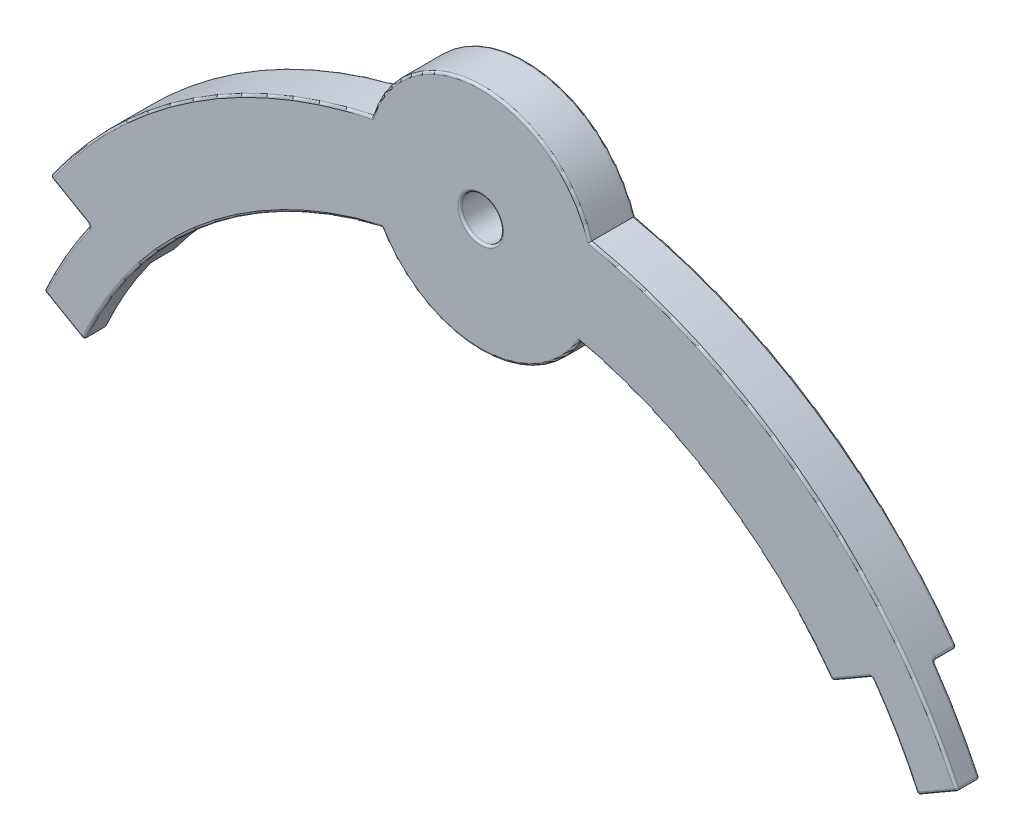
ISO-10303-21;
HEADER;
FILE_DESCRIPTION(('STEP AP214'),'2;1');
FILE_NAME('part.step','',(''),(''),'','','');
FILE_SCHEMA(('AUTOMOTIVE_DESIGN { 1 0 10303 214 1 1 1 1 }'));
ENDSEC;
DATA;
#1=APPLICATION_CONTEXT('core data for automotive mechanical design processes');
#2=APPLICATION_PROTOCOL_DEFINITION('international standard','automotive_design',2000,#1);
#3=PRODUCT_CONTEXT('',#1,'mechanical');
#4=PRODUCT('Part','Part','',(#3));
#5=PRODUCT_RELATED_PRODUCT_CATEGORY('part','',(#4));
#6=PRODUCT_DEFINITION_FORMATION('','',#4);
#7=PRODUCT_DEFINITION_CONTEXT('part definition',#1,'design');
#8=PRODUCT_DEFINITION('design','',#6,#7);
#9=PRODUCT_DEFINITION_SHAPE('','',#8);
#10=(LENGTH_UNIT() NAMED_UNIT(*) SI_UNIT(.MILLI.,.METRE.));
#11=(NAMED_UNIT(*) PLANE_ANGLE_UNIT() SI_UNIT($,.RADIAN.));
#12=(NAMED_UNIT(*) SI_UNIT($,.STERADIAN.) SOLID_ANGLE_UNIT());
#13=UNCERTAINTY_MEASURE_WITH_UNIT(LENGTH_MEASURE(1.E-05),#10,'distance_accuracy_value','');
#14=(GEOMETRIC_REPRESENTATION_CONTEXT(3) GLOBAL_UNCERTAINTY_ASSIGNED_CONTEXT((#13)) GLOBAL_UNIT_ASSIGNED_CONTEXT((#10,
#11,#12)) REPRESENTATION_CONTEXT('',''));
#15=CARTESIAN_POINT('',(0.,0.,0.));
#16=DIRECTION('',(0.,0.,1.));
#17=DIRECTION('',(1.,0.,0.));
#18=AXIS2_PLACEMENT_3D('',#15,#16,#17);
#19=CARTESIAN_POINT('',(0.,0.,5.));
#20=DIRECTION('',(0.,0.,1.));
#21=DIRECTION('',(1.,0.,0.));
#22=AXIS2_PLACEMENT_3D('',#19,#20,#21);
#23=PLANE('',#22);
#24=CARTESIAN_POINT('',(0.,105.,5.));
#25=DIRECTION('',(0.,0.,1.));
#26=DIRECTION('',(1.,0.,0.));
#27=AXIS2_PLACEMENT_3D('',#24,#25,#26);
#28=CIRCLE('',#27,5.);
#29=CARTESIAN_POINT('',(5.,105.,5.));
#30=VERTEX_POINT('',#29);
#31=EDGE_CURVE('E1014',#30,#30,#28,.F.);
#32=ORIENTED_EDGE('',*,*,#31,.T.);
#33=EDGE_LOOP('',(#32));
#34=FACE_BOUND('',#33,.T.);
#35=CARTESIAN_POINT('',(85.3749133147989,60.2608842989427,5.));
#36=DIRECTION('',(0.,0.,1.));
#37=DIRECTION('',(1.,0.,0.));
#38=AXIS2_PLACEMENT_3D('',#35,#36,#37);
#39=CIRCLE('',#38,1.);
#40=CARTESIAN_POINT('',(86.1918981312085,60.8375434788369,5.));
#41=VERTEX_POINT('',#40);
#42=CARTESIAN_POINT('',(84.8749133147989,61.1269097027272,5.));
#43=VERTEX_POINT('',#42);
#44=EDGE_CURVE('E40',#41,#43,#39,.T.);
#45=ORIENTED_EDGE('',*,*,#44,.F.);
#46=CARTESIAN_POINT('',(0.,0.,5.));
#47=DIRECTION('',(0.,0.,1.));
#48=DIRECTION('',(1.,0.,0.));
#49=AXIS2_PLACEMENT_3D('',#46,#47,#48);
#50=CIRCLE('',#49,105.5);
#51=CARTESIAN_POINT('',(95.7445053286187,44.3084608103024,5.));
#52=VERTEX_POINT('',#51);
#53=EDGE_CURVE('E1040',#41,#52,#50,.F.);
#54=ORIENTED_EDGE('',*,*,#53,.T.);
#55=DIRECTION('',(0.86602540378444,0.499999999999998,0.));
#56=VECTOR('',#55,1.);
#57=CARTESIAN_POINT('',(103.965674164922,49.0549548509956,5.));
#58=LINE('',#57,#56);
#59=CARTESIAN_POINT('',(103.568014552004,48.8253659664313,5.));
#60=VERTEX_POINT('',#59);
#61=EDGE_CURVE('E1024',#52,#60,#58,.T.);
#62=ORIENTED_EDGE('',*,*,#61,.T.);
#63=CARTESIAN_POINT('',(0.,0.,5.));
#64=DIRECTION('',(0.,0.,1.));
#65=DIRECTION('',(1.,0.,0.));
#66=AXIS2_PLACEMENT_3D('',#63,#64,#65);
#67=CIRCLE('',#66,114.5);
#68=CARTESIAN_POINT('',(23.4572994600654,112.071428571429,5.));
#69=VERTEX_POINT('',#68);
#70=EDGE_CURVE('E1016',#60,#69,#67,.T.);
#71=ORIENTED_EDGE('',*,*,#70,.T.);
#72=CARTESIAN_POINT('',(0.,105.,5.));
#73=DIRECTION('',(0.,0.,1.));
#74=DIRECTION('',(1.,0.,0.));
#75=AXIS2_PLACEMENT_3D('',#72,#73,#74);
#76=CIRCLE('',#75,24.5);
#77=CARTESIAN_POINT('',(-23.4572994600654,112.071428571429,5.));
#78=VERTEX_POINT('',#77);
#79=EDGE_CURVE('E1018',#69,#78,#76,.T.);
#80=ORIENTED_EDGE('',*,*,#79,.T.);
#81=CARTESIAN_POINT('',(0.,0.,5.));
#82=DIRECTION('',(0.,0.,1.));
#83=DIRECTION('',(1.,0.,0.));
#84=AXIS2_PLACEMENT_3D('',#81,#82,#83);
#85=CIRCLE('',#84,114.5);
#86=CARTESIAN_POINT('',(-93.4920882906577,66.1020379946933,5.));
#87=VERTEX_POINT('',#86);
#88=EDGE_CURVE('E1020',#78,#87,#85,.T.);
#89=ORIENTED_EDGE('',*,*,#88,.T.);
#90=DIRECTION('',(0.866025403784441,-0.499999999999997,0.));
#91=VECTOR('',#90,1.);
#92=CARTESIAN_POINT('',(-85.2693349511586,61.3546291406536,5.));
#93=LINE('',#92,#91);
#94=CARTESIAN_POINT('',(-85.7445053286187,61.6289688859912,5.));
#95=VERTEX_POINT('',#94);
#96=EDGE_CURVE('E1022',#87,#95,#93,.T.);
#97=ORIENTED_EDGE('',*,*,#96,.T.);
#98=CARTESIAN_POINT('',(-86.2445053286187,60.7629434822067,5.));
#99=DIRECTION('',(0.,0.,1.));
#100=DIRECTION('',(1.,0.,0.));
#101=AXIS2_PLACEMENT_3D('',#98,#99,#100);
#102=CIRCLE('',#101,1.);
#103=CARTESIAN_POINT('',(-85.4270218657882,60.1869914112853,5.));
#104=VERTEX_POINT('',#103);
#105=EDGE_CURVE('E1027',#104,#95,#102,.T.);
#106=ORIENTED_EDGE('',*,*,#105,.F.);
#107=CARTESIAN_POINT('',(0.,0.,5.));
#108=DIRECTION('',(0.,0.,1.));
#109=DIRECTION('',(1.,0.,0.));
#110=AXIS2_PLACEMENT_3D('',#107,#108,#109);
#111=CIRCLE('',#110,104.5);
#112=CARTESIAN_POINT('',(-94.8749133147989,43.8064016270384,5.));
#113=VERTEX_POINT('',#112);
#114=EDGE_CURVE('E1030',#104,#113,#111,.T.);
#115=ORIENTED_EDGE('',*,*,#114,.T.);
#116=DIRECTION('',(0.866025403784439,-0.499999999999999,0.));
#117=VECTOR('',#116,1.);
#118=CARTESIAN_POINT('',(-86.565340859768,39.0088677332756,5.));
#119=LINE('',#118,#117);
#120=CARTESIAN_POINT('',(-87.0452003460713,39.285914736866,5.));
#121=VERTEX_POINT('',#120);
#122=EDGE_CURVE('E772',#113,#121,#119,.T.);
#123=ORIENTED_EDGE('',*,*,#122,.T.);
#124=CARTESIAN_POINT('',(0.,0.,5.));
#125=DIRECTION('',(0.,0.,1.));
#126=DIRECTION('',(1.,0.,0.));
#127=AXIS2_PLACEMENT_3D('',#124,#125,#126);
#128=CIRCLE('',#127,95.5);
#129=CARTESIAN_POINT('',(-21.3999809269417,93.0714285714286,5.));
#130=VERTEX_POINT('',#129);
#131=EDGE_CURVE('E1033',#121,#130,#128,.F.);
#132=ORIENTED_EDGE('',*,*,#131,.T.);
#133=CARTESIAN_POINT('',(0.,105.,5.));
#134=DIRECTION('',(0.,0.,1.));
#135=DIRECTION('',(1.,0.,0.));
#136=AXIS2_PLACEMENT_3D('',#133,#134,#135);
#137=CIRCLE('',#136,24.5);
#138=CARTESIAN_POINT('',(21.3999809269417,93.0714285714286,5.));
#139=VERTEX_POINT('',#138);
#140=EDGE_CURVE('E1035',#130,#139,#137,.T.);
#141=ORIENTED_EDGE('',*,*,#140,.T.);
#142=CARTESIAN_POINT('',(0.,0.,5.));
#143=DIRECTION('',(0.,0.,1.));
#144=DIRECTION('',(1.,0.,0.));
#145=AXIS2_PLACEMENT_3D('',#142,#143,#144);
#146=CIRCLE('',#145,95.5);
#147=CARTESIAN_POINT('',(76.9540145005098,56.5537766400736,5.));
#148=VERTEX_POINT('',#147);
#149=EDGE_CURVE('E1037',#139,#148,#146,.F.);
#150=ORIENTED_EDGE('',*,*,#149,.T.);
#151=DIRECTION('',(0.866025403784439,0.499999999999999,0.));
#152=VECTOR('',#151,1.);
#153=CARTESIAN_POINT('',(85.2693349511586,61.3546291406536,5.));
#154=LINE('',#153,#152);
#155=EDGE_CURVE('E52',#148,#43,#154,.T.);
#156=ORIENTED_EDGE('',*,*,#155,.T.);
#157=EDGE_LOOP('',(#45,#54,#62,#71,#80,#89,#97,#106,#115,#123,#132,#141,#150,#156));
#158=FACE_BOUND('',#157,.T.);
#159=ADVANCED_FACE('F31',(#34,#158),#23,.T.);
#160=CARTESIAN_POINT('',(0.,0.,5.));
#161=DIRECTION('',(0.,0.,-1.));
#162=DIRECTION('',(-1.,0.,0.));
#163=AXIS2_PLACEMENT_3D('',#160,#161,#162);
#164=CYLINDRICAL_SURFACE('',#163,105.);
#165=CARTESIAN_POINT('',(0.,0.,4.5));
#166=DIRECTION('',(0.,0.,1.));
#167=DIRECTION('',(1.,0.,0.));
#168=AXIS2_PLACEMENT_3D('',#165,#166,#167);
#169=CIRCLE('',#168,105.);
#170=CARTESIAN_POINT('',(-95.3288602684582,44.0160016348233,4.5));
#171=VERTEX_POINT('',#170);
#172=CARTESIAN_POINT('',(-85.8357635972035,60.474967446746,4.5));
#173=VERTEX_POINT('',#172);
#174=EDGE_CURVE('E303',#171,#173,#169,.F.);
#175=ORIENTED_EDGE('',*,*,#174,.T.);
#176=DIRECTION('',(0.,0.,-1.));
#177=VECTOR('',#176,1.);
#178=CARTESIAN_POINT('',(-85.8357635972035,60.4749674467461,5.));
#179=LINE('',#178,#177);
#180=CARTESIAN_POINT('',(-85.8357635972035,60.474967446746,0.5));
#181=VERTEX_POINT('',#180);
#182=EDGE_CURVE('E299',#173,#181,#179,.T.);
#183=ORIENTED_EDGE('',*,*,#182,.T.);
#184=CARTESIAN_POINT('',(0.,0.,0.5));
#185=DIRECTION('',(0.,0.,-1.));
#186=DIRECTION('',(-1.,0.,0.));
#187=AXIS2_PLACEMENT_3D('',#184,#185,#186);
#188=CIRCLE('',#187,105.);
#189=CARTESIAN_POINT('',(-95.3288602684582,44.0160016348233,0.5));
#190=VERTEX_POINT('',#189);
#191=EDGE_CURVE('E293',#181,#190,#188,.F.);
#192=ORIENTED_EDGE('',*,*,#191,.T.);
#193=DIRECTION('',(0.,0.,-1.));
#194=VECTOR('',#193,1.);
#195=CARTESIAN_POINT('',(-95.3288602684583,44.0160016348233,5.));
#196=LINE('',#195,#194);
#197=EDGE_CURVE('E296',#190,#171,#196,.F.);
#198=ORIENTED_EDGE('',*,*,#197,.T.);
#199=EDGE_LOOP('',(#175,#183,#192,#198));
#200=FACE_BOUND('',#199,.T.);
#201=ADVANCED_FACE('F295',(#200),#164,.T.);
#202=CARTESIAN_POINT('',(-86.8153408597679,38.5758550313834,5.));
#203=DIRECTION('',(0.499999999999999,0.866025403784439,0.));
#204=DIRECTION('',(-0.866025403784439,0.499999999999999,0.));
#205=AXIS2_PLACEMENT_3D('',#202,#203,#204);
#206=PLANE('',#205);
#207=DIRECTION('',(0.866025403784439,-0.499999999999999,0.));
#208=VECTOR('',#207,1.);
#209=CARTESIAN_POINT('',(-95.5193349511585,43.6011083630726,4.5));
#210=LINE('',#209,#208);
#211=CARTESIAN_POINT('',(-87.2952003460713,38.8529020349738,4.5));
#212=VERTEX_POINT('',#211);
#213=CARTESIAN_POINT('',(-95.1249133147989,43.3733889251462,4.5));
#214=VERTEX_POINT('',#213);
#215=EDGE_CURVE('E773',#212,#214,#210,.F.);
#216=ORIENTED_EDGE('',*,*,#215,.T.);
#217=DIRECTION('',(0.,0.,-1.));
#218=VECTOR('',#217,1.);
#219=CARTESIAN_POINT('',(-95.1249133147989,43.3733889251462,5.));
#220=LINE('',#219,#218);
#221=CARTESIAN_POINT('',(-95.1249133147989,43.3733889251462,0.5));
#222=VERTEX_POINT('',#221);
#223=EDGE_CURVE('E1069',#214,#222,#220,.T.);
#224=ORIENTED_EDGE('',*,*,#223,.T.);
#225=DIRECTION('',(-0.866025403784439,0.499999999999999,0.));
#226=VECTOR('',#225,1.);
#227=CARTESIAN_POINT('',(-86.815340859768,38.5758550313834,0.5));
#228=LINE('',#227,#226);
#229=CARTESIAN_POINT('',(-87.2952003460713,38.8529020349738,0.5));
#230=VERTEX_POINT('',#229);
#231=EDGE_CURVE('E1066',#222,#230,#228,.F.);
#232=ORIENTED_EDGE('',*,*,#231,.T.);
#233=DIRECTION('',(0.,0.,-1.));
#234=VECTOR('',#233,1.);
#235=CARTESIAN_POINT('',(-87.2952003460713,38.8529020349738,5.));
#236=LINE('',#235,#234);
#237=EDGE_CURVE('E1058',#230,#212,#236,.F.);
#238=ORIENTED_EDGE('',*,*,#237,.T.);
#239=EDGE_LOOP('',(#216,#224,#232,#238));
#240=FACE_BOUND('',#239,.T.);
#241=ADVANCED_FACE('F629',(#240),#206,.F.);
#242=CARTESIAN_POINT('',(0.,0.,5.));
#243=DIRECTION('',(0.,0.,-1.));
#244=DIRECTION('',(-1.,0.,0.));
#245=AXIS2_PLACEMENT_3D('',#242,#243,#244);
#246=CYLINDRICAL_SURFACE('',#245,105.);
#247=CARTESIAN_POINT('',(0.,0.,0.5));
#248=DIRECTION('',(0.,0.,-1.));
#249=DIRECTION('',(-1.,0.,0.));
#250=AXIS2_PLACEMENT_3D('',#247,#248,#249);
#251=CIRCLE('',#250,105.);
#252=CARTESIAN_POINT('',(85.7834057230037,60.5492138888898,0.5));
#253=VERTEX_POINT('',#252);
#254=CARTESIAN_POINT('',(95.290739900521,44.0984681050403,0.5));
#255=VERTEX_POINT('',#254);
#256=EDGE_CURVE('E1084',#253,#255,#251,.T.);
#257=ORIENTED_EDGE('',*,*,#256,.T.);
#258=DIRECTION('',(0.,0.,-1.));
#259=VECTOR('',#258,1.);
#260=CARTESIAN_POINT('',(95.290739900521,44.0984681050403,5.));
#261=LINE('',#260,#259);
#262=CARTESIAN_POINT('',(95.290739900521,44.0984681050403,4.5));
#263=VERTEX_POINT('',#262);
#264=EDGE_CURVE('E1086',#255,#263,#261,.F.);
#265=ORIENTED_EDGE('',*,*,#264,.T.);
#266=CARTESIAN_POINT('',(0.,0.,4.5));
#267=DIRECTION('',(0.,0.,1.));
#268=DIRECTION('',(1.,0.,0.));
#269=AXIS2_PLACEMENT_3D('',#266,#267,#268);
#270=CIRCLE('',#269,105.);
#271=CARTESIAN_POINT('',(85.7834057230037,60.5492138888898,4.5));
#272=VERTEX_POINT('',#271);
#273=EDGE_CURVE('E1080',#263,#272,#270,.T.);
#274=ORIENTED_EDGE('',*,*,#273,.T.);
#275=DIRECTION('',(0.,0.,-1.));
#276=VECTOR('',#275,1.);
#277=CARTESIAN_POINT('',(85.7834057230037,60.5492138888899,5.));
#278=LINE('',#277,#276);
#279=EDGE_CURVE('E1082',#272,#253,#278,.T.);
#280=ORIENTED_EDGE('',*,*,#279,.T.);
#281=EDGE_LOOP('',(#257,#265,#274,#280));
#282=FACE_BOUND('',#281,.T.);
#283=ADVANCED_FACE('F645',(#282),#246,.F.);
#284=CARTESIAN_POINT('',(95.5193349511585,43.6011083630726,5.));
#285=DIRECTION('',(-0.499999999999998,0.86602540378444,0.));
#286=DIRECTION('',(-0.86602540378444,-0.499999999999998,0.));
#287=AXIS2_PLACEMENT_3D('',#284,#285,#286);
#288=PLANE('',#287);
#289=DIRECTION('',(0.,0.,-1.));
#290=VECTOR('',#289,1.);
#291=CARTESIAN_POINT('',(95.9945053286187,43.8754481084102,5.));
#292=LINE('',#291,#290);
#293=CARTESIAN_POINT('',(95.9945053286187,43.8754481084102,4.5));
#294=VERTEX_POINT('',#293);
#295=CARTESIAN_POINT('',(95.9945053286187,43.8754481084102,0.5));
#296=VERTEX_POINT('',#295);
#297=EDGE_CURVE('E1075',#294,#296,#292,.T.);
#298=ORIENTED_EDGE('',*,*,#297,.T.);
#299=DIRECTION('',(-0.86602540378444,-0.499999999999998,0.));
#300=VECTOR('',#299,1.);
#301=CARTESIAN_POINT('',(104.215674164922,48.6219421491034,0.5));
#302=LINE('',#301,#300);
#303=CARTESIAN_POINT('',(103.818014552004,48.392353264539,0.5));
#304=VERTEX_POINT('',#303);
#305=EDGE_CURVE('E1078',#296,#304,#302,.F.);
#306=ORIENTED_EDGE('',*,*,#305,.T.);
#307=DIRECTION('',(0.,0.,-1.));
#308=VECTOR('',#307,1.);
#309=CARTESIAN_POINT('',(103.818014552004,48.392353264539,5.));
#310=LINE('',#309,#308);
#311=CARTESIAN_POINT('',(103.818014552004,48.392353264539,4.5));
#312=VERTEX_POINT('',#311);
#313=EDGE_CURVE('E1073',#304,#312,#310,.F.);
#314=ORIENTED_EDGE('',*,*,#313,.T.);
#315=DIRECTION('',(0.86602540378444,0.499999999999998,0.));
#316=VECTOR('',#315,1.);
#317=CARTESIAN_POINT('',(95.5193349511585,43.6011083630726,4.5));
#318=LINE('',#317,#316);
#319=EDGE_CURVE('E1071',#312,#294,#318,.F.);
#320=ORIENTED_EDGE('',*,*,#319,.T.);
#321=EDGE_LOOP('',(#298,#306,#314,#320));
#322=FACE_BOUND('',#321,.T.);
#323=ADVANCED_FACE('F641',(#322),#288,.F.);
#324=CARTESIAN_POINT('',(0.,0.,5.));
#325=DIRECTION('',(0.,0.,-1.));
#326=DIRECTION('',(-1.,0.,0.));
#327=AXIS2_PLACEMENT_3D('',#324,#325,#326);
#328=CYLINDRICAL_SURFACE('',#327,115.);
#329=DIRECTION('',(0.,0.,-1.));
#330=VECTOR('',#329,1.);
#331=CARTESIAN_POINT('',(93.90035068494,66.3906931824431,5.));
#332=LINE('',#331,#330);
#333=CARTESIAN_POINT('',(93.90035068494,66.3906931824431,-0.5));
#334=VERTEX_POINT('',#333);
#335=CARTESIAN_POINT('',(93.90035068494,66.3906931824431,-4.5));
#336=VERTEX_POINT('',#335);
#337=EDGE_CURVE('E857',#334,#336,#332,.T.);
#338=ORIENTED_EDGE('',*,*,#337,.T.);
#339=CARTESIAN_POINT('',(0.,0.,-4.5));
#340=DIRECTION('',(0.,0.,1.));
#341=DIRECTION('',(1.,0.,0.));
#342=AXIS2_PLACEMENT_3D('',#339,#340,#341);
#343=CIRCLE('',#342,115.);
#344=CARTESIAN_POINT('',(23.8484800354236,112.5,-4.5));
#345=VERTEX_POINT('',#344);
#346=EDGE_CURVE('E861',#336,#345,#343,.T.);
#347=ORIENTED_EDGE('',*,*,#346,.T.);
#348=DIRECTION('',(0.,0.,-1.));
#349=VECTOR('',#348,1.);
#350=CARTESIAN_POINT('',(23.8484800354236,112.5,5.));
#351=LINE('',#350,#349);
#352=CARTESIAN_POINT('',(23.8484800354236,112.5,4.5));
#353=VERTEX_POINT('',#352);
#354=EDGE_CURVE('E315',#353,#345,#351,.T.);
#355=ORIENTED_EDGE('',*,*,#354,.F.);
#356=CARTESIAN_POINT('',(0.,0.,4.5));
#357=DIRECTION('',(0.,0.,1.));
#358=DIRECTION('',(1.,0.,0.));
#359=AXIS2_PLACEMENT_3D('',#356,#357,#358);
#360=CIRCLE('',#359,115.);
#361=CARTESIAN_POINT('',(104.020276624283,49.0385771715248,4.5));
#362=VERTEX_POINT('',#361);
#363=EDGE_CURVE('E1089',#353,#362,#360,.F.);
#364=ORIENTED_EDGE('',*,*,#363,.T.);
#365=DIRECTION('',(0.,0.,-1.));
#366=VECTOR('',#365,1.);
#367=CARTESIAN_POINT('',(104.020276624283,49.0385771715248,5.));
#368=LINE('',#367,#366);
#369=CARTESIAN_POINT('',(104.020276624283,49.0385771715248,0.5));
#370=VERTEX_POINT('',#369);
#371=EDGE_CURVE('E1090',#362,#370,#368,.T.);
#372=ORIENTED_EDGE('',*,*,#371,.T.);
#373=CARTESIAN_POINT('',(0.,0.,0.5));
#374=DIRECTION('',(0.,0.,-1.));
#375=DIRECTION('',(-1.,0.,0.));
#376=AXIS2_PLACEMENT_3D('',#373,#374,#375);
#377=CIRCLE('',#376,115.);
#378=CARTESIAN_POINT('',(94.4787919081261,65.5649134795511,0.5));
#379=VERTEX_POINT('',#378);
#380=EDGE_CURVE('E858',#370,#379,#377,.F.);
#381=ORIENTED_EDGE('',*,*,#380,.T.);
#382=CARTESIAN_POINT('',(94.1745737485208,65.14961384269,-0.0283836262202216));
#383=CARTESIAN_POINT('',(94.5776675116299,65.4224029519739,-0.0161666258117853));
#384=CARTESIAN_POINT('',(94.6692121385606,65.2896643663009,0.443232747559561));
#385=CARTESIAN_POINT('',(94.1575565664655,65.1705360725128,-0.0189823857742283));
#386=CARTESIAN_POINT('',(94.5614134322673,65.4458386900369,-0.00833270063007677));
#387=CARTESIAN_POINT('',(94.6387486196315,65.3338389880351,0.462035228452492));
#388=CARTESIAN_POINT('',(94.1399952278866,65.1920635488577,-0.0118855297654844));
#389=CARTESIAN_POINT('',(94.544882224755,65.4696678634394,-0.00313283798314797));
#390=CARTESIAN_POINT('',(94.6073387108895,65.3793140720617,0.47622894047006));
#391=CARTESIAN_POINT('',(94.1043058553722,65.2356846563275,-0.0023969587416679));
#392=CARTESIAN_POINT('',(94.5117468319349,65.5174245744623,0.00220784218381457));
#393=CARTESIAN_POINT('',(94.5435612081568,65.4715057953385,0.4952060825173));
#394=CARTESIAN_POINT('',(94.0861782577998,65.2577778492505,-1.70728023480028E-06));
#395=CARTESIAN_POINT('',(94.4951370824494,65.5413601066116,0.0023310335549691));
#396=CARTESIAN_POINT('',(94.5111943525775,65.5182214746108,0.499996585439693));
#397=CARTESIAN_POINT('',(94.0498473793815,65.3019236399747,1.70760609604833E-06));
#398=CARTESIAN_POINT('',(94.4623669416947,65.5885818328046,-0.00234241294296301));
#399=CARTESIAN_POINT('',(94.4463832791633,65.6116143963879,0.500003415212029));
#400=CARTESIAN_POINT('',(94.0316440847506,65.3239762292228,-0.00239104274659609));
#401=CARTESIAN_POINT('',(94.4462054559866,65.6118695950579,-0.00716359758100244));
#402=CARTESIAN_POINT('',(94.4139390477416,65.6582916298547,0.495217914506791));
#403=CARTESIAN_POINT('',(93.9956888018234,65.3674086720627,-0.0118890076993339));
#404=CARTESIAN_POINT('',(94.414816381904,65.6571040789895,-0.0213691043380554));
#405=CARTESIAN_POINT('',(94.3499097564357,65.7502673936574,0.476221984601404));
#406=CARTESIAN_POINT('',(93.9779367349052,65.3887886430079,-0.0189933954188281));
#407=CARTESIAN_POINT('',(94.3995921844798,65.6790459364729,-0.030775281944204));
#408=CARTESIAN_POINT('',(94.3183245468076,65.7955661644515,0.462013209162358));
#409=CARTESIAN_POINT('',(93.9434021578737,65.4302675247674,-0.0377119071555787));
#410=CARTESIAN_POINT('',(94.3704948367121,65.7209930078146,-0.0536628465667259));
#411=CARTESIAN_POINT('',(94.2569285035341,65.8834903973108,0.424576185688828));
#412=CARTESIAN_POINT('',(93.9266191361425,65.4503671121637,-0.0493236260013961));
#413=CARTESIAN_POINT('',(94.3566289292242,65.7409878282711,-0.0671608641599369));
#414=CARTESIAN_POINT('',(94.2271167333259,65.9261172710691,0.401352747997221));
#415=CARTESIAN_POINT('',(93.8944819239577,65.4887598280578,-0.0767507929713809));
#416=CARTESIAN_POINT('',(94.3305481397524,65.7786115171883,-0.0976723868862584));
#417=CARTESIAN_POINT('',(94.1700726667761,66.0075745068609,0.346498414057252));
#418=CARTESIAN_POINT('',(93.8791296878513,65.5070504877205,-0.0925718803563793));
#419=CARTESIAN_POINT('',(94.3183471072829,65.7962205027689,-0.114702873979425));
#420=CARTESIAN_POINT('',(94.1428438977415,66.0463996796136,0.314856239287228));
#421=CARTESIAN_POINT('',(93.8503654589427,65.5412461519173,-0.127931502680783));
#422=CARTESIAN_POINT('',(94.2958783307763,65.8286647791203,-0.15159761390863));
#423=CARTESIAN_POINT('',(94.0918597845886,66.1190130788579,0.244136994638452));
#424=CARTESIAN_POINT('',(93.8369497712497,65.5571557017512,-0.147462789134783));
#425=CARTESIAN_POINT('',(94.2856203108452,65.8434860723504,-0.171460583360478));
#426=CARTESIAN_POINT('',(94.0680978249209,66.1528109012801,0.205074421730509));
#427=CARTESIAN_POINT('',(93.8124286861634,65.5861833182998,-0.18971170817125));
#428=CARTESIAN_POINT('',(94.2671595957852,65.8701740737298,-0.213409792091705));
#429=CARTESIAN_POINT('',(94.0246884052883,66.2144953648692,0.120576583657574));
#430=CARTESIAN_POINT('',(93.8013232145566,65.5993014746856,-0.212429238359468));
#431=CARTESIAN_POINT('',(94.2589706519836,65.8820209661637,-0.235491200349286));
#432=CARTESIAN_POINT('',(94.0050408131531,66.2423821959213,0.0751415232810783));
#433=CARTESIAN_POINT('',(93.781790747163,65.6223427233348,-0.260337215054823));
#434=CARTESIAN_POINT('',(94.244748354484,65.9026073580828,-0.281211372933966));
#435=CARTESIAN_POINT('',(93.9704978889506,66.2913752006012,-0.0206744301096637));
#436=CARTESIAN_POINT('',(93.7733561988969,65.6322748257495,-0.285520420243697));
#437=CARTESIAN_POINT('',(94.2387212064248,65.9113378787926,-0.304832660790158));
#438=CARTESIAN_POINT('',(93.9555891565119,66.3125004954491,-0.0710408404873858));
#439=CARTESIAN_POINT('',(93.7593927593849,65.6487029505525,-0.337661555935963));
#440=CARTESIAN_POINT('',(94.2288276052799,65.9256750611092,-0.353116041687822));
#441=CARTESIAN_POINT('',(93.9309139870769,66.3474480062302,-0.175323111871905));
#442=CARTESIAN_POINT('',(93.7538598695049,65.6552037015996,-0.364616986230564));
#443=CARTESIAN_POINT('',(94.2249676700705,65.931272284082,-0.377756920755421));
#444=CARTESIAN_POINT('',(93.9211404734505,66.3612802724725,-0.229233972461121));
#445=CARTESIAN_POINT('',(93.7458676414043,65.6645903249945,-0.419475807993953));
#446=CARTESIAN_POINT('',(94.2194107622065,65.939331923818,-0.427550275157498));
#447=CARTESIAN_POINT('',(93.9070242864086,66.3812544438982,-0.338951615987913));
#448=CARTESIAN_POINT('',(93.7433985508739,65.6674876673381,-0.447375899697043));
#449=CARTESIAN_POINT('',(94.2177125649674,65.9417961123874,-0.452676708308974));
#450=CARTESIAN_POINT('',(93.9026643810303,66.387420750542,-0.394751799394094));
#451=CARTESIAN_POINT('',(93.741576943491,65.6696253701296,-0.503417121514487));
#452=CARTESIAN_POINT('',(94.2164574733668,65.9436172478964,-0.503084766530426));
#453=CARTESIAN_POINT('',(93.899447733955,66.391970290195,-0.506834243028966));
#454=CARTESIAN_POINT('',(93.7422250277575,65.6688650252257,-0.531558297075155));
#455=CARTESIAN_POINT('',(94.2169023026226,65.9429716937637,-0.528340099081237));
#456=CARTESIAN_POINT('',(93.9005920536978,66.3903520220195,-0.563116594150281));
#457=CARTESIAN_POINT('',(93.7466186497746,65.6637080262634,-0.587203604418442));
#458=CARTESIAN_POINT('',(94.2199358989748,65.938570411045,-0.578515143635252));
#459=CARTESIAN_POINT('',(93.9083508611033,66.3793770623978,-0.674407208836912));
#460=CARTESIAN_POINT('',(93.7503566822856,65.6593201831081,-0.614709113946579));
#461=CARTESIAN_POINT('',(94.2225163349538,65.9348267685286,-0.603409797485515));
#462=CARTESIAN_POINT('',(93.9149520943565,66.3700391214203,-0.729418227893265));
#463=CARTESIAN_POINT('',(93.7607895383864,65.6470589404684,-0.668402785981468));
#464=CARTESIAN_POINT('',(94.2298247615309,65.9242302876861,-0.652475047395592));
#465=CARTESIAN_POINT('',(93.9333825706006,66.3439509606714,-0.836805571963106));
#466=CARTESIAN_POINT('',(93.7674864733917,65.639183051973,-0.69458999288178));
#467=CARTESIAN_POINT('',(94.2345470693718,65.9173856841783,-0.676622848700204));
#468=CARTESIAN_POINT('',(93.945215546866,66.3271954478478,-0.889179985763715));
#469=CARTESIAN_POINT('',(93.7755945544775,65.6296361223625,-0.719722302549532));
#470=CARTESIAN_POINT('',(94.2403462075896,65.9089851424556,-0.700206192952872));
#471=CARTESIAN_POINT('',(93.9595469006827,66.3068891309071,-0.939444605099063));
#472=(BOUNDED_SURFACE() B_SPLINE_SURFACE(3,2,((#382,#383,#384),(#385,#386,#387),(#388,#389,
#390),(#391,#392,#393),(#394,#395,#396),(#397,#398,#399),(#400,#401,#402),(#403,#404,#405),
(#406,#407,#408),(#409,#410,#411),(#412,#413,#414),(#415,#416,#417),(#418,#419,#420),(#421,#422,
#423),(#424,#425,#426),(#427,#428,#429),(#430,#431,#432),(#433,#434,#435),(#436,#437,#438),
(#439,#440,#441),(#442,#443,#444),(#445,#446,#447),(#448,#449,#450),(#451,#452,#453),(#454,#455,
#456),(#457,#458,#459),(#460,#461,#462),(#463,#464,#465),(#466,#467,#468),(#469,#470,#471)),
.UNSPECIFIED.,.F.,.F.,.F.) B_SPLINE_SURFACE_WITH_KNOTS((4,2,2,2,2,2,2,2,2,2,2,2,2,2,4),(3,3),
(0.,0.169688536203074,0.3392493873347,0.50884260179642,0.67840606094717,0.847879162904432,
1.0175804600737,1.18695356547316,1.35632122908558,1.52520561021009,1.69385664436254,
1.86196946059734,2.03011469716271,2.19785271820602,2.36571062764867),(0.,1.),
.UNSPECIFIED.) GEOMETRIC_REPRESENTATION_ITEM() RATIONAL_B_SPLINE_SURFACE(((1.,0.716447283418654,
1.),(1.,0.71501454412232,1.),(1.,0.713506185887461,1.),(1.,0.710379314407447,1.),(1.,
0.708760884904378,1.),(1.,0.70545236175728,1.),(1.,0.703762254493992,1.),(1.,0.70036087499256,
1.),(1.,0.69864960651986,1.),(1.,0.695262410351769,1.),(1.,0.693586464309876,1.),(1.,
0.690327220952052,1.),(1.,0.688744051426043,1.),(1.,0.685738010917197,1.),(1.,0.68431483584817,
1.),(1.,0.681685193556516,1.),(1.,0.680478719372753,1.),(1.,0.678339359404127,1.),(1.,
0.677405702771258,1.),(1.,0.675851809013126,1.),(1.,0.675231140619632,1.),(1.,0.674332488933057,
1.),(1.,0.674053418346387,1.),(1.,0.673847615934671,1.),(1.,0.673920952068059,1.),(1.,
0.674416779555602,1.),(1.,0.674838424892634,1.),(1.,0.676006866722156,1.),(1.,0.676753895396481,
1.),(1.,0.67765183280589,1.))) REPRESENTATION_ITEM('') SURFACE());
#473=CARTESIAN_POINT('',(93.9595469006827,66.3068891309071,-0.939444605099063));
#474=CARTESIAN_POINT('',(93.945215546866,66.3271954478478,-0.889179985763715));
#475=CARTESIAN_POINT('',(93.9333825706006,66.3439509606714,-0.836805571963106));
#476=CARTESIAN_POINT('',(93.9149520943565,66.3700391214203,-0.729418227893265));
#477=CARTESIAN_POINT('',(93.9083508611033,66.3793770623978,-0.674407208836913));
#478=CARTESIAN_POINT('',(93.9005920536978,66.3903520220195,-0.563116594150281));
#479=CARTESIAN_POINT('',(93.899447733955,66.391970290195,-0.506834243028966));
#480=CARTESIAN_POINT('',(93.9026643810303,66.387420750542,-0.394751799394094));
#481=CARTESIAN_POINT('',(93.9070242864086,66.3812544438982,-0.338951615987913));
#482=CARTESIAN_POINT('',(93.9211404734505,66.3612802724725,-0.229233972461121));
#483=CARTESIAN_POINT('',(93.9309139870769,66.3474480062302,-0.175323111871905));
#484=CARTESIAN_POINT('',(93.9555891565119,66.3125004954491,-0.0710408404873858));
#485=CARTESIAN_POINT('',(93.9704978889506,66.2913752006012,-0.0206744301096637));
#486=CARTESIAN_POINT('',(94.0050408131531,66.2423821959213,0.0751415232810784));
#487=CARTESIAN_POINT('',(94.0246884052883,66.2144953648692,0.120576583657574));
#488=CARTESIAN_POINT('',(94.0680978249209,66.1528109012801,0.205074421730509));
#489=CARTESIAN_POINT('',(94.0918597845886,66.1190130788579,0.244136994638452));
#490=CARTESIAN_POINT('',(94.1428438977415,66.0463996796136,0.314856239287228));
#491=CARTESIAN_POINT('',(94.1700726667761,66.0075745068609,0.346498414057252));
#492=CARTESIAN_POINT('',(94.2271167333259,65.9261172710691,0.401352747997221));
#493=CARTESIAN_POINT('',(94.2569285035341,65.8834903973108,0.424576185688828));
#494=CARTESIAN_POINT('',(94.3183245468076,65.7955661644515,0.462013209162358));
#495=CARTESIAN_POINT('',(94.3499097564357,65.7502673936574,0.476221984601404));
#496=CARTESIAN_POINT('',(94.4139390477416,65.6582916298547,0.495217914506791));
#497=CARTESIAN_POINT('',(94.4463832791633,65.6116143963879,0.500003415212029));
#498=CARTESIAN_POINT('',(94.5111943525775,65.5182214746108,0.499996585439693));
#499=CARTESIAN_POINT('',(94.5435612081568,65.4715057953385,0.4952060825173));
#500=CARTESIAN_POINT('',(94.6073387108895,65.3793140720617,0.47622894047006));
#501=CARTESIAN_POINT('',(94.6387486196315,65.3338389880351,0.462035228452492));
#502=CARTESIAN_POINT('',(94.6692121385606,65.2896643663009,0.443232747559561));
#503=B_SPLINE_CURVE_WITH_KNOTS('',3,(#473,#474,#475,#476,#477,#478,#479,#480,#481,#482,#483,
#484,#485,#486,#487,#488,#489,#490,#491,#492,#493,#494,#495,#496,#497,#498,#499,#500,#501,#502),
.UNSPECIFIED.,.F.,.F.,(4,2,2,2,2,2,2,2,2,2,2,2,2,2,4),(0.,0.167857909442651,0.335595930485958,
0.503741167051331,0.671853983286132,0.840505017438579,1.0093893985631,1.17875706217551,
1.34813016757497,1.51783146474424,1.6873045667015,1.85686802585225,2.02646124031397,
2.1960220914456,2.36571062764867),.UNSPECIFIED.);
#504=EDGE_CURVE('E850',#334,#379,#503,.T.);
#505=ORIENTED_EDGE('',*,*,#504,.F.);
#506=EDGE_LOOP('',(#338,#347,#355,#364,#372,#381,#505));
#507=FACE_BOUND('',#506,.T.);
#508=ADVANCED_FACE('F644',(#507),#328,.T.);
#509=CARTESIAN_POINT('',(0.,105.,5.));
#510=DIRECTION('',(0.,0.,-1.));
#511=DIRECTION('',(-1.,0.,0.));
#512=AXIS2_PLACEMENT_3D('',#509,#510,#511);
#513=CYLINDRICAL_SURFACE('',#512,25.);
#514=ORIENTED_EDGE('',*,*,#354,.T.);
#515=CARTESIAN_POINT('',(0.,105.,-4.5));
#516=DIRECTION('',(0.,0.,1.));
#517=DIRECTION('',(1.,0.,0.));
#518=AXIS2_PLACEMENT_3D('',#515,#516,#517);
#519=CIRCLE('',#518,25.);
#520=CARTESIAN_POINT('',(-23.8484800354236,112.5,-4.5));
#521=VERTEX_POINT('',#520);
#522=EDGE_CURVE('E1007',#345,#521,#519,.T.);
#523=ORIENTED_EDGE('',*,*,#522,.T.);
#524=DIRECTION('',(0.,0.,-1.));
#525=VECTOR('',#524,1.);
#526=CARTESIAN_POINT('',(-23.8484800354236,112.5,5.));
#527=LINE('',#526,#525);
#528=CARTESIAN_POINT('',(-23.8484800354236,112.5,4.5));
#529=VERTEX_POINT('',#528);
#530=EDGE_CURVE('E1349',#529,#521,#527,.T.);
#531=ORIENTED_EDGE('',*,*,#530,.F.);
#532=CARTESIAN_POINT('',(0.,105.,4.5));
#533=DIRECTION('',(0.,0.,1.));
#534=DIRECTION('',(1.,0.,0.));
#535=AXIS2_PLACEMENT_3D('',#532,#533,#534);
#536=CIRCLE('',#535,25.);
#537=EDGE_CURVE('E1005',#529,#353,#536,.F.);
#538=ORIENTED_EDGE('',*,*,#537,.T.);
#539=EDGE_LOOP('',(#514,#523,#531,#538));
#540=FACE_BOUND('',#539,.T.);
#541=ADVANCED_FACE('F841',(#540),#513,.T.);
#542=CARTESIAN_POINT('',(0.,0.,5.));
#543=DIRECTION('',(0.,0.,-1.));
#544=DIRECTION('',(-1.,0.,0.));
#545=AXIS2_PLACEMENT_3D('',#542,#543,#544);
#546=CYLINDRICAL_SURFACE('',#545,115.);
#547=ORIENTED_EDGE('',*,*,#530,.T.);
#548=CARTESIAN_POINT('',(0.,0.,-4.5));
#549=DIRECTION('',(0.,0.,1.));
#550=DIRECTION('',(1.,0.,0.));
#551=AXIS2_PLACEMENT_3D('',#548,#549,#550);
#552=CIRCLE('',#551,115.);
#553=CARTESIAN_POINT('',(-93.90035068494,66.390693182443,-4.5));
#554=VERTEX_POINT('',#553);
#555=EDGE_CURVE('E1012',#521,#554,#552,.T.);
#556=ORIENTED_EDGE('',*,*,#555,.T.);
#557=DIRECTION('',(0.,0.,-1.));
#558=VECTOR('',#557,1.);
#559=CARTESIAN_POINT('',(-93.90035068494,66.390693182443,5.));
#560=LINE('',#559,#558);
#561=CARTESIAN_POINT('',(-93.90035068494,66.390693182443,4.5));
#562=VERTEX_POINT('',#561);
#563=EDGE_CURVE('E800',#554,#562,#560,.F.);
#564=ORIENTED_EDGE('',*,*,#563,.T.);
#565=CARTESIAN_POINT('',(0.,0.,4.5));
#566=DIRECTION('',(0.,0.,1.));
#567=DIRECTION('',(1.,0.,0.));
#568=AXIS2_PLACEMENT_3D('',#565,#566,#567);
#569=CIRCLE('',#568,115.);
#570=EDGE_CURVE('E1010',#562,#529,#569,.F.);
#571=ORIENTED_EDGE('',*,*,#570,.T.);
#572=EDGE_LOOP('',(#547,#556,#564,#571));
#573=FACE_BOUND('',#572,.T.);
#574=ADVANCED_FACE('F836',(#573),#546,.T.);
#575=CARTESIAN_POINT('',(-85.5193349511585,60.9216164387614,5.));
#576=DIRECTION('',(0.499999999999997,0.86602540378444,0.));
#577=DIRECTION('',(-0.866025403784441,0.499999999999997,0.));
#578=AXIS2_PLACEMENT_3D('',#575,#576,#577);
#579=PLANE('',#578);
#580=DIRECTION('',(0.,0.,-1.));
#581=VECTOR('',#580,1.);
#582=CARTESIAN_POINT('',(-77.2040145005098,56.1207639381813,5.));
#583=LINE('',#582,#581);
#584=CARTESIAN_POINT('',(-77.2040145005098,56.1207639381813,-4.5));
#585=VERTEX_POINT('',#584);
#586=CARTESIAN_POINT('',(-77.2040145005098,56.1207639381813,-0.5));
#587=VERTEX_POINT('',#586);
#588=EDGE_CURVE('E811',#585,#587,#583,.F.);
#589=ORIENTED_EDGE('',*,*,#588,.T.);
#590=DIRECTION('',(0.866025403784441,-0.499999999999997,0.));
#591=VECTOR('',#590,1.);
#592=CARTESIAN_POINT('',(-85.5193349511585,60.9216164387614,-0.5));
#593=LINE('',#592,#591);
#594=CARTESIAN_POINT('',(-85.124913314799,60.693897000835,-0.5));
#595=VERTEX_POINT('',#594);
#596=EDGE_CURVE('E828',#587,#595,#593,.F.);
#597=ORIENTED_EDGE('',*,*,#596,.T.);
#598=CARTESIAN_POINT('',(-84.8339077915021,60.5258848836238,-0.442350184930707));
#599=CARTESIAN_POINT('',(-84.9739290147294,60.6067261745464,0.0148712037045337));
#600=CARTESIAN_POINT('',(-85.2205726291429,60.1893955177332,0.0288249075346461));
#601=CARTESIAN_POINT('',(-84.8805373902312,60.5528064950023,-0.461441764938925));
#602=CARTESIAN_POINT('',(-84.9988704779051,60.6211261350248,0.0071920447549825));
#603=CARTESIAN_POINT('',(-85.2453085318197,60.2008442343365,0.0192791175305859));
#604=CARTESIAN_POINT('',(-84.9285853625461,60.5805470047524,-0.475856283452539));
#605=CARTESIAN_POINT('',(-85.0241608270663,60.635727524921,0.00219523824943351));
#606=CARTESIAN_POINT('',(-85.2707943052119,60.2126444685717,0.0120718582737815));
#607=CARTESIAN_POINT('',(-85.026060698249,60.6368244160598,-0.495129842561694));
#608=CARTESIAN_POINT('',(-85.0747526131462,60.664936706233,-0.00269846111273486));
#609=CARTESIAN_POINT('',(-85.322492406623,60.2365902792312,0.00243507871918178));
#610=CARTESIAN_POINT('',(-85.0754869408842,60.6653606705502,-0.499996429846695));
#611=CARTESIAN_POINT('',(-85.1000585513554,60.6795470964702,-0.00257405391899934));
#612=CARTESIAN_POINT('',(-85.3487041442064,60.2487355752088,1.78507665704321E-06));
#613=CARTESIAN_POINT('',(-85.1739644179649,60.7222166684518,-0.500003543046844));
#614=CARTESIAN_POINT('',(-85.1497066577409,60.7082114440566,0.00256769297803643));
#615=CARTESIAN_POINT('',(-85.4009234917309,60.2729407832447,-1.77152342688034E-06));
#616=CARTESIAN_POINT('',(-85.2230156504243,60.7505364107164,-0.495217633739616));
#617=CARTESIAN_POINT('',(-85.1740522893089,60.722267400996,0.00757306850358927));
#618=CARTESIAN_POINT('',(-85.4269311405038,60.2850006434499,0.00239118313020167));
#619=CARTESIAN_POINT('',(-85.3197185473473,60.8063678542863,-0.476216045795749));
#620=CARTESIAN_POINT('',(-85.2213018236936,60.7495469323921,0.0220481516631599));
#621=CARTESIAN_POINT('',(-85.4781994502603,60.3087825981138,0.0118919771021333));
#622=CARTESIAN_POINT('',(-85.3673704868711,60.8338797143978,-0.462002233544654));
#623=CARTESIAN_POINT('',(-85.2441957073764,60.7627647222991,0.0315390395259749));
#624=CARTESIAN_POINT('',(-85.5034602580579,60.3205047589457,0.0189988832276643));
#625=CARTESIAN_POINT('',(-85.4599086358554,60.8873066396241,-0.42454511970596));
#626=CARTESIAN_POINT('',(-85.2879575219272,60.7880306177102,0.0545055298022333));
#627=CARTESIAN_POINT('',(-85.5525113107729,60.343274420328,0.0377274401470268));
#628=CARTESIAN_POINT('',(-85.5047961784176,60.9132224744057,-0.4013062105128));
#629=CARTESIAN_POINT('',(-85.3088104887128,60.8000700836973,0.067995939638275));
#630=CARTESIAN_POINT('',(-85.5763022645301,60.3543222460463,0.0493468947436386));
#631=CARTESIAN_POINT('',(-85.5906079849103,60.9627659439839,-0.346408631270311));
#632=CARTESIAN_POINT('',(-85.3480697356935,60.8227364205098,0.0984307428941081));
#633=CARTESIAN_POINT('',(-85.6217798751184,60.3754472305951,0.0767956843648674));
#634=CARTESIAN_POINT('',(-85.6315268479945,60.9863904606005,-0.314738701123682));
#635=CARTESIAN_POINT('',(-85.3664527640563,60.8333498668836,0.115389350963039));
#636=CARTESIAN_POINT('',(-85.6434636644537,60.3855230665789,0.0926306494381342));
#637=CARTESIAN_POINT('',(-85.7080550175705,61.0305740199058,-0.243974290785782));
#638=CARTESIAN_POINT('',(-85.4003492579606,60.8529200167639,0.152108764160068));
#639=CARTESIAN_POINT('',(-85.6840147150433,60.4043710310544,0.128012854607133));
#640=CARTESIAN_POINT('',(-85.7436776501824,61.0511407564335,-0.204899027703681));
#641=CARTESIAN_POINT('',(-85.4158489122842,60.8618687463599,0.171864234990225));
#642=CARTESIAN_POINT('',(-85.7028890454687,60.4131464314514,0.147550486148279));
#643=CARTESIAN_POINT('',(-85.8087083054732,61.0886862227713,-0.120373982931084));
#644=CARTESIAN_POINT('',(-85.4437995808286,60.878006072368,0.213616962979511));
#645=CARTESIAN_POINT('',(-85.7373429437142,60.4291688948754,0.189813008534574));
#646=CARTESIAN_POINT('',(-85.8381165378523,61.1056650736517,-0.0749244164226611));
#647=CARTESIAN_POINT('',(-85.4562302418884,60.8851829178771,0.235608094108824));
#648=CARTESIAN_POINT('',(-85.7529226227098,60.4364160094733,0.212537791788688));
#649=CARTESIAN_POINT('',(-85.8897793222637,61.1354925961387,0.0209029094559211));
#650=CARTESIAN_POINT('',(-85.4778591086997,60.8976703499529,0.281187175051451));
#651=CARTESIAN_POINT('',(-85.7802909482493,60.449148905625,0.260451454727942));
#652=CARTESIAN_POINT('',(-85.9120565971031,61.148354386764,0.0712643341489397));
#653=CARTESIAN_POINT('',(-85.4870501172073,60.9029767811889,0.304757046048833));
#654=CARTESIAN_POINT('',(-85.792091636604,60.4546402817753,0.285632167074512));
#655=CARTESIAN_POINT('',(-85.9489119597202,61.1696328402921,0.175532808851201));
#656=CARTESIAN_POINT('',(-85.5021611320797,60.9117011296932,0.352991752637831));
#657=CARTESIAN_POINT('',(-85.811614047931,60.4637259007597,0.337766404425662));
#658=CARTESIAN_POINT('',(-85.963500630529,61.1780556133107,0.229434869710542));
#659=CARTESIAN_POINT('',(-85.5080724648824,60.9151140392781,0.377636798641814));
#660=CARTESIAN_POINT('',(-85.8193413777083,60.4673227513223,0.36471743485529));
#661=CARTESIAN_POINT('',(-85.9845659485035,61.1902176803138,0.339140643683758));
#662=CARTESIAN_POINT('',(-85.5165883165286,60.9200306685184,0.427481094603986));
#663=CARTESIAN_POINT('',(-85.8304991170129,60.4725166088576,0.419570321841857));
#664=CARTESIAN_POINT('',(-85.9910670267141,61.1939710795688,0.394938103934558));
#665=CARTESIAN_POINT('',(-85.5191950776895,60.9215356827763,0.452656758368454));
#666=CARTESIAN_POINT('',(-85.8339424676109,60.4741196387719,0.447469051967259));
#667=CARTESIAN_POINT('',(-85.9958524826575,61.1967339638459,0.507013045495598));
#668=CARTESIAN_POINT('',(-85.521116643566,60.9226450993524,0.503170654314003));
#669=CARTESIAN_POINT('',(-85.8364771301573,60.4752996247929,0.503506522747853));
#670=CARTESIAN_POINT('',(-85.9941352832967,61.1957425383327,0.563290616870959));
#671=CARTESIAN_POINT('',(-85.520429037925,60.9222481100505,0.528485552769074));
#672=CARTESIAN_POINT('',(-85.8355676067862,60.4748761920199,0.531645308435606));
#673=CARTESIAN_POINT('',(-85.9825309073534,61.189042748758,0.674582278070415));
#674=CARTESIAN_POINT('',(-85.5157621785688,60.919553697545,0.57875559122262));
#675=CARTESIAN_POINT('',(-85.8294212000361,60.472014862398,0.587291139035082));
#676=CARTESIAN_POINT('',(-85.9726618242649,61.1833448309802,0.729598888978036));
#677=CARTESIAN_POINT('',(-85.5117944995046,60.9172629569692,0.603688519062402));
#678=CARTESIAN_POINT('',(-85.8241939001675,60.469581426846,0.614799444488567));
#679=CARTESIAN_POINT('',(-85.9451009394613,61.1674325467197,0.836995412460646));
#680=CARTESIAN_POINT('',(-85.5005892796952,60.9107936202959,0.652781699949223));
#681=CARTESIAN_POINT('',(-85.8095953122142,60.4627864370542,0.66849770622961));
#682=CARTESIAN_POINT('',(-85.9274035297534,61.157214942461,0.889373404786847));
#683=CARTESIAN_POINT('',(-85.4933593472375,60.9066194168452,0.676921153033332));
#684=CARTESIAN_POINT('',(-85.8002210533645,60.4584235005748,0.694686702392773));
#685=CARTESIAN_POINT('',(-85.9059613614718,61.1448353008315,0.939640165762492));
#686=CARTESIAN_POINT('',(-85.4845040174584,60.9015067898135,0.700456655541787));
#687=CARTESIAN_POINT('',(-85.7888627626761,60.4531379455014,0.719820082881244));
#688=(BOUNDED_SURFACE() B_SPLINE_SURFACE(3,2,((#598,#599,#600),(#601,#602,#603),(#604,#605,
#606),(#607,#608,#609),(#610,#611,#612),(#613,#614,#615),(#616,#617,#618),(#619,#620,#621),
(#622,#623,#624),(#625,#626,#627),(#628,#629,#630),(#631,#632,#633),(#634,#635,#636),(#637,#638,
#639),(#640,#641,#642),(#643,#644,#645),(#646,#647,#648),(#649,#650,#651),(#652,#653,#654),
(#655,#656,#657),(#658,#659,#660),(#661,#662,#663),(#664,#665,#666),(#667,#668,#669),(#670,#671,
#672),(#673,#674,#675),(#676,#677,#678),(#679,#680,#681),(#682,#683,#684),(#685,#686,#687)),
.UNSPECIFIED.,.F.,.F.,.F.) B_SPLINE_SURFACE_WITH_KNOTS((4,2,2,2,2,2,2,2,2,2,2,2,2,2,4),(3,3),
(0.,0.17115173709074,0.34216814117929,0.511886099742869,0.681570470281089,0.851172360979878,
1.02100191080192,1.19039663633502,1.35978564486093,1.52862939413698,1.69724012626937,
1.86534027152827,2.03347267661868,2.20123290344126,2.36911350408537),(0.,1.),
.UNSPECIFIED.) GEOMETRIC_REPRESENTATION_ITEM() RATIONAL_B_SPLINE_SURFACE(((1.,0.717815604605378,
1.),(1.,0.716107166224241,1.),(1.,0.71434299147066,1.),(1.,0.710756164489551,1.),(1.,
0.708933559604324,1.),(1.,0.705293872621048,1.),(1.,0.703476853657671,1.),(1.,0.699886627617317,
1.),(1.,0.698113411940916,1.),(1.,0.694662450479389,1.),(1.,0.692984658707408,1.),(1.,
0.689770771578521,1.),(1.,0.688234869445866,1.),(1.,0.68535722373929,1.),(1.,0.684014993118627,
1.),(1.,0.681561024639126,1.),(1.,0.680449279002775,1.),(1.,0.67849397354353,1.),(1.,
0.677649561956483,1.),(1.,0.676251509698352,1.),(1.,0.675697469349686,1.),(1.,0.674897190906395,
1.),(1.,0.674650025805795,1.),(1.,0.674468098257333,1.),(1.,0.674533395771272,1.),(1.,
0.674974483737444,1.),(1.,0.675349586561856,1.),(1.,0.676396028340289,1.),(1.,0.677067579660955,
1.),(1.,0.677880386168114,1.))) REPRESENTATION_ITEM('') SURFACE());
#689=CARTESIAN_POINT('',(-85.9059613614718,61.1448353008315,0.939640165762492));
#690=CARTESIAN_POINT('',(-85.9274035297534,61.157214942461,0.889373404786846));
#691=CARTESIAN_POINT('',(-85.9451009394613,61.1674325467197,0.836995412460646));
#692=CARTESIAN_POINT('',(-85.9726618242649,61.1833448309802,0.729598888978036));
#693=CARTESIAN_POINT('',(-85.9825309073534,61.189042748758,0.674582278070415));
#694=CARTESIAN_POINT('',(-85.9941352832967,61.1957425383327,0.563290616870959));
#695=CARTESIAN_POINT('',(-85.9958524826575,61.1967339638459,0.507013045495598));
#696=CARTESIAN_POINT('',(-85.9910670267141,61.1939710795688,0.394938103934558));
#697=CARTESIAN_POINT('',(-85.9845659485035,61.1902176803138,0.339140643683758));
#698=CARTESIAN_POINT('',(-85.963500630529,61.1780556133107,0.229434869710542));
#699=CARTESIAN_POINT('',(-85.9489119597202,61.1696328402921,0.175532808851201));
#700=CARTESIAN_POINT('',(-85.9120565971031,61.148354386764,0.0712643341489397));
#701=CARTESIAN_POINT('',(-85.8897793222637,61.1354925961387,0.020902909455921));
#702=CARTESIAN_POINT('',(-85.8381165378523,61.1056650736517,-0.0749244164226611));
#703=CARTESIAN_POINT('',(-85.8087083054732,61.0886862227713,-0.120373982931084));
#704=CARTESIAN_POINT('',(-85.7436776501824,61.0511407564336,-0.204899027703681));
#705=CARTESIAN_POINT('',(-85.7080550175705,61.0305740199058,-0.243974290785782));
#706=CARTESIAN_POINT('',(-85.6315268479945,60.9863904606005,-0.314738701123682));
#707=CARTESIAN_POINT('',(-85.5906079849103,60.9627659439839,-0.346408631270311));
#708=CARTESIAN_POINT('',(-85.5047961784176,60.9132224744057,-0.4013062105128));
#709=CARTESIAN_POINT('',(-85.4599086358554,60.8873066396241,-0.42454511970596));
#710=CARTESIAN_POINT('',(-85.3673704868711,60.8338797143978,-0.462002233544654));
#711=CARTESIAN_POINT('',(-85.3197185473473,60.8063678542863,-0.476216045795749));
#712=CARTESIAN_POINT('',(-85.2230156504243,60.7505364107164,-0.495217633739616));
#713=CARTESIAN_POINT('',(-85.1739644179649,60.7222166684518,-0.500003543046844));
#714=CARTESIAN_POINT('',(-85.0754869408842,60.6653606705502,-0.499996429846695));
#715=CARTESIAN_POINT('',(-85.026060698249,60.6368244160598,-0.495129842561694));
#716=CARTESIAN_POINT('',(-84.9285853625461,60.5805470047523,-0.475856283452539));
#717=CARTESIAN_POINT('',(-84.8805373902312,60.5528064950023,-0.461441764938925));
#718=CARTESIAN_POINT('',(-84.8339077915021,60.5258848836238,-0.442350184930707));
#719=B_SPLINE_CURVE_WITH_KNOTS('',3,(#689,#690,#691,#692,#693,#694,#695,#696,#697,#698,#699,
#700,#701,#702,#703,#704,#705,#706,#707,#708,#709,#710,#711,#712,#713,#714,#715,#716,#717,#718),
.UNSPECIFIED.,.F.,.F.,(4,2,2,2,2,2,2,2,2,2,2,2,2,2,4),(0.,0.167880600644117,0.335640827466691,
0.503773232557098,0.671873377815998,0.840484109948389,1.00932785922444,1.17871686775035,
1.34811159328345,1.51794114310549,1.68754303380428,1.8572274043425,2.02694536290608,
2.19796176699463,2.36911350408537),.UNSPECIFIED.);
#720=CARTESIAN_POINT('',(-85.9945053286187,61.195956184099,0.5));
#721=VERTEX_POINT('',#720);
#722=EDGE_CURVE('E821',#721,#595,#719,.T.);
#723=ORIENTED_EDGE('',*,*,#722,.F.);
#724=DIRECTION('',(0.,0.,1.));
#725=VECTOR('',#724,1.);
#726=CARTESIAN_POINT('',(-85.9945053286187,61.195956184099,5.));
#727=LINE('',#726,#725);
#728=CARTESIAN_POINT('',(-85.9945053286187,61.195956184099,4.5));
#729=VERTEX_POINT('',#728);
#730=EDGE_CURVE('E814',#721,#729,#727,.T.);
#731=ORIENTED_EDGE('',*,*,#730,.T.);
#732=DIRECTION('',(0.866025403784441,-0.499999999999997,0.));
#733=VECTOR('',#732,1.);
#734=CARTESIAN_POINT('',(-94.2156741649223,65.9424502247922,4.5));
#735=LINE('',#734,#733);
#736=CARTESIAN_POINT('',(-93.7420882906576,65.669025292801,4.5));
#737=VERTEX_POINT('',#736);
#738=EDGE_CURVE('E812',#729,#737,#735,.F.);
#739=ORIENTED_EDGE('',*,*,#738,.T.);
#740=DIRECTION('',(0.,0.,-1.));
#741=VECTOR('',#740,1.);
#742=CARTESIAN_POINT('',(-93.7420882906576,65.669025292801,5.));
#743=LINE('',#742,#741);
#744=CARTESIAN_POINT('',(-93.7420882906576,65.669025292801,-4.5));
#745=VERTEX_POINT('',#744);
#746=EDGE_CURVE('E799',#737,#745,#743,.T.);
#747=ORIENTED_EDGE('',*,*,#746,.T.);
#748=DIRECTION('',(0.866025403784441,-0.499999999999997,0.));
#749=VECTOR('',#748,1.);
#750=CARTESIAN_POINT('',(-85.5193349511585,60.9216164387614,-4.5));
#751=LINE('',#750,#749);
#752=EDGE_CURVE('E809',#745,#585,#751,.T.);
#753=ORIENTED_EDGE('',*,*,#752,.T.);
#754=EDGE_LOOP('',(#589,#597,#723,#731,#739,#747,#753));
#755=FACE_BOUND('',#754,.T.);
#756=ADVANCED_FACE('F831',(#755),#579,.F.);
#757=CARTESIAN_POINT('',(0.,0.,5.));
#758=DIRECTION('',(0.,0.,-1.));
#759=DIRECTION('',(-1.,0.,0.));
#760=AXIS2_PLACEMENT_3D('',#757,#758,#759);
#761=CYLINDRICAL_SURFACE('',#760,95.);
#762=DIRECTION('',(0.,0.,-1.));
#763=VECTOR('',#762,1.);
#764=CARTESIAN_POINT('',(-76.5511139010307,56.2576835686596,5.));
#765=LINE('',#764,#763);
#766=CARTESIAN_POINT('',(-76.5511139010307,56.2576835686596,-0.5));
#767=VERTEX_POINT('',#766);
#768=CARTESIAN_POINT('',(-76.5511139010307,56.2576835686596,-4.5));
#769=VERTEX_POINT('',#768);
#770=EDGE_CURVE('E1403',#767,#769,#765,.T.);
#771=ORIENTED_EDGE('',*,*,#770,.T.);
#772=CARTESIAN_POINT('',(0.,0.,-4.5));
#773=DIRECTION('',(0.,0.,1.));
#774=DIRECTION('',(1.,0.,0.));
#775=AXIS2_PLACEMENT_3D('',#772,#773,#774);
#776=CIRCLE('',#775,95.);
#777=CARTESIAN_POINT('',(-21.650635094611,92.5,-4.5));
#778=VERTEX_POINT('',#777);
#779=EDGE_CURVE('E1409',#769,#778,#776,.F.);
#780=ORIENTED_EDGE('',*,*,#779,.T.);
#781=DIRECTION('',(0.,0.,-1.));
#782=VECTOR('',#781,1.);
#783=CARTESIAN_POINT('',(-21.650635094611,92.5,5.));
#784=LINE('',#783,#782);
#785=CARTESIAN_POINT('',(-21.650635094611,92.5,4.5));
#786=VERTEX_POINT('',#785);
#787=EDGE_CURVE('E1344',#786,#778,#784,.T.);
#788=ORIENTED_EDGE('',*,*,#787,.F.);
#789=CARTESIAN_POINT('',(0.,0.,4.5));
#790=DIRECTION('',(0.,0.,1.));
#791=DIRECTION('',(1.,0.,0.));
#792=AXIS2_PLACEMENT_3D('',#789,#790,#791);
#793=CIRCLE('',#792,95.);
#794=CARTESIAN_POINT('',(-86.5894663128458,39.0802293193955,4.5));
#795=VERTEX_POINT('',#794);
#796=EDGE_CURVE('E1722',#786,#795,#793,.T.);
#797=ORIENTED_EDGE('',*,*,#796,.T.);
#798=DIRECTION('',(0.,0.,-1.));
#799=VECTOR('',#798,1.);
#800=CARTESIAN_POINT('',(-86.5894663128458,39.0802293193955,5.));
#801=LINE('',#800,#799);
#802=CARTESIAN_POINT('',(-86.5894663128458,39.0802293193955,0.5));
#803=VERTEX_POINT('',#802);
#804=EDGE_CURVE('E1731',#795,#803,#801,.T.);
#805=ORIENTED_EDGE('',*,*,#804,.T.);
#806=CARTESIAN_POINT('',(0.,0.,0.5));
#807=DIRECTION('',(0.,0.,-1.));
#808=DIRECTION('',(-1.,0.,0.));
#809=AXIS2_PLACEMENT_3D('',#806,#807,#808);
#810=CIRCLE('',#809,95.);
#811=CARTESIAN_POINT('',(-77.1392045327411,55.4485628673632,0.5));
#812=VERTEX_POINT('',#811);
#813=EDGE_CURVE('E1404',#803,#812,#810,.T.);
#814=ORIENTED_EDGE('',*,*,#813,.T.);
#815=CARTESIAN_POINT('',(-77.656649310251,55.6126952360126,-0.0284722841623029));
#816=CARTESIAN_POINT('',(-77.2334667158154,55.3174553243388,-0.0440251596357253));
#817=CARTESIAN_POINT('',(-77.3327935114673,55.178247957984,0.443055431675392));
#818=CARTESIAN_POINT('',(-77.6388617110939,55.6332204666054,-0.0190405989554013));
#819=CARTESIAN_POINT('',(-77.2189189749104,55.337679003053,-0.0324633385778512));
#820=CARTESIAN_POINT('',(-77.3018342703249,55.2216409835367,0.461918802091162));
#821=CARTESIAN_POINT('',(-77.6204998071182,55.6543345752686,-0.0119215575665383));
#822=CARTESIAN_POINT('',(-77.2036296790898,55.3589421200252,-0.0228460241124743));
#823=CARTESIAN_POINT('',(-77.2699072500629,55.2663065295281,0.476156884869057));
#824=CARTESIAN_POINT('',(-77.5831728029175,55.697107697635,-0.00240389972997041));
#825=CARTESIAN_POINT('',(-77.1720665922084,55.402845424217,-0.0080354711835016));
#826=CARTESIAN_POINT('',(-77.2050684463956,55.3568460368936,0.495192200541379));
#827=CARTESIAN_POINT('',(-77.5642081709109,55.7187662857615,-1.70596479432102E-06));
#828=CARTESIAN_POINT('',(-77.1558038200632,55.4254702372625,-0.00281732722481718));
#829=CARTESIAN_POINT('',(-77.1721574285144,55.4027190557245,0.499996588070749));
#830=CARTESIAN_POINT('',(-77.5261914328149,55.7620297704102,1.70606248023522E-06));
#831=CARTESIAN_POINT('',(-77.122697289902,55.4715274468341,0.00280170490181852));
#832=CARTESIAN_POINT('',(-77.1062497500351,55.4944093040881,0.500003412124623));
#833=CARTESIAN_POINT('',(-77.5071393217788,55.7836346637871,-0.00239735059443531));
#834=CARTESIAN_POINT('',(-77.1058592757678,55.4949518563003,0.00322880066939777));
#835=CARTESIAN_POINT('',(-77.0732530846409,55.5402265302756,0.495205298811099));
#836=CARTESIAN_POINT('',(-77.469496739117,55.8261753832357,-0.0119202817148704));
#837=CARTESIAN_POINT('',(-77.0721134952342,55.5418882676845,-0.000990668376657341));
#838=CARTESIAN_POINT('',(-77.0081219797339,55.6304973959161,0.476159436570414));
#839=CARTESIAN_POINT('',(-77.4509061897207,55.8471113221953,-0.0190433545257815));
#840=CARTESIAN_POINT('',(-77.0552058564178,55.5654001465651,-0.00560797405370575));
#841=CARTESIAN_POINT('',(-76.9759873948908,55.674951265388,0.46191329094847));
#842=CARTESIAN_POINT('',(-77.4147305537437,55.8877199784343,-0.0378125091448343));
#843=CARTESIAN_POINT('',(-77.0218785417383,55.6117295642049,-0.0200008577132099));
#844=CARTESIAN_POINT('',(-76.9135126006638,55.7612268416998,0.424374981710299));
#845=CARTESIAN_POINT('',(-77.3971449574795,55.9073933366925,-0.0494562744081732));
#846=CARTESIAN_POINT('',(-77.0054527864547,55.6345556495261,-0.0297470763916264));
#847=CARTESIAN_POINT('',(-76.8831714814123,55.8030498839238,0.401087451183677));
#848=CARTESIAN_POINT('',(-77.3634638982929,55.9449630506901,-0.0769621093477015));
#849=CARTESIAN_POINT('',(-76.9736407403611,55.6787444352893,-0.0543018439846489));
#850=CARTESIAN_POINT('',(-76.8251075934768,55.8829606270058,0.346075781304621));
#851=CARTESIAN_POINT('',(-77.3473704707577,55.9628569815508,-0.0928298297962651));
#852=CARTESIAN_POINT('',(-76.9582443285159,55.7001212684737,-0.0690959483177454));
#853=CARTESIAN_POINT('',(-76.7973884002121,55.9210432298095,0.314340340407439));
#854=CARTESIAN_POINT('',(-77.3172230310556,55.9962918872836,-0.128288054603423));
#855=CARTESIAN_POINT('',(-76.9291356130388,55.7405181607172,-0.10337114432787));
#856=CARTESIAN_POINT('',(-76.7454994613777,55.9922338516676,0.243423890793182));
#857=CARTESIAN_POINT('',(-77.3031640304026,56.0118386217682,-0.147869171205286));
#858=CARTESIAN_POINT('',(-76.9154038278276,55.7595653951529,-0.122827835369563));
#859=CARTESIAN_POINT('',(-76.7213210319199,56.025354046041,0.204261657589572));
#860=CARTESIAN_POINT('',(-77.2774682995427,56.0401939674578,-0.190229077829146));
#861=CARTESIAN_POINT('',(-76.8901272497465,55.7946111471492,-0.165899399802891));
#862=CARTESIAN_POINT('',(-76.6771555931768,56.0857844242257,0.119541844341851));
#863=CARTESIAN_POINT('',(-77.2658314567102,56.053002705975,-0.213007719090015));
#864=CARTESIAN_POINT('',(-76.8785647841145,55.8106342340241,-0.189512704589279));
#865=CARTESIAN_POINT('',(-76.6571683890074,56.1130948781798,0.0739845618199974));
#866=CARTESIAN_POINT('',(-77.2453880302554,56.0754691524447,-0.261009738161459));
#867=CARTESIAN_POINT('',(-76.8581512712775,55.8389127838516,-0.240031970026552));
#868=CARTESIAN_POINT('',(-76.6220705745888,56.1610112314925,-0.0220194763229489));
#869=CARTESIAN_POINT('',(-77.2365691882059,56.0851405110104,-0.286221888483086));
#870=CARTESIAN_POINT('',(-76.8492717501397,55.8512077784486,-0.266932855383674));
#871=CARTESIAN_POINT('',(-76.6069388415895,56.1816461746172,-0.0724437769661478));
#872=CARTESIAN_POINT('',(-77.2219797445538,56.101123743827,-0.338421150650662));
#873=CARTESIAN_POINT('',(-76.8345412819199,55.8715991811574,-0.323151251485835));
#874=CARTESIAN_POINT('',(-76.5819128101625,56.2157547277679,-0.176842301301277));
#875=CARTESIAN_POINT('',(-77.2162049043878,56.1074402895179,-0.365405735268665));
#876=CARTESIAN_POINT('',(-76.8286724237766,55.8797204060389,-0.35248588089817));
#877=CARTESIAN_POINT('',(-76.5720112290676,56.2292382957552,-0.230811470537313));
#878=CARTESIAN_POINT('',(-77.2078893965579,56.1165316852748,-0.420274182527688));
#879=CARTESIAN_POINT('',(-76.8202164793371,55.8914202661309,-0.412412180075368));
#880=CARTESIAN_POINT('',(-76.557755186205,56.2486468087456,-0.340548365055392));
#881=CARTESIAN_POINT('',(-77.2053331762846,56.1193235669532,-0.448153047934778));
#882=CARTESIAN_POINT('',(-76.8176052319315,55.8950323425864,-0.443024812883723));
#883=CARTESIAN_POINT('',(-76.5533740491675,56.2546081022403,-0.396306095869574));
#884=CARTESIAN_POINT('',(-77.2034831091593,56.1213443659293,-0.504145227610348));
#885=CARTESIAN_POINT('',(-76.8157176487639,55.8976434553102,-0.504544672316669));
#886=CARTESIAN_POINT('',(-76.5502031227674,56.2589228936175,-0.508290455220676));
#887=CARTESIAN_POINT('',(-77.2041898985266,56.1205725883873,-0.532258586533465));
#888=CARTESIAN_POINT('',(-76.8164400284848,55.8966442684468,-0.535483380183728));
#889=CARTESIAN_POINT('',(-76.5514144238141,56.2572749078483,-0.564517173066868));
#890=CARTESIAN_POINT('',(-77.2088424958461,56.1154894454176,-0.58781714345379));
#891=CARTESIAN_POINT('',(-76.8211833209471,55.8900824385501,-0.596423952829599));
#892=CARTESIAN_POINT('',(-76.5593892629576,56.2464218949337,-0.675634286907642));
#893=CARTESIAN_POINT('',(-77.2127777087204,56.1111896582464,-0.615264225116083));
#894=CARTESIAN_POINT('',(-76.8251982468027,55.8845280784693,-0.626458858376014));
#895=CARTESIAN_POINT('',(-76.5661346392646,56.2372415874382,-0.730528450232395));
#896=CARTESIAN_POINT('',(-77.2237332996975,56.09920211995,-0.668836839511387));
#897=CARTESIAN_POINT('',(-76.8363052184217,55.8691572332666,-0.684688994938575));
#898=CARTESIAN_POINT('',(-76.5849210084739,56.2116541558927,-0.837673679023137));
#899=CARTESIAN_POINT('',(-77.2307558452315,56.0915119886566,-0.69496142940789));
#900=CARTESIAN_POINT('',(-76.8434100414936,55.8593230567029,-0.712907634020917));
#901=CARTESIAN_POINT('',(-76.5969657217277,56.1952419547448,-0.889922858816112));
#902=CARTESIAN_POINT('',(-77.2392489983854,56.082198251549,-0.720030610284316));
#903=CARTESIAN_POINT('',(-76.851948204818,55.8475008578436,-0.739627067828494));
#904=CARTESIAN_POINT('',(-76.6115384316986,56.1753698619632,-0.940061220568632));
#905=(BOUNDED_SURFACE() B_SPLINE_SURFACE(3,2,((#815,#816,#817),(#818,#819,#820),(#821,#822,
#823),(#824,#825,#826),(#827,#828,#829),(#830,#831,#832),(#833,#834,#835),(#836,#837,#838),
(#839,#840,#841),(#842,#843,#844),(#845,#846,#847),(#848,#849,#850),(#851,#852,#853),(#854,#855,
#856),(#857,#858,#859),(#860,#861,#862),(#863,#864,#865),(#866,#867,#868),(#869,#870,#871),
(#872,#873,#874),(#875,#876,#877),(#878,#879,#880),(#881,#882,#883),(#884,#885,#886),(#887,#888,
#889),(#890,#891,#892),(#893,#894,#895),(#896,#897,#898),(#899,#900,#901),(#902,#903,#904)),
.UNSPECIFIED.,.F.,.F.,.F.) B_SPLINE_SURFACE_WITH_KNOTS((4,2,2,2,2,2,2,2,2,2,2,2,2,2,4),(3,3),
(0.,0.170196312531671,0.340263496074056,0.51034041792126,0.680388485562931,0.850349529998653,
1.02053909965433,1.1903040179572,1.36006104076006,1.5290692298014,1.69784146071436,
1.8657950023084,2.03378129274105,2.20121847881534,2.36877340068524),(0.,1.),
.UNSPECIFIED.) GEOMETRIC_REPRESENTATION_ITEM() RATIONAL_B_SPLINE_SURFACE(((1.,0.69572594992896,
1.),(1.,0.697497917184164,1.),(1.,0.699350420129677,1.),(1.,0.703161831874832,1.),(1.,
0.705120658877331,1.),(1.,0.709093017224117,1.),(1.,0.711106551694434,1.),(1.,0.71512673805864,
1.),(1.,0.71713339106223,1.),(1.,0.721074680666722,1.),(1.,0.723009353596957,1.),(1.,
0.726744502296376,1.),(1.,0.728544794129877,1.),(1.,0.731939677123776,1.),(1.,0.733534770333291,
1.),(1.,0.736465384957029,1.),(1.,0.737800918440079,1.),(1.,0.740156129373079,1.),(1.,
0.741177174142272,1.),(1.,0.742870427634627,1.),(1.,0.743543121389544,1.),(1.,0.7445127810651,
1.),(1.,0.744811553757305,1.),(1.,0.74502775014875,1.),(1.,0.744945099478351,1.),(1.,
0.744401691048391,1.),(1.,0.743942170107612,1.),(1.,0.74266704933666,1.),(1.,0.74185119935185,
1.),(1.,0.740867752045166,1.))) REPRESENTATION_ITEM('') SURFACE());
#906=CARTESIAN_POINT('',(-76.6115384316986,56.1753698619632,-0.940061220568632));
#907=CARTESIAN_POINT('',(-76.5969657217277,56.1952419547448,-0.889922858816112));
#908=CARTESIAN_POINT('',(-76.5849210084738,56.2116541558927,-0.837673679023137));
#909=CARTESIAN_POINT('',(-76.5661346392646,56.2372415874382,-0.730528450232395));
#910=CARTESIAN_POINT('',(-76.5593892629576,56.2464218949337,-0.675634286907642));
#911=CARTESIAN_POINT('',(-76.5514144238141,56.2572749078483,-0.564517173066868));
#912=CARTESIAN_POINT('',(-76.5502031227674,56.2589228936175,-0.508290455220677));
#913=CARTESIAN_POINT('',(-76.5533740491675,56.2546081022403,-0.396306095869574));
#914=CARTESIAN_POINT('',(-76.557755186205,56.2486468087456,-0.340548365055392));
#915=CARTESIAN_POINT('',(-76.5720112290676,56.2292382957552,-0.230811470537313));
#916=CARTESIAN_POINT('',(-76.5819128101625,56.2157547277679,-0.176842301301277));
#917=CARTESIAN_POINT('',(-76.6069388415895,56.1816461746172,-0.0724437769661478));
#918=CARTESIAN_POINT('',(-76.6220705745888,56.1610112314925,-0.0220194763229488));
#919=CARTESIAN_POINT('',(-76.6571683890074,56.1130948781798,0.0739845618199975));
#920=CARTESIAN_POINT('',(-76.6771555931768,56.0857844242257,0.119541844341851));
#921=CARTESIAN_POINT('',(-76.7213210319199,56.025354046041,0.204261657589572));
#922=CARTESIAN_POINT('',(-76.7454994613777,55.9922338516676,0.243423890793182));
#923=CARTESIAN_POINT('',(-76.7973884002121,55.9210432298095,0.314340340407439));
#924=CARTESIAN_POINT('',(-76.8251075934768,55.8829606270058,0.346075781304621));
#925=CARTESIAN_POINT('',(-76.8831714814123,55.8030498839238,0.401087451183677));
#926=CARTESIAN_POINT('',(-76.9135126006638,55.7612268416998,0.424374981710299));
#927=CARTESIAN_POINT('',(-76.9759873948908,55.674951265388,0.46191329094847));
#928=CARTESIAN_POINT('',(-77.0081219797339,55.6304973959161,0.476159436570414));
#929=CARTESIAN_POINT('',(-77.0732530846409,55.5402265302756,0.495205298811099));
#930=CARTESIAN_POINT('',(-77.1062497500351,55.4944093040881,0.500003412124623));
#931=CARTESIAN_POINT('',(-77.1721574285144,55.4027190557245,0.499996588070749));
#932=CARTESIAN_POINT('',(-77.2050684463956,55.3568460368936,0.495192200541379));
#933=CARTESIAN_POINT('',(-77.2699072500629,55.2663065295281,0.476156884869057));
#934=CARTESIAN_POINT('',(-77.3018342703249,55.2216409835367,0.461918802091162));
#935=CARTESIAN_POINT('',(-77.3327935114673,55.178247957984,0.443055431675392));
#936=B_SPLINE_CURVE_WITH_KNOTS('',3,(#906,#907,#908,#909,#910,#911,#912,#913,#914,#915,#916,
#917,#918,#919,#920,#921,#922,#923,#924,#925,#926,#927,#928,#929,#930,#931,#932,#933,#934,#935),
.UNSPECIFIED.,.F.,.F.,(4,2,2,2,2,2,2,2,2,2,2,2,2,2,4),(0.,0.167554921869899,0.334992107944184,
0.502978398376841,0.670931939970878,0.839704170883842,1.00871235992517,1.17846938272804,
1.3482343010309,1.51842387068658,1.68838491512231,1.85843298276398,2.02850990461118,
2.19857708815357,2.36877340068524),.UNSPECIFIED.);
#937=EDGE_CURVE('E1396',#767,#812,#936,.T.);
#938=ORIENTED_EDGE('',*,*,#937,.F.);
#939=EDGE_LOOP('',(#771,#780,#788,#797,#805,#814,#938));
#940=FACE_BOUND('',#939,.T.);
#941=ADVANCED_FACE('F835',(#940),#761,.F.);
#942=CARTESIAN_POINT('',(0.,105.,5.));
#943=DIRECTION('',(0.,0.,-1.));
#944=DIRECTION('',(-1.,0.,0.));
#945=AXIS2_PLACEMENT_3D('',#942,#943,#944);
#946=CYLINDRICAL_SURFACE('',#945,25.);
#947=ORIENTED_EDGE('',*,*,#787,.T.);
#948=CARTESIAN_POINT('',(0.,105.,-4.5));
#949=DIRECTION('',(0.,0.,1.));
#950=DIRECTION('',(1.,0.,0.));
#951=AXIS2_PLACEMENT_3D('',#948,#949,#950);
#952=CIRCLE('',#951,25.);
#953=CARTESIAN_POINT('',(21.650635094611,92.5,-4.5));
#954=VERTEX_POINT('',#953);
#955=EDGE_CURVE('E988',#778,#954,#952,.T.);
#956=ORIENTED_EDGE('',*,*,#955,.T.);
#957=DIRECTION('',(0.,0.,-1.));
#958=VECTOR('',#957,1.);
#959=CARTESIAN_POINT('',(21.650635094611,92.5,5.));
#960=LINE('',#959,#958);
#961=CARTESIAN_POINT('',(21.650635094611,92.5,4.5));
#962=VERTEX_POINT('',#961);
#963=EDGE_CURVE('E1342',#962,#954,#960,.T.);
#964=ORIENTED_EDGE('',*,*,#963,.F.);
#965=CARTESIAN_POINT('',(0.,105.,4.5));
#966=DIRECTION('',(0.,0.,1.));
#967=DIRECTION('',(1.,0.,0.));
#968=AXIS2_PLACEMENT_3D('',#965,#966,#967);
#969=CIRCLE('',#968,25.);
#970=EDGE_CURVE('E986',#962,#786,#969,.F.);
#971=ORIENTED_EDGE('',*,*,#970,.T.);
#972=EDGE_LOOP('',(#947,#956,#964,#971));
#973=FACE_BOUND('',#972,.T.);
#974=ADVANCED_FACE('F1383',(#973),#946,.T.);
#975=CARTESIAN_POINT('',(0.,0.,5.));
#976=DIRECTION('',(0.,0.,-1.));
#977=DIRECTION('',(-1.,0.,0.));
#978=AXIS2_PLACEMENT_3D('',#975,#976,#977);
#979=CYLINDRICAL_SURFACE('',#978,95.);
#980=ORIENTED_EDGE('',*,*,#963,.T.);
#981=CARTESIAN_POINT('',(0.,0.,-4.5));
#982=DIRECTION('',(0.,0.,1.));
#983=DIRECTION('',(1.,0.,0.));
#984=AXIS2_PLACEMENT_3D('',#981,#982,#983);
#985=CIRCLE('',#984,95.);
#986=CARTESIAN_POINT('',(76.5511139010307,56.2576835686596,-4.5));
#987=VERTEX_POINT('',#986);
#988=EDGE_CURVE('E961',#954,#987,#985,.F.);
#989=ORIENTED_EDGE('',*,*,#988,.T.);
#990=DIRECTION('',(0.,0.,-1.));
#991=VECTOR('',#990,1.);
#992=CARTESIAN_POINT('',(76.5511139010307,56.2576835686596,5.));
#993=LINE('',#992,#991);
#994=CARTESIAN_POINT('',(76.5511139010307,56.2576835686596,4.5));
#995=VERTEX_POINT('',#994);
#996=EDGE_CURVE('E970',#987,#995,#993,.F.);
#997=ORIENTED_EDGE('',*,*,#996,.T.);
#998=CARTESIAN_POINT('',(0.,0.,4.5));
#999=DIRECTION('',(0.,0.,1.));
#1000=DIRECTION('',(1.,0.,0.));
#1001=AXIS2_PLACEMENT_3D('',#998,#999,#1000);
#1002=CIRCLE('',#1001,95.);
#1003=EDGE_CURVE('E889',#995,#962,#1002,.T.);
#1004=ORIENTED_EDGE('',*,*,#1003,.T.);
#1005=EDGE_LOOP('',(#980,#989,#997,#1004));
#1006=FACE_BOUND('',#1005,.T.);
#1007=ADVANCED_FACE('F652',(#1006),#979,.F.);
#1008=CARTESIAN_POINT('',(76.815340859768,55.8963631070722,5.));
#1009=DIRECTION('',(-0.499999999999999,0.866025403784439,0.));
#1010=DIRECTION('',(-0.866025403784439,-0.499999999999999,0.));
#1011=AXIS2_PLACEMENT_3D('',#1008,#1009,#1010);
#1012=PLANE('',#1011);
#1013=DIRECTION('',(0.,0.,-1.));
#1014=VECTOR('',#1013,1.);
#1015=CARTESIAN_POINT('',(93.7420882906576,65.6690252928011,5.));
#1016=LINE('',#1015,#1014);
#1017=CARTESIAN_POINT('',(93.7420882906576,65.6690252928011,-4.5));
#1018=VERTEX_POINT('',#1017);
#1019=CARTESIAN_POINT('',(93.7420882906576,65.6690252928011,-0.5));
#1020=VERTEX_POINT('',#1019);
#1021=EDGE_CURVE('E666',#1018,#1020,#1016,.F.);
#1022=ORIENTED_EDGE('',*,*,#1021,.T.);
#1023=DIRECTION('',(0.866025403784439,0.499999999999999,0.));
#1024=VECTOR('',#1023,1.);
#1025=CARTESIAN_POINT('',(76.815340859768,55.8963631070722,-0.5));
#1026=LINE('',#1025,#1024);
#1027=CARTESIAN_POINT('',(85.9945053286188,61.195956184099,-0.5));
#1028=VERTEX_POINT('',#1027);
#1029=EDGE_CURVE('E665',#1020,#1028,#1026,.F.);
#1030=ORIENTED_EDGE('',*,*,#1029,.T.);
#1031=CARTESIAN_POINT('',(86.2832033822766,61.3626360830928,-0.443275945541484));
#1032=CARTESIAN_POINT('',(86.1356209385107,61.2774293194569,0.0428499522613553));
#1033=CARTESIAN_POINT('',(86.3974700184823,60.834051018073,0.0283620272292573));
#1034=CARTESIAN_POINT('',(86.2369143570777,61.3359111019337,-0.462062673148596));
#1035=CARTESIAN_POINT('',(86.1137967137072,61.2648290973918,0.0313922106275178));
#1036=CARTESIAN_POINT('',(86.3729488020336,60.8226437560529,0.0189686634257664));
#1037=CARTESIAN_POINT('',(86.1892417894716,61.3083873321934,-0.476245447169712));
#1038=CARTESIAN_POINT('',(86.0908691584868,61.2515918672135,0.0219343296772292));
#1039=CARTESIAN_POINT('',(86.3476922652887,60.8108986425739,0.0118772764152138));
#1040=CARTESIAN_POINT('',(86.0925475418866,61.2525608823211,-0.49520905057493));
#1041=CARTESIAN_POINT('',(86.0436032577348,61.2243028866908,0.00752353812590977));
#1042=CARTESIAN_POINT('',(86.2964595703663,60.787082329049,0.00239547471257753));
#1043=CARTESIAN_POINT('',(86.0435268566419,61.2242587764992,-0.499996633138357));
#1044=CARTESIAN_POINT('',(86.0192760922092,61.210257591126,0.00254564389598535));
#1045=CARTESIAN_POINT('',(86.2704839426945,60.7750113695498,1.68343083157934E-06));
#1046=CARTESIAN_POINT('',(85.9454568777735,61.1676380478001,-0.500003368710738));
#1047=CARTESIAN_POINT('',(85.9698464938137,61.1817193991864,-0.00253414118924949));
#1048=CARTESIAN_POINT('',(86.2185124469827,60.750868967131,-1.68435537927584E-06));
#1049=CARTESIAN_POINT('',(85.8964075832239,61.1393194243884,-0.495217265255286));
#1050=CARTESIAN_POINT('',(85.9447468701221,61.1672281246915,-0.00265808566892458));
#1051=CARTESIAN_POINT('',(86.1925165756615,60.7387975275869,0.00239136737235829));
#1052=CARTESIAN_POINT('',(85.79970828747,61.0834900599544,-0.47621516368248));
#1053=CARTESIAN_POINT('',(85.8945768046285,61.1382624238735,0.00218132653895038));
#1054=CARTESIAN_POINT('',(86.1412615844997,60.7150053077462,0.0118924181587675));
#1055=CARTESIAN_POINT('',(85.7520580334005,61.0559791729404,-0.462000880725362));
#1056=CARTESIAN_POINT('',(85.8695021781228,61.1237855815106,0.00711910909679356));
#1057=CARTESIAN_POINT('',(86.1160023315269,60.7032844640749,0.0189995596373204));
#1058=CARTESIAN_POINT('',(85.6595237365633,61.0025544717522,-0.424543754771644));
#1059=CARTESIAN_POINT('',(85.8202187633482,61.0953317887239,0.0221067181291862));
#1060=CARTESIAN_POINT('',(86.0669457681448,60.6805288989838,0.0377281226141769));
#1061=CARTESIAN_POINT('',(85.614638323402,60.9766398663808,-0.40130542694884));
#1062=CARTESIAN_POINT('',(85.7959983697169,61.081348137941,0.0321323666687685));
#1063=CARTESIAN_POINT('',(86.0431477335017,60.6694938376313,0.0493472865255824));
#1064=CARTESIAN_POINT('',(85.5288301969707,60.9270985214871,-0.346410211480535));
#1065=CARTESIAN_POINT('',(85.7492242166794,61.0543430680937,0.0571412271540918));
#1066=CARTESIAN_POINT('',(85.997648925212,60.6484027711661,0.0767948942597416));
#1067=CARTESIAN_POINT('',(85.4879128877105,60.9034749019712,-0.314742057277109));
#1068=CARTESIAN_POINT('',(85.7266555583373,61.0413130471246,0.0721151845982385));
#1069=CARTESIAN_POINT('',(85.9759510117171,60.6383481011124,0.0926289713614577));
#1070=CARTESIAN_POINT('',(85.4113833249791,60.8592905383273,-0.243979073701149));
#1071=CARTESIAN_POINT('',(85.6840960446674,61.0167413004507,0.106599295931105));
#1072=CARTESIAN_POINT('',(85.9353654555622,60.619546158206,0.128010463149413));
#1073=CARTESIAN_POINT('',(85.375758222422,60.838722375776,-0.204902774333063));
#1074=CARTESIAN_POINT('',(85.6640785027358,61.005184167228,0.126089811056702));
#1075=CARTESIAN_POINT('',(85.9164710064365,60.6107957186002,0.147548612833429));
#1076=CARTESIAN_POINT('',(85.310722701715,60.8011741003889,-0.120375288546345));
#1077=CARTESIAN_POINT('',(85.6273061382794,60.9839536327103,0.169057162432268));
#1078=CARTESIAN_POINT('',(85.8819761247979,60.5948239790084,0.189812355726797));
#1079=CARTESIAN_POINT('',(85.2813120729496,60.7841938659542,-0.0749243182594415));
#1080=CARTESIAN_POINT('',(85.6105294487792,60.9742676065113,0.192534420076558));
#1081=CARTESIAN_POINT('',(85.8663755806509,60.5876026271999,0.212537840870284));
#1082=CARTESIAN_POINT('',(85.2296445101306,60.7543635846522,0.0209070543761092));
#1083=CARTESIAN_POINT('',(85.5809286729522,60.9571775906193,0.242647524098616));
#1084=CARTESIAN_POINT('',(85.8389678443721,60.574918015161,0.260453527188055));
#1085=CARTESIAN_POINT('',(85.207364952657,60.7415004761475,0.0712711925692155));
#1086=CARTESIAN_POINT('',(85.5680722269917,60.9497549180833,0.269281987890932));
#1087=CARTESIAN_POINT('',(85.8271486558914,60.5694491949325,0.285635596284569));
#1088=CARTESIAN_POINT('',(85.1705061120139,60.7202200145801,0.175545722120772));
#1089=CARTESIAN_POINT('',(85.5467506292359,60.9374448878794,0.324844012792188));
#1090=CARTESIAN_POINT('',(85.8075946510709,60.5604024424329,0.337772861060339));
#1091=CARTESIAN_POINT('',(85.1559162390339,60.7117965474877,0.229451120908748));
#1092=CARTESIAN_POINT('',(85.5382637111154,60.9325449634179,0.353784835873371));
#1093=CARTESIAN_POINT('',(85.7998542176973,60.556821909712,0.364725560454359));
#1094=CARTESIAN_POINT('',(85.1348508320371,60.6996344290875,0.33915968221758));
#1095=CARTESIAN_POINT('',(85.5260026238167,60.9254660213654,0.412908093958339));
#1096=CARTESIAN_POINT('',(85.7886781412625,60.551652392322,0.419579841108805));
#1097=CARTESIAN_POINT('',(85.1283502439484,60.6958813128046,0.394956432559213));
#1098=CARTESIAN_POINT('',(85.5222043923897,60.9232731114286,0.443107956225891));
#1099=CARTESIAN_POINT('',(85.7852292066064,60.5500572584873,0.447478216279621));
#1100=CARTESIAN_POINT('',(85.1235661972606,60.6931192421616,0.507029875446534));
#1101=CARTESIAN_POINT('',(85.5194117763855,60.9216607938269,0.503798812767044));
#1102=CARTESIAN_POINT('',(85.782691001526,60.5488833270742,0.503514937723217));
#1103=CARTESIAN_POINT('',(85.125284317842,60.6941111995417,0.563306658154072));
#1104=CARTESIAN_POINT('',(85.5204160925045,60.9222406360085,0.534313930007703));
#1105=CARTESIAN_POINT('',(85.7836025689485,60.5493049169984,0.531653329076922));
#1106=CARTESIAN_POINT('',(85.1368905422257,60.700812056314,0.674593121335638));
#1107=CARTESIAN_POINT('',(85.5271868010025,60.9261497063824,0.594500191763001));
#1108=CARTESIAN_POINT('',(85.7897602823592,60.5521529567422,0.587296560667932));
#1109=CARTESIAN_POINT('',(85.1467600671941,60.7065102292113,0.729605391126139));
#1110=CARTESIAN_POINT('',(85.5329477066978,60.9294757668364,0.62419644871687));
#1111=CARTESIAN_POINT('',(85.7949965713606,60.5545748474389,0.614802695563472));
#1112=CARTESIAN_POINT('',(85.1743209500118,60.7224225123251,0.836993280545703));
#1113=CARTESIAN_POINT('',(85.5489487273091,60.9387139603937,0.681851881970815));
#1114=CARTESIAN_POINT('',(85.8096184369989,60.5613388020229,0.668496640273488));
#1115=CARTESIAN_POINT('',(85.1920179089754,60.7326398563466,0.88936698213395));
#1116=CARTESIAN_POINT('',(85.5592041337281,60.9446349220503,0.709829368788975));
#1117=CARTESIAN_POINT('',(85.8190069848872,60.5656822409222,0.694683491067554));
#1118=CARTESIAN_POINT('',(85.2134590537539,60.7450189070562,0.939629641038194));
#1119=CARTESIAN_POINT('',(85.5715630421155,60.9517703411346,0.736393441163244));
#1120=CARTESIAN_POINT('',(85.8303814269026,60.5709452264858,0.719814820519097));
#1121=(BOUNDED_SURFACE() B_SPLINE_SURFACE(3,2,((#1031,#1032,#1033),(#1034,#1035,#1036),(#1037,
#1038,#1039),(#1040,#1041,#1042),(#1043,#1044,#1045),(#1046,#1047,#1048),(#1049,#1050,#1051),
(#1052,#1053,#1054),(#1055,#1056,#1057),(#1058,#1059,#1060),(#1061,#1062,#1063),(#1064,#1065,
#1066),(#1067,#1068,#1069),(#1070,#1071,#1072),(#1073,#1074,#1075),(#1076,#1077,#1078),(#1079,
#1080,#1081),(#1082,#1083,#1084),(#1085,#1086,#1087),(#1088,#1089,#1090),(#1091,#1092,#1093),
(#1094,#1095,#1096),(#1097,#1098,#1099),(#1100,#1101,#1102),(#1103,#1104,#1105),(#1106,#1107,
#1108),(#1109,#1110,#1111),(#1112,#1113,#1114),(#1115,#1116,#1117),(#1118,#1119,#1120)),
.UNSPECIFIED.,.F.,.F.,.F.) B_SPLINE_SURFACE_WITH_KNOTS((4,2,2,2,2,2,2,2,2,2,2,2,2,2,4),(3,3),
(0.,0.169739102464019,0.339356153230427,0.509066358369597,0.678745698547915,0.848340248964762,
1.01816261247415,1.18756567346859,1.35696299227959,1.52581744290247,1.69443874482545,
1.86253648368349,2.03066652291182,2.19841441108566,2.36628253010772),(0.,1.),
.UNSPECIFIED.) GEOMETRIC_REPRESENTATION_ITEM() RATIONAL_B_SPLINE_SURFACE(((1.,0.69649019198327,
1.),(1.,0.698200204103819,1.),(1.,0.699957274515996,1.),(1.,0.703513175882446,1.),(1.,
0.70531197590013,1.),(1.,0.708902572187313,1.),(1.,0.710694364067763,1.),(1.,0.714219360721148,
1.),(1.,0.715952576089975,1.),(1.,0.719311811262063,1.),(1.,0.720937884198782,1.),(1.,
0.724041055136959,1.),(1.,0.725517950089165,1.),(1.,0.728276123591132,1.),(1.,0.729557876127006,
1.),(1.,0.731894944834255,1.),(1.,0.732950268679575,1.),(1.,0.734802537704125,1.),(1.,
0.735600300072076,1.),(1.,0.736919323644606,1.),(1.,0.737440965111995,1.),(1.,0.738193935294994,
1.),(1.,0.738426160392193,1.),(1.,0.738597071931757,1.),(1.,0.738535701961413,1.),(1.,
0.738121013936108,1.),(1.,0.737768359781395,1.),(1.,0.736782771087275,1.),(1.,0.736149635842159,
1.),(1.,0.735381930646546,1.))) REPRESENTATION_ITEM('') SURFACE());
#1122=CARTESIAN_POINT('',(85.2134590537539,60.7450189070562,0.939629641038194));
#1123=CARTESIAN_POINT('',(85.1920179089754,60.7326398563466,0.88936698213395));
#1124=CARTESIAN_POINT('',(85.1743209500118,60.7224225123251,0.836993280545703));
#1125=CARTESIAN_POINT('',(85.1467600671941,60.7065102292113,0.729605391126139));
#1126=CARTESIAN_POINT('',(85.1368905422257,60.700812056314,0.674593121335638));
#1127=CARTESIAN_POINT('',(85.125284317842,60.6941111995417,0.563306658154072));
#1128=CARTESIAN_POINT('',(85.1235661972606,60.6931192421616,0.507029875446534));
#1129=CARTESIAN_POINT('',(85.1283502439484,60.6958813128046,0.394956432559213));
#1130=CARTESIAN_POINT('',(85.1348508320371,60.6996344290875,0.33915968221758));
#1131=CARTESIAN_POINT('',(85.1559162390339,60.7117965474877,0.229451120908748));
#1132=CARTESIAN_POINT('',(85.1705061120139,60.7202200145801,0.175545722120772));
#1133=CARTESIAN_POINT('',(85.207364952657,60.7415004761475,0.0712711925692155));
#1134=CARTESIAN_POINT('',(85.2296445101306,60.7543635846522,0.0209070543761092));
#1135=CARTESIAN_POINT('',(85.2813120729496,60.7841938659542,-0.0749243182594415));
#1136=CARTESIAN_POINT('',(85.310722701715,60.8011741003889,-0.120375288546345));
#1137=CARTESIAN_POINT('',(85.375758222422,60.838722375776,-0.204902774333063));
#1138=CARTESIAN_POINT('',(85.4113833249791,60.8592905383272,-0.243979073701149));
#1139=CARTESIAN_POINT('',(85.4879128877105,60.9034749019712,-0.314742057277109));
#1140=CARTESIAN_POINT('',(85.5288301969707,60.9270985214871,-0.346410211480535));
#1141=CARTESIAN_POINT('',(85.614638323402,60.9766398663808,-0.40130542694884));
#1142=CARTESIAN_POINT('',(85.6595237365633,61.0025544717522,-0.424543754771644));
#1143=CARTESIAN_POINT('',(85.7520580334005,61.0559791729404,-0.462000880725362));
#1144=CARTESIAN_POINT('',(85.79970828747,61.0834900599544,-0.47621516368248));
#1145=CARTESIAN_POINT('',(85.8964075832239,61.1393194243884,-0.495217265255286));
#1146=CARTESIAN_POINT('',(85.9454568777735,61.1676380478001,-0.500003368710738));
#1147=CARTESIAN_POINT('',(86.0435268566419,61.2242587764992,-0.499996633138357));
#1148=CARTESIAN_POINT('',(86.0925475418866,61.2525608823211,-0.49520905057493));
#1149=CARTESIAN_POINT('',(86.1892417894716,61.3083873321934,-0.476245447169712));
#1150=CARTESIAN_POINT('',(86.2369143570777,61.3359111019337,-0.462062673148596));
#1151=CARTESIAN_POINT('',(86.2832033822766,61.3626360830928,-0.443275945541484));
#1152=B_SPLINE_CURVE_WITH_KNOTS('',3,(#1122,#1123,#1124,#1125,#1126,#1127,#1128,#1129,#1130,
#1131,#1132,#1133,#1134,#1135,#1136,#1137,#1138,#1139,#1140,#1141,#1142,#1143,#1144,#1145,#1146,
#1147,#1148,#1149,#1150,#1151),.UNSPECIFIED.,.F.,.F.,(4,2,2,2,2,2,2,2,2,2,2,2,2,2,4),(0.,
0.167868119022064,0.3356160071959,0.503746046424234,0.671843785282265,0.840465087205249,
1.00931953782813,1.17871685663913,1.34811991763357,1.51794228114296,1.6875368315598,
1.85721617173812,2.02692637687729,2.1965434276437,2.36628253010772),.UNSPECIFIED.);
#1153=CARTESIAN_POINT('',(85.1249133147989,60.693897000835,0.5));
#1154=VERTEX_POINT('',#1153);
#1155=EDGE_CURVE('E657',#1154,#1028,#1152,.T.);
#1156=ORIENTED_EDGE('',*,*,#1155,.F.);
#1157=DIRECTION('',(0.,0.,1.));
#1158=VECTOR('',#1157,1.);
#1159=CARTESIAN_POINT('',(85.1249133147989,60.693897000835,5.));
#1160=LINE('',#1159,#1158);
#1161=CARTESIAN_POINT('',(85.1249133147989,60.693897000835,4.5));
#1162=VERTEX_POINT('',#1161);
#1163=EDGE_CURVE('E874',#1154,#1162,#1160,.T.);
#1164=ORIENTED_EDGE('',*,*,#1163,.T.);
#1165=DIRECTION('',(0.866025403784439,0.499999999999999,0.));
#1166=VECTOR('',#1165,1.);
#1167=CARTESIAN_POINT('',(76.815340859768,55.8963631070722,4.5));
#1168=LINE('',#1167,#1166);
#1169=CARTESIAN_POINT('',(77.2040145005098,56.1207639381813,4.5));
#1170=VERTEX_POINT('',#1169);
#1171=EDGE_CURVE('E872',#1162,#1170,#1168,.F.);
#1172=ORIENTED_EDGE('',*,*,#1171,.T.);
#1173=DIRECTION('',(0.,0.,-1.));
#1174=VECTOR('',#1173,1.);
#1175=CARTESIAN_POINT('',(77.2040145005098,56.1207639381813,5.));
#1176=LINE('',#1175,#1174);
#1177=CARTESIAN_POINT('',(77.2040145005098,56.1207639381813,-4.5));
#1178=VERTEX_POINT('',#1177);
#1179=EDGE_CURVE('E876',#1170,#1178,#1176,.T.);
#1180=ORIENTED_EDGE('',*,*,#1179,.T.);
#1181=DIRECTION('',(0.866025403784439,0.499999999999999,0.));
#1182=VECTOR('',#1181,1.);
#1183=CARTESIAN_POINT('',(76.815340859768,55.8963631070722,-4.5));
#1184=LINE('',#1183,#1182);
#1185=EDGE_CURVE('E878',#1178,#1018,#1184,.T.);
#1186=ORIENTED_EDGE('',*,*,#1185,.T.);
#1187=EDGE_LOOP('',(#1022,#1030,#1156,#1164,#1172,#1180,#1186));
#1188=FACE_BOUND('',#1187,.T.);
#1189=ADVANCED_FACE('F639',(#1188),#1012,.F.);
#1190=CARTESIAN_POINT('',(0.,0.,-5.));
#1191=DIRECTION('',(0.,0.,1.));
#1192=DIRECTION('',(1.,0.,0.));
#1193=AXIS2_PLACEMENT_3D('',#1190,#1191,#1192);
#1194=PLANE('',#1193);
#1195=CARTESIAN_POINT('',(0.,0.,-5.));
#1196=DIRECTION('',(0.,0.,1.));
#1197=DIRECTION('',(1.,0.,0.));
#1198=AXIS2_PLACEMENT_3D('',#1195,#1196,#1197);
#1199=CIRCLE('',#1198,95.5);
#1200=CARTESIAN_POINT('',(76.9540145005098,56.5537766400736,-5.));
#1201=VERTEX_POINT('',#1200);
#1202=CARTESIAN_POINT('',(21.3999809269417,93.0714285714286,-5.));
#1203=VERTEX_POINT('',#1202);
#1204=EDGE_CURVE('E963',#1201,#1203,#1199,.T.);
#1205=ORIENTED_EDGE('',*,*,#1204,.T.);
#1206=CARTESIAN_POINT('',(0.,105.,-5.));
#1207=DIRECTION('',(0.,0.,1.));
#1208=DIRECTION('',(1.,0.,0.));
#1209=AXIS2_PLACEMENT_3D('',#1206,#1207,#1208);
#1210=CIRCLE('',#1209,24.5);
#1211=CARTESIAN_POINT('',(-21.3999809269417,93.0714285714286,-5.));
#1212=VERTEX_POINT('',#1211);
#1213=EDGE_CURVE('E1002',#1203,#1212,#1210,.F.);
#1214=ORIENTED_EDGE('',*,*,#1213,.T.);
#1215=CARTESIAN_POINT('',(0.,0.,-5.));
#1216=DIRECTION('',(0.,0.,1.));
#1217=DIRECTION('',(1.,0.,0.));
#1218=AXIS2_PLACEMENT_3D('',#1215,#1216,#1217);
#1219=CIRCLE('',#1218,95.5);
#1220=CARTESIAN_POINT('',(-76.9540145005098,56.5537766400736,-5.));
#1221=VERTEX_POINT('',#1220);
#1222=EDGE_CURVE('E990',#1212,#1221,#1219,.T.);
#1223=ORIENTED_EDGE('',*,*,#1222,.T.);
#1224=DIRECTION('',(0.866025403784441,-0.499999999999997,0.));
#1225=VECTOR('',#1224,1.);
#1226=CARTESIAN_POINT('',(5.25000000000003,9.09326673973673,-5.));
#1227=LINE('',#1226,#1225);
#1228=CARTESIAN_POINT('',(-93.4920882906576,66.1020379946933,-5.));
#1229=VERTEX_POINT('',#1228);
#1230=EDGE_CURVE('E807',#1221,#1229,#1227,.F.);
#1231=ORIENTED_EDGE('',*,*,#1230,.T.);
#1232=CARTESIAN_POINT('',(0.,0.,-5.));
#1233=DIRECTION('',(0.,0.,1.));
#1234=DIRECTION('',(1.,0.,0.));
#1235=AXIS2_PLACEMENT_3D('',#1232,#1233,#1234);
#1236=CIRCLE('',#1235,114.5);
#1237=CARTESIAN_POINT('',(-23.4572994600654,112.071428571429,-5.));
#1238=VERTEX_POINT('',#1237);
#1239=EDGE_CURVE('E993',#1229,#1238,#1236,.F.);
#1240=ORIENTED_EDGE('',*,*,#1239,.T.);
#1241=CARTESIAN_POINT('',(0.,105.,-5.));
#1242=DIRECTION('',(0.,0.,1.));
#1243=DIRECTION('',(1.,0.,0.));
#1244=AXIS2_PLACEMENT_3D('',#1241,#1242,#1243);
#1245=CIRCLE('',#1244,24.5);
#1246=CARTESIAN_POINT('',(23.4572994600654,112.071428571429,-5.));
#1247=VERTEX_POINT('',#1246);
#1248=EDGE_CURVE('E995',#1238,#1247,#1245,.F.);
#1249=ORIENTED_EDGE('',*,*,#1248,.T.);
#1250=CARTESIAN_POINT('',(0.,0.,-5.));
#1251=DIRECTION('',(0.,0.,1.));
#1252=DIRECTION('',(1.,0.,0.));
#1253=AXIS2_PLACEMENT_3D('',#1250,#1251,#1252);
#1254=CIRCLE('',#1253,114.5);
#1255=CARTESIAN_POINT('',(93.4920882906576,66.1020379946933,-5.));
#1256=VERTEX_POINT('',#1255);
#1257=EDGE_CURVE('E997',#1247,#1256,#1254,.F.);
#1258=ORIENTED_EDGE('',*,*,#1257,.T.);
#1259=DIRECTION('',(0.866025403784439,0.499999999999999,0.));
#1260=VECTOR('',#1259,1.);
#1261=CARTESIAN_POINT('',(-5.24999999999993,9.09326673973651,-5.));
#1262=LINE('',#1261,#1260);
#1263=EDGE_CURVE('E999',#1256,#1201,#1262,.F.);
#1264=ORIENTED_EDGE('',*,*,#1263,.T.);
#1265=EDGE_LOOP('',(#1205,#1214,#1223,#1231,#1240,#1249,#1258,#1264));
#1266=FACE_BOUND('',#1265,.T.);
#1267=ADVANCED_FACE('F636',(#1266),#1194,.F.);
#1268=CARTESIAN_POINT('',(0.,0.,0.));
#1269=DIRECTION('',(0.,0.,-1.));
#1270=DIRECTION('',(-1.,0.,0.));
#1271=AXIS2_PLACEMENT_3D('',#1268,#1269,#1270);
#1272=PLANE('',#1271);
#1273=DIRECTION('',(-0.86602540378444,-0.499999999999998,0.));
#1274=VECTOR('',#1273,1.);
#1275=CARTESIAN_POINT('',(95.2693349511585,44.0341210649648,0.));
#1276=LINE('',#1275,#1274);
#1277=CARTESIAN_POINT('',(103.568014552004,48.8253659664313,0.));
#1278=VERTEX_POINT('',#1277);
#1279=CARTESIAN_POINT('',(95.7445053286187,44.3084608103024,0.));
#1280=VERTEX_POINT('',#1279);
#1281=EDGE_CURVE('E867',#1278,#1280,#1276,.T.);
#1282=ORIENTED_EDGE('',*,*,#1281,.T.);
#1283=CARTESIAN_POINT('',(0.,0.,0.));
#1284=DIRECTION('',(0.,0.,-1.));
#1285=DIRECTION('',(-1.,0.,0.));
#1286=AXIS2_PLACEMENT_3D('',#1283,#1284,#1285);
#1287=CIRCLE('',#1286,105.5);
#1288=CARTESIAN_POINT('',(86.2445053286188,60.7629434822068,0.));
#1289=VERTEX_POINT('',#1288);
#1290=EDGE_CURVE('E869',#1280,#1289,#1287,.F.);
#1291=ORIENTED_EDGE('',*,*,#1290,.T.);
#1292=DIRECTION('',(0.866025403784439,0.499999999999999,0.));
#1293=VECTOR('',#1292,1.);
#1294=CARTESIAN_POINT('',(-4.74999999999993,8.22724133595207,0.));
#1295=LINE('',#1294,#1293);
#1296=CARTESIAN_POINT('',(94.0680145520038,65.2798486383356,0.));
#1297=VERTEX_POINT('',#1296);
#1298=EDGE_CURVE('E863',#1289,#1297,#1295,.T.);
#1299=ORIENTED_EDGE('',*,*,#1298,.T.);
#1300=CARTESIAN_POINT('',(0.,0.,0.));
#1301=DIRECTION('',(0.,0.,-1.));
#1302=DIRECTION('',(-1.,0.,0.));
#1303=AXIS2_PLACEMENT_3D('',#1300,#1301,#1302);
#1304=CIRCLE('',#1303,114.5);
#1305=EDGE_CURVE('E865',#1297,#1278,#1304,.T.);
#1306=ORIENTED_EDGE('',*,*,#1305,.T.);
#1307=EDGE_LOOP('',(#1282,#1291,#1299,#1306));
#1308=FACE_BOUND('',#1307,.T.);
#1309=ADVANCED_FACE('F634',(#1308),#1272,.T.);
#1310=CARTESIAN_POINT('',(0.,0.,0.));
#1311=DIRECTION('',(0.,0.,-1.));
#1312=DIRECTION('',(-1.,0.,0.));
#1313=AXIS2_PLACEMENT_3D('',#1310,#1311,#1312);
#1314=PLANE('',#1313);
#1315=CARTESIAN_POINT('',(0.,0.,0.));
#1316=DIRECTION('',(0.,0.,-1.));
#1317=DIRECTION('',(-1.,0.,0.));
#1318=AXIS2_PLACEMENT_3D('',#1315,#1316,#1317);
#1319=CIRCLE('',#1318,104.5);
#1320=CARTESIAN_POINT('',(-94.8749133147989,43.8064016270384,0.));
#1321=VERTEX_POINT('',#1320);
#1322=CARTESIAN_POINT('',(-85.3749133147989,60.2608842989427,0.));
#1323=VERTEX_POINT('',#1322);
#1324=EDGE_CURVE('E326',#1321,#1323,#1319,.T.);
#1325=ORIENTED_EDGE('',*,*,#1324,.T.);
#1326=DIRECTION('',(0.866025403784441,-0.499999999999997,0.));
#1327=VECTOR('',#1326,1.);
#1328=CARTESIAN_POINT('',(4.75000000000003,8.22724133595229,0.));
#1329=LINE('',#1328,#1327);
#1330=CARTESIAN_POINT('',(-77.5452003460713,55.7403974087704,0.));
#1331=VERTEX_POINT('',#1330);
#1332=EDGE_CURVE('E1055',#1323,#1331,#1329,.T.);
#1333=ORIENTED_EDGE('',*,*,#1332,.T.);
#1334=CARTESIAN_POINT('',(0.,0.,0.));
#1335=DIRECTION('',(0.,0.,-1.));
#1336=DIRECTION('',(-1.,0.,0.));
#1337=AXIS2_PLACEMENT_3D('',#1334,#1335,#1336);
#1338=CIRCLE('',#1337,95.5);
#1339=CARTESIAN_POINT('',(-87.0452003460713,39.285914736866,0.));
#1340=VERTEX_POINT('',#1339);
#1341=EDGE_CURVE('E1411',#1331,#1340,#1338,.F.);
#1342=ORIENTED_EDGE('',*,*,#1341,.T.);
#1343=DIRECTION('',(-0.866025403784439,0.499999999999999,0.));
#1344=VECTOR('',#1343,1.);
#1345=CARTESIAN_POINT('',(-95.2693349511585,44.0341210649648,0.));
#1346=LINE('',#1345,#1344);
#1347=EDGE_CURVE('E1061',#1340,#1321,#1346,.T.);
#1348=ORIENTED_EDGE('',*,*,#1347,.T.);
#1349=EDGE_LOOP('',(#1325,#1333,#1342,#1348));
#1350=FACE_BOUND('',#1349,.T.);
#1351=ADVANCED_FACE('F1336',(#1350),#1314,.T.);
#1352=CARTESIAN_POINT('',(0.,105.,-3.));
#1353=DIRECTION('',(0.,0.,1.));
#1354=DIRECTION('',(1.,0.,0.));
#1355=AXIS2_PLACEMENT_3D('',#1352,#1353,#1354);
#1356=CYLINDRICAL_SURFACE('',#1355,4.5);
#1357=CARTESIAN_POINT('',(0.,105.,4.5));
#1358=DIRECTION('',(0.,0.,1.));
#1359=DIRECTION('',(1.,0.,0.));
#1360=AXIS2_PLACEMENT_3D('',#1357,#1358,#1359);
#1361=CIRCLE('',#1360,4.5);
#1362=CARTESIAN_POINT('',(4.5,105.,4.5));
#1363=VERTEX_POINT('',#1362);
#1364=EDGE_CURVE('E11',#1363,#1363,#1361,.T.);
#1365=ORIENTED_EDGE('',*,*,#1364,.T.);
#1366=EDGE_LOOP('',(#1365));
#1367=FACE_BOUND('',#1366,.T.);
#1368=CARTESIAN_POINT('',(0.,105.,-3.));
#1369=DIRECTION('',(0.,0.,1.));
#1370=DIRECTION('',(1.,0.,0.));
#1371=AXIS2_PLACEMENT_3D('',#1368,#1369,#1370);
#1372=CIRCLE('',#1371,4.5);
#1373=CARTESIAN_POINT('',(4.5,105.,-3.));
#1374=VERTEX_POINT('',#1373);
#1375=EDGE_CURVE('E1340',#1374,#1374,#1372,.T.);
#1376=ORIENTED_EDGE('',*,*,#1375,.F.);
#1377=EDGE_LOOP('',(#1376));
#1378=FACE_BOUND('',#1377,.T.);
#1379=ADVANCED_FACE('F1332',(#1367,#1378),#1356,.F.);
#1380=CARTESIAN_POINT('',(0.,105.,-3.));
#1381=DIRECTION('',(0.,0.,1.));
#1382=DIRECTION('',(1.,0.,0.));
#1383=AXIS2_PLACEMENT_3D('',#1380,#1381,#1382);
#1384=PLANE('',#1383);
#1385=ORIENTED_EDGE('',*,*,#1375,.T.);
#1386=EDGE_LOOP('',(#1385));
#1387=FACE_BOUND('',#1386,.T.);
#1388=ADVANCED_FACE('F1335',(#1387),#1384,.T.);
#1389=CARTESIAN_POINT('',(85.3749133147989,60.2608842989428,0.5));
#1390=DIRECTION('',(0.,0.,1.));
#1391=DIRECTION('',(1.,0.,0.));
#1392=AXIS2_PLACEMENT_3D('',#1389,#1390,#1391);
#1393=CIRCLE('',#1392,0.5);
#1394=EDGE_CURVE('E575',#1154,#253,#1393,.F.);
#1395=ORIENTED_EDGE('',*,*,#1394,.F.);
#1396=ORIENTED_EDGE('',*,*,#1155,.T.);
#1397=CARTESIAN_POINT('',(86.2445053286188,60.7629434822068,-0.5));
#1398=DIRECTION('',(0.86602540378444,0.499999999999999,0.));
#1399=DIRECTION('',(-0.499999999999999,0.866025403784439,0.));
#1400=AXIS2_PLACEMENT_3D('',#1397,#1398,#1399);
#1401=CIRCLE('',#1400,0.5);
#1402=EDGE_CURVE('E35',#1289,#1028,#1401,.F.);
#1403=ORIENTED_EDGE('',*,*,#1402,.F.);
#1404=CARTESIAN_POINT('',(86.3974700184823,60.834051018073,0.0283620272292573));
#1405=CARTESIAN_POINT('',(86.3729488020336,60.8226437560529,0.0189686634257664));
#1406=CARTESIAN_POINT('',(86.3476922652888,60.8108986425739,0.0118772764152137));
#1407=CARTESIAN_POINT('',(86.2964595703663,60.787082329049,0.00239547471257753));
#1408=CARTESIAN_POINT('',(86.2704839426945,60.7750113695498,1.68343083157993E-06));
#1409=CARTESIAN_POINT('',(86.2185124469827,60.750868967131,-1.68435537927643E-06));
#1410=CARTESIAN_POINT('',(86.1925165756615,60.7387975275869,0.00239136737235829));
#1411=CARTESIAN_POINT('',(86.1412615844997,60.7150053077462,0.0118924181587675));
#1412=CARTESIAN_POINT('',(86.1160023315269,60.7032844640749,0.0189995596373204));
#1413=CARTESIAN_POINT('',(86.0669457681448,60.6805288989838,0.0377281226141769));
#1414=CARTESIAN_POINT('',(86.0431477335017,60.6694938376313,0.0493472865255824));
#1415=CARTESIAN_POINT('',(85.997648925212,60.6484027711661,0.0767948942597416));
#1416=CARTESIAN_POINT('',(85.9759510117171,60.6383481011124,0.0926289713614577));
#1417=CARTESIAN_POINT('',(85.9353654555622,60.619546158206,0.128010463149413));
#1418=CARTESIAN_POINT('',(85.9164710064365,60.6107957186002,0.147548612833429));
#1419=CARTESIAN_POINT('',(85.8819761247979,60.5948239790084,0.189812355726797));
#1420=CARTESIAN_POINT('',(85.8663755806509,60.5876026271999,0.212537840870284));
#1421=CARTESIAN_POINT('',(85.8389678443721,60.574918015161,0.260453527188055));
#1422=CARTESIAN_POINT('',(85.8271486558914,60.5694491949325,0.285635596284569));
#1423=CARTESIAN_POINT('',(85.8075946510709,60.5604024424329,0.33777286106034));
#1424=CARTESIAN_POINT('',(85.7998542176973,60.556821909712,0.364725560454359));
#1425=CARTESIAN_POINT('',(85.7886781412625,60.551652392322,0.419579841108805));
#1426=CARTESIAN_POINT('',(85.7852292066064,60.5500572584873,0.447478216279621));
#1427=CARTESIAN_POINT('',(85.782691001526,60.5488833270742,0.503514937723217));
#1428=CARTESIAN_POINT('',(85.7836025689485,60.5493049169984,0.531653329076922));
#1429=CARTESIAN_POINT('',(85.7897602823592,60.5521529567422,0.587296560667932));
#1430=CARTESIAN_POINT('',(85.7949965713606,60.5545748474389,0.614802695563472));
#1431=CARTESIAN_POINT('',(85.8096184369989,60.5613388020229,0.668496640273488));
#1432=CARTESIAN_POINT('',(85.8190069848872,60.5656822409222,0.694683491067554));
#1433=CARTESIAN_POINT('',(85.8303814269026,60.5709452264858,0.719814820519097));
#1434=B_SPLINE_CURVE_WITH_KNOTS('',3,(#1404,#1405,#1406,#1407,#1408,#1409,#1410,#1411,#1412,
#1413,#1414,#1415,#1416,#1417,#1418,#1419,#1420,#1421,#1422,#1423,#1424,#1425,#1426,#1427,#1428,
#1429,#1430,#1431,#1432,#1433),.UNSPECIFIED.,.F.,.F.,(4,2,2,2,2,2,2,2,2,2,2,2,2,2,4),(0.,
0.169739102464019,0.339356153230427,0.509066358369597,0.678745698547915,0.848340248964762,
1.01816261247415,1.18756567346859,1.35696299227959,1.52581744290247,1.69443874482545,
1.86253648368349,2.03066652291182,2.19841441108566,2.36628253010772),.UNSPECIFIED.);
#1435=EDGE_CURVE('E605',#253,#1289,#1434,.F.);
#1436=ORIENTED_EDGE('',*,*,#1435,.F.);
#1437=EDGE_LOOP('',(#1395,#1396,#1403,#1436));
#1438=FACE_BOUND('',#1437,.T.);
#1439=ADVANCED_FACE('F589',(#1438),#1121,.F.);
#1440=CARTESIAN_POINT('',(-4.74999999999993,8.22724133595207,-0.5));
#1441=DIRECTION('',(0.866025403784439,0.499999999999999,0.));
#1442=DIRECTION('',(-0.499999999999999,0.866025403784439,0.));
#1443=AXIS2_PLACEMENT_3D('',#1440,#1441,#1442);
#1444=CYLINDRICAL_SURFACE('',#1443,0.5);
#1445=ORIENTED_EDGE('',*,*,#1402,.T.);
#1446=ORIENTED_EDGE('',*,*,#1029,.F.);
#1447=CARTESIAN_POINT('',(94.1745737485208,65.14961384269,-0.0283836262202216));
#1448=CARTESIAN_POINT('',(94.1575565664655,65.1705360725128,-0.0189823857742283));
#1449=CARTESIAN_POINT('',(94.1399952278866,65.1920635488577,-0.0118855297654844));
#1450=CARTESIAN_POINT('',(94.1043058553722,65.2356846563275,-0.0023969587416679));
#1451=CARTESIAN_POINT('',(94.0861782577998,65.2577778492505,-1.70728023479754E-06));
#1452=CARTESIAN_POINT('',(94.0498473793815,65.3019236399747,1.70760609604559E-06));
#1453=CARTESIAN_POINT('',(94.0316440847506,65.3239762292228,-0.00239104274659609));
#1454=CARTESIAN_POINT('',(93.9956888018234,65.3674086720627,-0.0118890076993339));
#1455=CARTESIAN_POINT('',(93.9779367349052,65.3887886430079,-0.0189933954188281));
#1456=CARTESIAN_POINT('',(93.9434021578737,65.4302675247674,-0.0377119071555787));
#1457=CARTESIAN_POINT('',(93.9266191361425,65.4503671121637,-0.0493236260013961));
#1458=CARTESIAN_POINT('',(93.8944819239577,65.4887598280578,-0.0767507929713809));
#1459=CARTESIAN_POINT('',(93.8791296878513,65.5070504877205,-0.0925718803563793));
#1460=CARTESIAN_POINT('',(93.8503654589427,65.5412461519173,-0.127931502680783));
#1461=CARTESIAN_POINT('',(93.8369497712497,65.5571557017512,-0.147462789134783));
#1462=CARTESIAN_POINT('',(93.8124286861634,65.5861833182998,-0.18971170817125));
#1463=CARTESIAN_POINT('',(93.8013232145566,65.5993014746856,-0.212429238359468));
#1464=CARTESIAN_POINT('',(93.781790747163,65.6223427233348,-0.260337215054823));
#1465=CARTESIAN_POINT('',(93.7733561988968,65.6322748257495,-0.285520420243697));
#1466=CARTESIAN_POINT('',(93.7593927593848,65.6487029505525,-0.337661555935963));
#1467=CARTESIAN_POINT('',(93.7538598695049,65.6552037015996,-0.364616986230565));
#1468=CARTESIAN_POINT('',(93.7458676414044,65.6645903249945,-0.419475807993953));
#1469=CARTESIAN_POINT('',(93.7433985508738,65.6674876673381,-0.447375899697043));
#1470=CARTESIAN_POINT('',(93.741576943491,65.6696253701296,-0.503417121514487));
#1471=CARTESIAN_POINT('',(93.7422250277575,65.6688650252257,-0.531558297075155));
#1472=CARTESIAN_POINT('',(93.7466186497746,65.6637080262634,-0.587203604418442));
#1473=CARTESIAN_POINT('',(93.7503566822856,65.6593201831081,-0.614709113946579));
#1474=CARTESIAN_POINT('',(93.7607895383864,65.6470589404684,-0.668402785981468));
#1475=CARTESIAN_POINT('',(93.7674864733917,65.639183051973,-0.69458999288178));
#1476=CARTESIAN_POINT('',(93.7755945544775,65.6296361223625,-0.719722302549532));
#1477=B_SPLINE_CURVE_WITH_KNOTS('',3,(#1447,#1448,#1449,#1450,#1451,#1452,#1453,#1454,#1455,
#1456,#1457,#1458,#1459,#1460,#1461,#1462,#1463,#1464,#1465,#1466,#1467,#1468,#1469,#1470,#1471,
#1472,#1473,#1474,#1475,#1476),.UNSPECIFIED.,.F.,.F.,(4,2,2,2,2,2,2,2,2,2,2,2,2,2,4),(0.,
0.169688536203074,0.3392493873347,0.50884260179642,0.67840606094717,0.847879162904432,
1.0175804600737,1.18695356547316,1.35632122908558,1.52520561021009,1.69385664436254,
1.86196946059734,2.03011469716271,2.19785271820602,2.36571062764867),.UNSPECIFIED.);
#1478=EDGE_CURVE('E569',#1297,#1020,#1477,.T.);
#1479=ORIENTED_EDGE('',*,*,#1478,.F.);
#1480=ORIENTED_EDGE('',*,*,#1298,.F.);
#1481=EDGE_LOOP('',(#1445,#1446,#1479,#1480));
#1482=FACE_BOUND('',#1481,.T.);
#1483=ADVANCED_FACE('F585',(#1482),#1444,.F.);
#1484=CARTESIAN_POINT('',(0.,0.,0.5));
#1485=DIRECTION('',(0.,0.,-1.));
#1486=DIRECTION('',(-1.,0.,0.));
#1487=AXIS2_PLACEMENT_3D('',#1484,#1485,#1486);
#1488=TOROIDAL_SURFACE('',#1487,105.5,0.5);
#1489=ORIENTED_EDGE('',*,*,#1435,.T.);
#1490=ORIENTED_EDGE('',*,*,#1290,.F.);
#1491=CARTESIAN_POINT('',(95.7445053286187,44.3084608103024,0.5));
#1492=DIRECTION('',(0.419985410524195,-0.907530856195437,0.));
#1493=DIRECTION('',(0.907530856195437,0.419985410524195,0.));
#1494=AXIS2_PLACEMENT_3D('',#1491,#1492,#1493);
#1495=CIRCLE('',#1494,0.5);
#1496=EDGE_CURVE('E576',#255,#1280,#1495,.T.);
#1497=ORIENTED_EDGE('',*,*,#1496,.F.);
#1498=ORIENTED_EDGE('',*,*,#256,.F.);
#1499=EDGE_LOOP('',(#1489,#1490,#1497,#1498));
#1500=FACE_BOUND('',#1499,.T.);
#1501=ADVANCED_FACE('F588',(#1500),#1488,.T.);
#1502=CARTESIAN_POINT('',(85.3749133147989,60.2608842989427,5.));
#1503=DIRECTION('',(0.,0.,-1.));
#1504=DIRECTION('',(-1.,0.,0.));
#1505=AXIS2_PLACEMENT_3D('',#1502,#1503,#1504);
#1506=CYLINDRICAL_SURFACE('',#1505,0.5);
#1507=ORIENTED_EDGE('',*,*,#1394,.T.);
#1508=ORIENTED_EDGE('',*,*,#279,.F.);
#1509=CARTESIAN_POINT('',(85.3749133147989,60.2608842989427,4.5));
#1510=DIRECTION('',(0.,0.,1.));
#1511=DIRECTION('',(1.,0.,0.));
#1512=AXIS2_PLACEMENT_3D('',#1509,#1510,#1511);
#1513=CIRCLE('',#1512,0.5);
#1514=EDGE_CURVE('E897',#1162,#272,#1513,.F.);
#1515=ORIENTED_EDGE('',*,*,#1514,.F.);
#1516=ORIENTED_EDGE('',*,*,#1163,.F.);
#1517=EDGE_LOOP('',(#1507,#1508,#1515,#1516));
#1518=FACE_BOUND('',#1517,.T.);
#1519=ADVANCED_FACE('F595',(#1518),#1506,.F.);
#1520=CARTESIAN_POINT('',(94.0680145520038,65.2798486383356,0.5));
#1521=DIRECTION('',(-0.570129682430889,0.821554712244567,0.));
#1522=DIRECTION('',(-0.821554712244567,-0.570129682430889,0.));
#1523=AXIS2_PLACEMENT_3D('',#1520,#1521,#1522);
#1524=CIRCLE('',#1523,0.5);
#1525=EDGE_CURVE('E895',#1297,#379,#1524,.F.);
#1526=ORIENTED_EDGE('',*,*,#1525,.F.);
#1527=ORIENTED_EDGE('',*,*,#1478,.T.);
#1528=CARTESIAN_POINT('',(93.4920882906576,66.1020379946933,-0.5));
#1529=DIRECTION('',(0.,0.,1.));
#1530=DIRECTION('',(1.,0.,0.));
#1531=AXIS2_PLACEMENT_3D('',#1528,#1529,#1530);
#1532=CIRCLE('',#1531,0.5);
#1533=EDGE_CURVE('E892',#334,#1020,#1532,.F.);
#1534=ORIENTED_EDGE('',*,*,#1533,.F.);
#1535=ORIENTED_EDGE('',*,*,#504,.T.);
#1536=EDGE_LOOP('',(#1526,#1527,#1534,#1535));
#1537=FACE_BOUND('',#1536,.T.);
#1538=ADVANCED_FACE('F560',(#1537),#472,.T.);
#1539=CARTESIAN_POINT('',(95.7445053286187,44.3084608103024,0.5));
#1540=DIRECTION('',(0.,0.,1.));
#1541=DIRECTION('',(1.,0.,0.));
#1542=AXIS2_PLACEMENT_3D('',#1539,#1540,#1541);
#1543=SPHERICAL_SURFACE('',#1542,0.5);
#1544=CARTESIAN_POINT('',(95.7445053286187,44.3084608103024,0.5));
#1545=DIRECTION('',(0.,0.,-1.));
#1546=DIRECTION('',(-1.,0.,0.));
#1547=AXIS2_PLACEMENT_3D('',#1544,#1545,#1546);
#1548=CIRCLE('',#1547,0.5);
#1549=EDGE_CURVE('E905',#255,#296,#1548,.F.);
#1550=ORIENTED_EDGE('',*,*,#1549,.F.);
#1551=ORIENTED_EDGE('',*,*,#1496,.T.);
#1552=CARTESIAN_POINT('',(95.7445053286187,44.3084608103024,0.5));
#1553=DIRECTION('',(-0.866025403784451,-0.499999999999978,0.));
#1554=DIRECTION('',(0.499999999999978,-0.866025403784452,0.));
#1555=AXIS2_PLACEMENT_3D('',#1552,#1553,#1554);
#1556=CIRCLE('',#1555,0.5);
#1557=EDGE_CURVE('E900',#296,#1280,#1556,.F.);
#1558=ORIENTED_EDGE('',*,*,#1557,.F.);
#1559=EDGE_LOOP('',(#1550,#1551,#1558));
#1560=FACE_BOUND('',#1559,.T.);
#1561=ADVANCED_FACE('F556',(#1560),#1543,.T.);
#1562=CARTESIAN_POINT('',(85.3749133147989,60.2608842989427,4.5));
#1563=DIRECTION('',(0.,0.,1.));
#1564=DIRECTION('',(1.,0.,0.));
#1565=AXIS2_PLACEMENT_3D('',#1562,#1563,#1564);
#1566=TOROIDAL_SURFACE('',#1565,1.,0.5);
#1567=CARTESIAN_POINT('',(84.8749133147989,61.1269097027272,4.5));
#1568=DIRECTION('',(0.86602540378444,0.499999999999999,0.));
#1569=DIRECTION('',(-0.499999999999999,0.86602540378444,0.));
#1570=AXIS2_PLACEMENT_3D('',#1567,#1568,#1569);
#1571=CIRCLE('',#1570,0.5);
#1572=EDGE_CURVE('E911',#1162,#43,#1571,.F.);
#1573=ORIENTED_EDGE('',*,*,#1572,.F.);
#1574=ORIENTED_EDGE('',*,*,#1514,.T.);
#1575=CARTESIAN_POINT('',(86.1918981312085,60.8375434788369,4.5));
#1576=DIRECTION('',(-0.576659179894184,0.816984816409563,0.));
#1577=DIRECTION('',(-0.816984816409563,-0.576659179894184,0.));
#1578=AXIS2_PLACEMENT_3D('',#1575,#1576,#1577);
#1579=CIRCLE('',#1578,0.5);
#1580=EDGE_CURVE('E908',#41,#272,#1579,.F.);
#1581=ORIENTED_EDGE('',*,*,#1580,.F.);
#1582=ORIENTED_EDGE('',*,*,#44,.T.);
#1583=EDGE_LOOP('',(#1573,#1574,#1581,#1582));
#1584=FACE_BOUND('',#1583,.T.);
#1585=ADVANCED_FACE('F552',(#1584),#1566,.T.);
#1586=CARTESIAN_POINT('',(93.4920882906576,66.1020379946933,5.));
#1587=DIRECTION('',(0.,0.,-1.));
#1588=DIRECTION('',(-1.,0.,0.));
#1589=AXIS2_PLACEMENT_3D('',#1586,#1587,#1588);
#1590=CYLINDRICAL_SURFACE('',#1589,0.5);
#1591=ORIENTED_EDGE('',*,*,#1533,.T.);
#1592=ORIENTED_EDGE('',*,*,#1021,.F.);
#1593=CARTESIAN_POINT('',(93.4920882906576,66.1020379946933,-4.5));
#1594=DIRECTION('',(0.,0.,-1.));
#1595=DIRECTION('',(-1.,0.,0.));
#1596=AXIS2_PLACEMENT_3D('',#1593,#1594,#1595);
#1597=CIRCLE('',#1596,0.5);
#1598=EDGE_CURVE('E917',#336,#1018,#1597,.T.);
#1599=ORIENTED_EDGE('',*,*,#1598,.F.);
#1600=ORIENTED_EDGE('',*,*,#337,.F.);
#1601=EDGE_LOOP('',(#1591,#1592,#1599,#1600));
#1602=FACE_BOUND('',#1601,.T.);
#1603=ADVANCED_FACE('F548',(#1602),#1590,.T.);
#1604=CARTESIAN_POINT('',(0.,0.,0.5));
#1605=DIRECTION('',(0.,0.,-1.));
#1606=DIRECTION('',(-1.,0.,0.));
#1607=AXIS2_PLACEMENT_3D('',#1604,#1605,#1606);
#1608=TOROIDAL_SURFACE('',#1607,114.5,0.5);
#1609=ORIENTED_EDGE('',*,*,#1525,.T.);
#1610=ORIENTED_EDGE('',*,*,#380,.F.);
#1611=CARTESIAN_POINT('',(103.568014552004,48.8253659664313,0.5));
#1612=DIRECTION('',(0.42642241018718,-0.904524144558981,0.));
#1613=DIRECTION('',(0.904524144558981,0.42642241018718,0.));
#1614=AXIS2_PLACEMENT_3D('',#1611,#1612,#1613);
#1615=CIRCLE('',#1614,0.5);
#1616=EDGE_CURVE('E920',#1278,#370,#1615,.T.);
#1617=ORIENTED_EDGE('',*,*,#1616,.F.);
#1618=ORIENTED_EDGE('',*,*,#1305,.F.);
#1619=EDGE_LOOP('',(#1609,#1610,#1617,#1618));
#1620=FACE_BOUND('',#1619,.T.);
#1621=ADVANCED_FACE('F544',(#1620),#1608,.T.);
#1622=CARTESIAN_POINT('',(4.74999999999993,-8.2272413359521,0.5));
#1623=DIRECTION('',(0.86602540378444,0.499999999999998,0.));
#1624=DIRECTION('',(-0.499999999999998,0.86602540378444,0.));
#1625=AXIS2_PLACEMENT_3D('',#1622,#1623,#1624);
#1626=CYLINDRICAL_SURFACE('',#1625,0.5);
#1627=ORIENTED_EDGE('',*,*,#1557,.T.);
#1628=ORIENTED_EDGE('',*,*,#1281,.F.);
#1629=CARTESIAN_POINT('',(103.568014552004,48.8253659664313,0.5));
#1630=DIRECTION('',(0.86602540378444,0.499999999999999,0.));
#1631=DIRECTION('',(-0.499999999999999,0.866025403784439,0.));
#1632=AXIS2_PLACEMENT_3D('',#1629,#1630,#1631);
#1633=CIRCLE('',#1632,0.5);
#1634=EDGE_CURVE('E923',#304,#1278,#1633,.T.);
#1635=ORIENTED_EDGE('',*,*,#1634,.F.);
#1636=ORIENTED_EDGE('',*,*,#305,.F.);
#1637=EDGE_LOOP('',(#1627,#1628,#1635,#1636));
#1638=FACE_BOUND('',#1637,.T.);
#1639=ADVANCED_FACE('F540',(#1638),#1626,.T.);
#1640=CARTESIAN_POINT('',(95.7445053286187,44.3084608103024,5.));
#1641=DIRECTION('',(0.,0.,-1.));
#1642=DIRECTION('',(-1.,0.,0.));
#1643=AXIS2_PLACEMENT_3D('',#1640,#1641,#1642);
#1644=CYLINDRICAL_SURFACE('',#1643,0.5);
#1645=ORIENTED_EDGE('',*,*,#1549,.T.);
#1646=ORIENTED_EDGE('',*,*,#297,.F.);
#1647=CARTESIAN_POINT('',(95.7445053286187,44.3084608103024,4.5));
#1648=DIRECTION('',(0.,0.,1.));
#1649=DIRECTION('',(1.,0.,0.));
#1650=AXIS2_PLACEMENT_3D('',#1647,#1648,#1649);
#1651=CIRCLE('',#1650,0.5);
#1652=EDGE_CURVE('E926',#263,#294,#1651,.T.);
#1653=ORIENTED_EDGE('',*,*,#1652,.F.);
#1654=ORIENTED_EDGE('',*,*,#264,.F.);
#1655=EDGE_LOOP('',(#1645,#1646,#1653,#1654));
#1656=FACE_BOUND('',#1655,.T.);
#1657=ADVANCED_FACE('F536',(#1656),#1644,.T.);
#1658=CARTESIAN_POINT('',(0.,0.,4.5));
#1659=DIRECTION('',(0.,0.,1.));
#1660=DIRECTION('',(1.,0.,0.));
#1661=AXIS2_PLACEMENT_3D('',#1658,#1659,#1660);
#1662=TOROIDAL_SURFACE('',#1661,105.5,0.5);
#1663=ORIENTED_EDGE('',*,*,#1580,.T.);
#1664=ORIENTED_EDGE('',*,*,#273,.F.);
#1665=CARTESIAN_POINT('',(95.7445053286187,44.3084608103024,4.5));
#1666=DIRECTION('',(0.419985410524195,-0.907530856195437,0.));
#1667=DIRECTION('',(0.907530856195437,0.419985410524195,0.));
#1668=AXIS2_PLACEMENT_3D('',#1665,#1666,#1667);
#1669=CIRCLE('',#1668,0.5);
#1670=EDGE_CURVE('E929',#52,#263,#1669,.T.);
#1671=ORIENTED_EDGE('',*,*,#1670,.F.);
#1672=ORIENTED_EDGE('',*,*,#53,.F.);
#1673=EDGE_LOOP('',(#1663,#1664,#1671,#1672));
#1674=FACE_BOUND('',#1673,.T.);
#1675=ADVANCED_FACE('F532',(#1674),#1662,.T.);
#1676=CARTESIAN_POINT('',(-5.24999999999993,9.09326673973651,4.5));
#1677=DIRECTION('',(-0.866025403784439,-0.499999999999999,0.));
#1678=DIRECTION('',(0.499999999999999,-0.866025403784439,0.));
#1679=AXIS2_PLACEMENT_3D('',#1676,#1677,#1678);
#1680=CYLINDRICAL_SURFACE('',#1679,0.5);
#1681=ORIENTED_EDGE('',*,*,#1572,.T.);
#1682=ORIENTED_EDGE('',*,*,#155,.F.);
#1683=CARTESIAN_POINT('',(76.9540145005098,56.5537766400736,4.5));
#1684=DIRECTION('',(-0.86602540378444,-0.499999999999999,0.));
#1685=DIRECTION('',(0.499999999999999,-0.86602540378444,0.));
#1686=AXIS2_PLACEMENT_3D('',#1683,#1684,#1685);
#1687=CIRCLE('',#1686,0.5);
#1688=EDGE_CURVE('E931',#1170,#148,#1687,.T.);
#1689=ORIENTED_EDGE('',*,*,#1688,.F.);
#1690=ORIENTED_EDGE('',*,*,#1171,.F.);
#1691=EDGE_LOOP('',(#1681,#1682,#1689,#1690));
#1692=FACE_BOUND('',#1691,.T.);
#1693=ADVANCED_FACE('F528',(#1692),#1680,.T.);
#1694=CARTESIAN_POINT('',(76.9540145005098,56.5537766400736,5.));
#1695=DIRECTION('',(0.,0.,-1.));
#1696=DIRECTION('',(-1.,0.,0.));
#1697=AXIS2_PLACEMENT_3D('',#1694,#1695,#1696);
#1698=CYLINDRICAL_SURFACE('',#1697,0.5);
#1699=CARTESIAN_POINT('',(76.9540145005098,56.5537766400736,-4.5));
#1700=DIRECTION('',(0.,0.,-1.));
#1701=DIRECTION('',(-1.,0.,0.));
#1702=AXIS2_PLACEMENT_3D('',#1699,#1700,#1701);
#1703=CIRCLE('',#1702,0.5);
#1704=EDGE_CURVE('E937',#1178,#987,#1703,.T.);
#1705=ORIENTED_EDGE('',*,*,#1704,.F.);
#1706=ORIENTED_EDGE('',*,*,#1179,.F.);
#1707=CARTESIAN_POINT('',(76.9540145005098,56.5537766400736,4.5));
#1708=DIRECTION('',(0.,0.,1.));
#1709=DIRECTION('',(1.,0.,0.));
#1710=AXIS2_PLACEMENT_3D('',#1707,#1708,#1709);
#1711=CIRCLE('',#1710,0.5);
#1712=EDGE_CURVE('E934',#995,#1170,#1711,.T.);
#1713=ORIENTED_EDGE('',*,*,#1712,.F.);
#1714=ORIENTED_EDGE('',*,*,#996,.F.);
#1715=EDGE_LOOP('',(#1705,#1706,#1713,#1714));
#1716=FACE_BOUND('',#1715,.T.);
#1717=ADVANCED_FACE('F524',(#1716),#1698,.T.);
#1718=CARTESIAN_POINT('',(76.565340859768,56.3293758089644,-4.5));
#1719=DIRECTION('',(0.866025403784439,0.499999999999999,0.));
#1720=DIRECTION('',(-0.499999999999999,0.866025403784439,0.));
#1721=AXIS2_PLACEMENT_3D('',#1718,#1719,#1720);
#1722=CYLINDRICAL_SURFACE('',#1721,0.5);
#1723=CARTESIAN_POINT('',(93.4920882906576,66.1020379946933,-4.5));
#1724=DIRECTION('',(0.866025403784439,0.499999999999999,0.));
#1725=DIRECTION('',(-0.499999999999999,0.866025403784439,0.));
#1726=AXIS2_PLACEMENT_3D('',#1723,#1724,#1725);
#1727=CIRCLE('',#1726,0.5);
#1728=EDGE_CURVE('E914',#1018,#1256,#1727,.T.);
#1729=ORIENTED_EDGE('',*,*,#1728,.F.);
#1730=ORIENTED_EDGE('',*,*,#1185,.F.);
#1731=CARTESIAN_POINT('',(76.9540145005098,56.5537766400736,-4.5));
#1732=DIRECTION('',(-0.866025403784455,-0.499999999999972,0.));
#1733=DIRECTION('',(0.499999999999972,-0.866025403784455,0.));
#1734=AXIS2_PLACEMENT_3D('',#1731,#1732,#1733);
#1735=CIRCLE('',#1734,0.5);
#1736=EDGE_CURVE('E940',#1201,#1178,#1735,.T.);
#1737=ORIENTED_EDGE('',*,*,#1736,.F.);
#1738=ORIENTED_EDGE('',*,*,#1263,.F.);
#1739=EDGE_LOOP('',(#1729,#1730,#1737,#1738));
#1740=FACE_BOUND('',#1739,.T.);
#1741=ADVANCED_FACE('F520',(#1740),#1722,.T.);
#1742=CARTESIAN_POINT('',(93.4920882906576,66.1020379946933,-4.5));
#1743=DIRECTION('',(0.,0.,1.));
#1744=DIRECTION('',(1.,0.,0.));
#1745=AXIS2_PLACEMENT_3D('',#1742,#1743,#1744);
#1746=SPHERICAL_SURFACE('',#1745,0.5);
#1747=ORIENTED_EDGE('',*,*,#1598,.T.);
#1748=ORIENTED_EDGE('',*,*,#1728,.T.);
#1749=CARTESIAN_POINT('',(93.4920882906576,66.1020379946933,-4.5));
#1750=DIRECTION('',(0.577310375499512,-0.81652478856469,0.));
#1751=DIRECTION('',(0.81652478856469,0.577310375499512,0.));
#1752=AXIS2_PLACEMENT_3D('',#1749,#1750,#1751);
#1753=CIRCLE('',#1752,0.5);
#1754=EDGE_CURVE('E942',#336,#1256,#1753,.F.);
#1755=ORIENTED_EDGE('',*,*,#1754,.F.);
#1756=EDGE_LOOP('',(#1747,#1748,#1755));
#1757=FACE_BOUND('',#1756,.T.);
#1758=ADVANCED_FACE('F516',(#1757),#1746,.T.);
#1759=CARTESIAN_POINT('',(103.568014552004,48.8253659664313,0.5));
#1760=DIRECTION('',(0.,0.,1.));
#1761=DIRECTION('',(1.,0.,0.));
#1762=AXIS2_PLACEMENT_3D('',#1759,#1760,#1761);
#1763=SPHERICAL_SURFACE('',#1762,0.5);
#1764=ORIENTED_EDGE('',*,*,#1634,.T.);
#1765=ORIENTED_EDGE('',*,*,#1616,.T.);
#1766=CARTESIAN_POINT('',(103.568014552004,48.8253659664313,0.5));
#1767=DIRECTION('',(0.,0.,-1.));
#1768=DIRECTION('',(0.,1.,0.));
#1769=AXIS2_PLACEMENT_3D('',#1766,#1767,#1768);
#1770=CIRCLE('',#1769,0.5);
#1771=EDGE_CURVE('E945',#304,#370,#1770,.F.);
#1772=ORIENTED_EDGE('',*,*,#1771,.F.);
#1773=EDGE_LOOP('',(#1764,#1765,#1772));
#1774=FACE_BOUND('',#1773,.T.);
#1775=ADVANCED_FACE('F512',(#1774),#1763,.T.);
#1776=CARTESIAN_POINT('',(95.7445053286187,44.3084608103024,4.5));
#1777=DIRECTION('',(0.,0.,1.));
#1778=DIRECTION('',(1.,0.,0.));
#1779=AXIS2_PLACEMENT_3D('',#1776,#1777,#1778);
#1780=SPHERICAL_SURFACE('',#1779,0.5);
#1781=ORIENTED_EDGE('',*,*,#1670,.T.);
#1782=ORIENTED_EDGE('',*,*,#1652,.T.);
#1783=CARTESIAN_POINT('',(95.7445053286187,44.3084608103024,4.5));
#1784=DIRECTION('',(-0.86602540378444,-0.499999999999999,0.));
#1785=DIRECTION('',(0.499999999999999,-0.86602540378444,0.));
#1786=AXIS2_PLACEMENT_3D('',#1783,#1784,#1785);
#1787=CIRCLE('',#1786,0.5);
#1788=EDGE_CURVE('E947',#52,#294,#1787,.F.);
#1789=ORIENTED_EDGE('',*,*,#1788,.F.);
#1790=EDGE_LOOP('',(#1781,#1782,#1789));
#1791=FACE_BOUND('',#1790,.T.);
#1792=ADVANCED_FACE('F508',(#1791),#1780,.T.);
#1793=CARTESIAN_POINT('',(76.9540145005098,56.5537766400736,4.5));
#1794=DIRECTION('',(0.,0.,1.));
#1795=DIRECTION('',(1.,0.,0.));
#1796=AXIS2_PLACEMENT_3D('',#1793,#1794,#1795);
#1797=SPHERICAL_SURFACE('',#1796,0.5);
#1798=ORIENTED_EDGE('',*,*,#1712,.T.);
#1799=ORIENTED_EDGE('',*,*,#1688,.T.);
#1800=CARTESIAN_POINT('',(76.9540145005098,56.5537766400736,4.5));
#1801=DIRECTION('',(0.592186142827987,-0.805801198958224,0.));
#1802=DIRECTION('',(0.805801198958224,0.592186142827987,0.));
#1803=AXIS2_PLACEMENT_3D('',#1800,#1801,#1802);
#1804=CIRCLE('',#1803,0.5);
#1805=EDGE_CURVE('E949',#995,#148,#1804,.F.);
#1806=ORIENTED_EDGE('',*,*,#1805,.F.);
#1807=EDGE_LOOP('',(#1798,#1799,#1806));
#1808=FACE_BOUND('',#1807,.T.);
#1809=ADVANCED_FACE('F504',(#1808),#1797,.T.);
#1810=CARTESIAN_POINT('',(76.9540145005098,56.5537766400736,-4.5));
#1811=DIRECTION('',(0.,0.,1.));
#1812=DIRECTION('',(1.,0.,0.));
#1813=AXIS2_PLACEMENT_3D('',#1810,#1811,#1812);
#1814=SPHERICAL_SURFACE('',#1813,0.5);
#1815=ORIENTED_EDGE('',*,*,#1736,.T.);
#1816=ORIENTED_EDGE('',*,*,#1704,.T.);
#1817=CARTESIAN_POINT('',(76.9540145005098,56.5537766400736,-4.5));
#1818=DIRECTION('',(0.592186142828,-0.805801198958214,0.));
#1819=DIRECTION('',(0.805801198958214,0.592186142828,0.));
#1820=AXIS2_PLACEMENT_3D('',#1817,#1818,#1819);
#1821=CIRCLE('',#1820,0.5);
#1822=EDGE_CURVE('E481',#1201,#987,#1821,.F.);
#1823=ORIENTED_EDGE('',*,*,#1822,.F.);
#1824=EDGE_LOOP('',(#1815,#1816,#1823));
#1825=FACE_BOUND('',#1824,.T.);
#1826=ADVANCED_FACE('F491',(#1825),#1814,.T.);
#1827=CARTESIAN_POINT('',(0.,0.,-4.5));
#1828=DIRECTION('',(0.,0.,1.));
#1829=DIRECTION('',(1.,0.,0.));
#1830=AXIS2_PLACEMENT_3D('',#1827,#1828,#1829);
#1831=TOROIDAL_SURFACE('',#1830,114.5,0.5);
#1832=ORIENTED_EDGE('',*,*,#1754,.T.);
#1833=ORIENTED_EDGE('',*,*,#1257,.F.);
#1834=CARTESIAN_POINT('',(23.8484800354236,112.5,-4.5));
#1835=CARTESIAN_POINT('',(23.8485056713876,112.500028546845,-4.52538619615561));
#1836=CARTESIAN_POINT('',(23.8469763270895,112.498344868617,-4.55074344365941));
#1837=CARTESIAN_POINT('',(23.8410153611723,112.491784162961,-4.60058312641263));
#1838=CARTESIAN_POINT('',(23.8365963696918,112.486921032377,-4.62506888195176));
#1839=CARTESIAN_POINT('',(23.8250656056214,112.474234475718,-4.67256070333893));
#1840=CARTESIAN_POINT('',(23.8179561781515,112.466413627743,-4.69556803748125));
#1841=CARTESIAN_POINT('',(23.8013615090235,112.448164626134,-4.73961646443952));
#1842=CARTESIAN_POINT('',(23.7918742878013,112.437734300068,-4.76065589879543));
#1843=CARTESIAN_POINT('',(23.7703353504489,112.414064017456,-4.80140318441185));
#1844=CARTESIAN_POINT('',(23.758176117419,112.400706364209,-4.82098531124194));
#1845=CARTESIAN_POINT('',(23.7320414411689,112.372010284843,-4.85725942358));
#1846=CARTESIAN_POINT('',(23.7180655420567,112.356671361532,-4.87395068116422));
#1847=CARTESIAN_POINT('',(23.6867799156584,112.32235364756,-4.90625633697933));
#1848=CARTESIAN_POINT('',(23.669272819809,112.303160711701,-4.92145168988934));
#1849=CARTESIAN_POINT('',(23.6329224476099,112.263337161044,-4.94786953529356));
#1850=CARTESIAN_POINT('',(23.6140777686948,112.242705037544,-4.95908778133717));
#1851=CARTESIAN_POINT('',(23.5731383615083,112.197914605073,-4.97863868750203));
#1852=CARTESIAN_POINT('',(23.550928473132,112.173634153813,-4.98644876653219));
#1853=CARTESIAN_POINT('',(23.505982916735,112.124539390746,-4.99699704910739));
#1854=CARTESIAN_POINT('',(23.4832484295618,112.099726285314,-4.99974569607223));
#1855=CARTESIAN_POINT('',(23.4594499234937,112.073773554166,-4.99999439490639));
#1856=CARTESIAN_POINT('',(23.4583746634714,112.072601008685,-5.00000000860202));
#1857=CARTESIAN_POINT('',(23.4572994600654,112.071428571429,-5.));
#1858=B_SPLINE_CURVE_WITH_KNOTS('',3,(#1834,#1835,#1836,#1837,#1838,#1839,#1840,#1841,#1842,
#1843,#1844,#1845,#1846,#1847,#1848,#1849,#1850,#1851,#1852,#1853,#1854,#1855,#1856,#1857),
.UNSPECIFIED.,.F.,.F.,(4,2,2,2,2,2,2,2,2,2,2,4),(0.,0.0760114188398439,0.151692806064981,
0.227308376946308,0.302987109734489,0.382592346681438,0.462217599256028,0.552149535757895,
0.642177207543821,0.743245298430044,0.844104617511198,0.848877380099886),.UNSPECIFIED.);
#1859=EDGE_CURVE('E473',#345,#1247,#1858,.T.);
#1860=ORIENTED_EDGE('',*,*,#1859,.F.);
#1861=ORIENTED_EDGE('',*,*,#346,.F.);
#1862=EDGE_LOOP('',(#1832,#1833,#1860,#1861));
#1863=FACE_BOUND('',#1862,.T.);
#1864=ADVANCED_FACE('F485',(#1863),#1831,.T.);
#1865=CARTESIAN_POINT('',(103.568014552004,48.8253659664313,5.));
#1866=DIRECTION('',(0.,0.,-1.));
#1867=DIRECTION('',(-1.,0.,0.));
#1868=AXIS2_PLACEMENT_3D('',#1865,#1866,#1867);
#1869=CYLINDRICAL_SURFACE('',#1868,0.5);
#1870=ORIENTED_EDGE('',*,*,#1771,.T.);
#1871=ORIENTED_EDGE('',*,*,#371,.F.);
#1872=CARTESIAN_POINT('',(103.568014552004,48.8253659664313,4.5));
#1873=DIRECTION('',(0.,0.,1.));
#1874=DIRECTION('',(1.,0.,0.));
#1875=AXIS2_PLACEMENT_3D('',#1872,#1873,#1874);
#1876=CIRCLE('',#1875,0.5);
#1877=EDGE_CURVE('E482',#312,#362,#1876,.T.);
#1878=ORIENTED_EDGE('',*,*,#1877,.F.);
#1879=ORIENTED_EDGE('',*,*,#313,.F.);
#1880=EDGE_LOOP('',(#1870,#1871,#1878,#1879));
#1881=FACE_BOUND('',#1880,.T.);
#1882=ADVANCED_FACE('F490',(#1881),#1869,.T.);
#1883=CARTESIAN_POINT('',(4.74999999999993,-8.2272413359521,4.5));
#1884=DIRECTION('',(-0.86602540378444,-0.499999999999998,0.));
#1885=DIRECTION('',(0.499999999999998,-0.86602540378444,0.));
#1886=AXIS2_PLACEMENT_3D('',#1883,#1884,#1885);
#1887=CYLINDRICAL_SURFACE('',#1886,0.5);
#1888=ORIENTED_EDGE('',*,*,#1788,.T.);
#1889=ORIENTED_EDGE('',*,*,#319,.F.);
#1890=CARTESIAN_POINT('',(103.568014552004,48.8253659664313,4.5));
#1891=DIRECTION('',(0.86602540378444,0.499999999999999,0.));
#1892=DIRECTION('',(-0.499999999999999,0.86602540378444,0.));
#1893=AXIS2_PLACEMENT_3D('',#1890,#1891,#1892);
#1894=CIRCLE('',#1893,0.5);
#1895=EDGE_CURVE('E1113',#60,#312,#1894,.T.);
#1896=ORIENTED_EDGE('',*,*,#1895,.F.);
#1897=ORIENTED_EDGE('',*,*,#61,.F.);
#1898=EDGE_LOOP('',(#1888,#1889,#1896,#1897));
#1899=FACE_BOUND('',#1898,.T.);
#1900=ADVANCED_FACE('F494',(#1899),#1887,.T.);
#1901=CARTESIAN_POINT('',(0.,0.,4.5));
#1902=DIRECTION('',(0.,0.,1.));
#1903=DIRECTION('',(1.,0.,0.));
#1904=AXIS2_PLACEMENT_3D('',#1901,#1902,#1903);
#1905=TOROIDAL_SURFACE('',#1904,95.5,0.5);
#1906=ORIENTED_EDGE('',*,*,#1805,.T.);
#1907=ORIENTED_EDGE('',*,*,#149,.F.);
#1908=CARTESIAN_POINT('',(21.650635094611,92.5,4.5));
#1909=CARTESIAN_POINT('',(21.6506523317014,92.4999592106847,4.52421634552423));
#1910=CARTESIAN_POINT('',(21.6497657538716,92.5020076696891,4.54839380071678));
#1911=CARTESIAN_POINT('',(21.6463286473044,92.5099436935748,4.59584788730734));
#1912=CARTESIAN_POINT('',(21.6437879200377,92.5158086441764,4.6191289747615));
#1913=CARTESIAN_POINT('',(21.6371882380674,92.531033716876,4.66423330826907));
#1914=CARTESIAN_POINT('',(21.6331315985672,92.5403885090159,4.68605871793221));
#1915=CARTESIAN_POINT('',(21.6237035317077,92.562111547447,4.72786306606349));
#1916=CARTESIAN_POINT('',(21.6183304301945,92.5744836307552,4.74783960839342));
#1917=CARTESIAN_POINT('',(21.6060751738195,92.6026738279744,4.78694918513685));
#1918=CARTESIAN_POINT('',(21.5991140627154,92.6186717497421,4.80592695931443));
#1919=CARTESIAN_POINT('',(21.5841881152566,92.6529315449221,4.84124139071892));
#1920=CARTESIAN_POINT('',(21.5762230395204,92.6711939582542,4.85757741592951));
#1921=CARTESIAN_POINT('',(21.5579338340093,92.7130702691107,4.89037227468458));
#1922=CARTESIAN_POINT('',(21.5474475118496,92.7370452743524,4.90627879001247));
#1923=CARTESIAN_POINT('',(21.5256576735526,92.7867760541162,4.93432124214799));
#1924=CARTESIAN_POINT('',(21.5143532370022,92.812533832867,4.94645284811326));
#1925=CARTESIAN_POINT('',(21.4888572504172,92.8705207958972,4.96905705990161));
#1926=CARTESIAN_POINT('',(21.4745406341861,92.9030135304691,4.97871188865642));
#1927=CARTESIAN_POINT('',(21.4454604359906,92.9688623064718,4.99277125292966));
#1928=CARTESIAN_POINT('',(21.4306975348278,93.0022170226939,4.99718340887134));
#1929=CARTESIAN_POINT('',(21.4111956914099,93.0461776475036,4.99959694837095));
#1930=CARTESIAN_POINT('',(21.4065165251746,93.0567177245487,4.99991938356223));
#1931=CARTESIAN_POINT('',(21.4012162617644,93.0686483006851,4.99999555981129));
#1932=CARTESIAN_POINT('',(21.4005986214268,93.0700384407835,4.99999999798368));
#1933=CARTESIAN_POINT('',(21.3999809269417,93.0714285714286,5.));
#1934=B_SPLINE_CURVE_WITH_KNOTS('',3,(#1908,#1909,#1910,#1911,#1912,#1913,#1914,#1915,#1916,
#1917,#1918,#1919,#1920,#1921,#1922,#1923,#1924,#1925,#1926,#1927,#1928,#1929,#1930,#1931,#1932,
#1933),.UNSPECIFIED.,.F.,.F.,(4,2,2,2,2,2,2,2,2,2,2,2,4),(0.,0.0724849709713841,
0.144544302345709,0.216494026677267,0.288535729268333,0.365587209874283,0.442657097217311,
0.534190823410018,0.625829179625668,0.735805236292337,0.845621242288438,0.880223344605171,
0.884786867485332),.UNSPECIFIED.);
#1935=EDGE_CURVE('E978',#962,#139,#1934,.T.);
#1936=ORIENTED_EDGE('',*,*,#1935,.F.);
#1937=ORIENTED_EDGE('',*,*,#1003,.F.);
#1938=EDGE_LOOP('',(#1906,#1907,#1936,#1937));
#1939=FACE_BOUND('',#1938,.T.);
#1940=ADVANCED_FACE('F497',(#1939),#1905,.T.);
#1941=CARTESIAN_POINT('',(0.,0.,-4.5));
#1942=DIRECTION('',(0.,0.,1.));
#1943=DIRECTION('',(1.,0.,0.));
#1944=AXIS2_PLACEMENT_3D('',#1941,#1942,#1943);
#1945=TOROIDAL_SURFACE('',#1944,95.5,0.5);
#1946=ORIENTED_EDGE('',*,*,#1822,.T.);
#1947=ORIENTED_EDGE('',*,*,#988,.F.);
#1948=CARTESIAN_POINT('',(21.650635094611,92.5,-4.5));
#1949=CARTESIAN_POINT('',(21.6506523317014,92.4999592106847,-4.52421634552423));
#1950=CARTESIAN_POINT('',(21.6497657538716,92.5020076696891,-4.54839380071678));
#1951=CARTESIAN_POINT('',(21.6463286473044,92.5099436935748,-4.59584788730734));
#1952=CARTESIAN_POINT('',(21.6437879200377,92.5158086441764,-4.6191289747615));
#1953=CARTESIAN_POINT('',(21.6371882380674,92.531033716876,-4.66423330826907));
#1954=CARTESIAN_POINT('',(21.6331315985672,92.5403885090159,-4.68605871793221));
#1955=CARTESIAN_POINT('',(21.6237035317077,92.562111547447,-4.7278630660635));
#1956=CARTESIAN_POINT('',(21.6183304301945,92.5744836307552,-4.74783960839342));
#1957=CARTESIAN_POINT('',(21.6060751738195,92.6026738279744,-4.78694918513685));
#1958=CARTESIAN_POINT('',(21.5991140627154,92.6186717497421,-4.80592695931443));
#1959=CARTESIAN_POINT('',(21.5841881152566,92.6529315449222,-4.84124139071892));
#1960=CARTESIAN_POINT('',(21.5762230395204,92.6711939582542,-4.85757741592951));
#1961=CARTESIAN_POINT('',(21.5579338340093,92.7130702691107,-4.89037227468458));
#1962=CARTESIAN_POINT('',(21.5474475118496,92.7370452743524,-4.90627879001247));
#1963=CARTESIAN_POINT('',(21.5256576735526,92.7867760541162,-4.93432124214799));
#1964=CARTESIAN_POINT('',(21.5143532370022,92.812533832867,-4.94645284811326));
#1965=CARTESIAN_POINT('',(21.4888572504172,92.8705207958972,-4.96905705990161));
#1966=CARTESIAN_POINT('',(21.4745406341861,92.9030135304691,-4.97871188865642));
#1967=CARTESIAN_POINT('',(21.4454604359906,92.9688623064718,-4.99277125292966));
#1968=CARTESIAN_POINT('',(21.4306975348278,93.0022170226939,-4.99718340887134));
#1969=CARTESIAN_POINT('',(21.4111956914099,93.0461776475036,-4.99959694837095));
#1970=CARTESIAN_POINT('',(21.4065165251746,93.0567177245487,-4.99991938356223));
#1971=CARTESIAN_POINT('',(21.4012162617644,93.0686483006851,-4.99999555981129));
#1972=CARTESIAN_POINT('',(21.4005986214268,93.0700384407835,-4.99999999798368));
#1973=CARTESIAN_POINT('',(21.3999809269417,93.0714285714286,-5.));
#1974=B_SPLINE_CURVE_WITH_KNOTS('',3,(#1948,#1949,#1950,#1951,#1952,#1953,#1954,#1955,#1956,
#1957,#1958,#1959,#1960,#1961,#1962,#1963,#1964,#1965,#1966,#1967,#1968,#1969,#1970,#1971,#1972,
#1973),.UNSPECIFIED.,.F.,.F.,(4,2,2,2,2,2,2,2,2,2,2,2,4),(0.,0.0724849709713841,
0.144544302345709,0.216494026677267,0.288535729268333,0.365587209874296,0.44265709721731,
0.534190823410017,0.625829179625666,0.735805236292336,0.845621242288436,0.88022334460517,
0.884786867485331),.UNSPECIFIED.);
#1975=EDGE_CURVE('E1119',#1203,#954,#1974,.F.);
#1976=ORIENTED_EDGE('',*,*,#1975,.F.);
#1977=ORIENTED_EDGE('',*,*,#1204,.F.);
#1978=EDGE_LOOP('',(#1946,#1947,#1976,#1977));
#1979=FACE_BOUND('',#1978,.T.);
#1980=ADVANCED_FACE('F462',(#1979),#1945,.T.);
#1981=CARTESIAN_POINT('',(0.,105.,-4.5));
#1982=DIRECTION('',(0.,0.,1.));
#1983=DIRECTION('',(1.,0.,0.));
#1984=AXIS2_PLACEMENT_3D('',#1981,#1982,#1983);
#1985=TOROIDAL_SURFACE('',#1984,24.5,0.5);
#1986=ORIENTED_EDGE('',*,*,#1859,.T.);
#1987=ORIENTED_EDGE('',*,*,#1248,.F.);
#1988=CARTESIAN_POINT('',(-23.8484800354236,112.5,-4.5));
#1989=CARTESIAN_POINT('',(-23.8485056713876,112.500028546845,-4.52538619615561));
#1990=CARTESIAN_POINT('',(-23.8469763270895,112.498344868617,-4.55074344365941));
#1991=CARTESIAN_POINT('',(-23.8410153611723,112.491784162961,-4.60058312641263));
#1992=CARTESIAN_POINT('',(-23.8365963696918,112.486921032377,-4.62506888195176));
#1993=CARTESIAN_POINT('',(-23.8250656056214,112.474234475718,-4.67256070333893));
#1994=CARTESIAN_POINT('',(-23.8179561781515,112.466413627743,-4.69556803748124));
#1995=CARTESIAN_POINT('',(-23.8013615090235,112.448164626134,-4.73961646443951));
#1996=CARTESIAN_POINT('',(-23.7918742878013,112.437734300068,-4.76065589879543));
#1997=CARTESIAN_POINT('',(-23.7703353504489,112.414064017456,-4.80140318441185));
#1998=CARTESIAN_POINT('',(-23.758176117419,112.400706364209,-4.82098531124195));
#1999=CARTESIAN_POINT('',(-23.7320414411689,112.372010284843,-4.85725942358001));
#2000=CARTESIAN_POINT('',(-23.7180655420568,112.356671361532,-4.87395068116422));
#2001=CARTESIAN_POINT('',(-23.6867799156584,112.32235364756,-4.90625633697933));
#2002=CARTESIAN_POINT('',(-23.669272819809,112.303160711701,-4.92145168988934));
#2003=CARTESIAN_POINT('',(-23.6329224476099,112.263337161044,-4.94786953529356));
#2004=CARTESIAN_POINT('',(-23.6140777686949,112.242705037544,-4.95908778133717));
#2005=CARTESIAN_POINT('',(-23.5731383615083,112.197914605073,-4.97863868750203));
#2006=CARTESIAN_POINT('',(-23.550928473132,112.173634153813,-4.98644876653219));
#2007=CARTESIAN_POINT('',(-23.505982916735,112.124539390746,-4.9969970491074));
#2008=CARTESIAN_POINT('',(-23.4832484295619,112.099726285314,-4.99974569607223));
#2009=CARTESIAN_POINT('',(-23.4594499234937,112.073773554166,-4.99999439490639));
#2010=CARTESIAN_POINT('',(-23.4583746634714,112.072601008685,-5.00000000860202));
#2011=CARTESIAN_POINT('',(-23.4572994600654,112.071428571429,-5.));
#2012=B_SPLINE_CURVE_WITH_KNOTS('',3,(#1988,#1989,#1990,#1991,#1992,#1993,#1994,#1995,#1996,
#1997,#1998,#1999,#2000,#2001,#2002,#2003,#2004,#2005,#2006,#2007,#2008,#2009,#2010,#2011),
.UNSPECIFIED.,.F.,.F.,(4,2,2,2,2,2,2,2,2,2,2,4),(0.,0.0760114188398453,0.151692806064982,
0.227308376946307,0.302987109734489,0.38259234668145,0.462217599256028,0.552149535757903,
0.642177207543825,0.743245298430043,0.844104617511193,0.848877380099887),.UNSPECIFIED.);
#2013=EDGE_CURVE('E467',#521,#1238,#2012,.T.);
#2014=ORIENTED_EDGE('',*,*,#2013,.F.);
#2015=ORIENTED_EDGE('',*,*,#522,.F.);
#2016=EDGE_LOOP('',(#1986,#1987,#2014,#2015));
#2017=FACE_BOUND('',#2016,.T.);
#2018=ADVANCED_FACE('F457',(#2017),#1985,.T.);
#2019=CARTESIAN_POINT('',(103.568014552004,48.8253659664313,4.5));
#2020=DIRECTION('',(0.,0.,1.));
#2021=DIRECTION('',(1.,0.,0.));
#2022=AXIS2_PLACEMENT_3D('',#2019,#2020,#2021);
#2023=SPHERICAL_SURFACE('',#2022,0.5);
#2024=ORIENTED_EDGE('',*,*,#1895,.T.);
#2025=ORIENTED_EDGE('',*,*,#1877,.T.);
#2026=CARTESIAN_POINT('',(103.568014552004,48.8253659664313,4.5));
#2027=DIRECTION('',(0.426422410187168,-0.904524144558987,0.));
#2028=DIRECTION('',(0.904524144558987,0.426422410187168,0.));
#2029=AXIS2_PLACEMENT_3D('',#2026,#2027,#2028);
#2030=CIRCLE('',#2029,0.5);
#2031=EDGE_CURVE('E449',#60,#362,#2030,.F.);
#2032=ORIENTED_EDGE('',*,*,#2031,.F.);
#2033=EDGE_LOOP('',(#2024,#2025,#2032));
#2034=FACE_BOUND('',#2033,.T.);
#2035=ADVANCED_FACE('F461',(#2034),#2023,.T.);
#2036=CARTESIAN_POINT('',(0.,105.,4.5));
#2037=DIRECTION('',(0.,0.,1.));
#2038=DIRECTION('',(1.,0.,0.));
#2039=AXIS2_PLACEMENT_3D('',#2036,#2037,#2038);
#2040=TOROIDAL_SURFACE('',#2039,24.5,0.5);
#2041=ORIENTED_EDGE('',*,*,#1935,.T.);
#2042=ORIENTED_EDGE('',*,*,#140,.F.);
#2043=CARTESIAN_POINT('',(-21.650635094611,92.5,4.5));
#2044=CARTESIAN_POINT('',(-21.6506523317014,92.4999592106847,4.52421634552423));
#2045=CARTESIAN_POINT('',(-21.6497657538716,92.5020076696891,4.54839380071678));
#2046=CARTESIAN_POINT('',(-21.6463286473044,92.5099436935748,4.59584788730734));
#2047=CARTESIAN_POINT('',(-21.6437879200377,92.5158086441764,4.6191289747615));
#2048=CARTESIAN_POINT('',(-21.6371882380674,92.531033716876,4.66423330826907));
#2049=CARTESIAN_POINT('',(-21.6331315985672,92.5403885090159,4.68605871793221));
#2050=CARTESIAN_POINT('',(-21.6237035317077,92.562111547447,4.72786306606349));
#2051=CARTESIAN_POINT('',(-21.6183304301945,92.5744836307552,4.74783960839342));
#2052=CARTESIAN_POINT('',(-21.6060751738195,92.6026738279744,4.78694918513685));
#2053=CARTESIAN_POINT('',(-21.5991140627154,92.6186717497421,4.80592695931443));
#2054=CARTESIAN_POINT('',(-21.5841881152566,92.6529315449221,4.84124139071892));
#2055=CARTESIAN_POINT('',(-21.5762230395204,92.6711939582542,4.85757741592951));
#2056=CARTESIAN_POINT('',(-21.5579338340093,92.7130702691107,4.89037227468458));
#2057=CARTESIAN_POINT('',(-21.5474475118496,92.7370452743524,4.90627879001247));
#2058=CARTESIAN_POINT('',(-21.5256576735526,92.7867760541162,4.93432124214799));
#2059=CARTESIAN_POINT('',(-21.5143532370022,92.812533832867,4.94645284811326));
#2060=CARTESIAN_POINT('',(-21.4888572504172,92.8705207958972,4.96905705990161));
#2061=CARTESIAN_POINT('',(-21.4745406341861,92.9030135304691,4.97871188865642));
#2062=CARTESIAN_POINT('',(-21.4454604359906,92.9688623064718,4.99277125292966));
#2063=CARTESIAN_POINT('',(-21.4306975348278,93.0022170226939,4.99718340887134));
#2064=CARTESIAN_POINT('',(-21.4111956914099,93.0461776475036,4.99959694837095));
#2065=CARTESIAN_POINT('',(-21.4065165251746,93.0567177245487,4.99991938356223));
#2066=CARTESIAN_POINT('',(-21.4012162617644,93.0686483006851,4.99999555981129));
#2067=CARTESIAN_POINT('',(-21.4005986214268,93.0700384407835,4.99999999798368));
#2068=CARTESIAN_POINT('',(-21.3999809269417,93.0714285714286,5.));
#2069=B_SPLINE_CURVE_WITH_KNOTS('',3,(#2043,#2044,#2045,#2046,#2047,#2048,#2049,#2050,#2051,
#2052,#2053,#2054,#2055,#2056,#2057,#2058,#2059,#2060,#2061,#2062,#2063,#2064,#2065,#2066,#2067,
#2068),.UNSPECIFIED.,.F.,.F.,(4,2,2,2,2,2,2,2,2,2,2,2,4),(0.,0.0724849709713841,
0.144544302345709,0.216494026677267,0.288535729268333,0.365587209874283,0.442657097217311,
0.534190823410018,0.625829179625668,0.735805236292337,0.845621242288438,0.880223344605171,
0.884786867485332),.UNSPECIFIED.);
#2070=EDGE_CURVE('E440',#786,#130,#2069,.T.);
#2071=ORIENTED_EDGE('',*,*,#2070,.F.);
#2072=ORIENTED_EDGE('',*,*,#970,.F.);
#2073=EDGE_LOOP('',(#2041,#2042,#2071,#2072));
#2074=FACE_BOUND('',#2073,.T.);
#2075=ADVANCED_FACE('F451',(#2074),#2040,.T.);
#2076=CARTESIAN_POINT('',(0.,105.,-4.5));
#2077=DIRECTION('',(0.,0.,1.));
#2078=DIRECTION('',(1.,0.,0.));
#2079=AXIS2_PLACEMENT_3D('',#2076,#2077,#2078);
#2080=TOROIDAL_SURFACE('',#2079,24.5,0.5);
#2081=ORIENTED_EDGE('',*,*,#1975,.T.);
#2082=ORIENTED_EDGE('',*,*,#955,.F.);
#2083=CARTESIAN_POINT('',(-21.650635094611,92.5,-4.5));
#2084=CARTESIAN_POINT('',(-21.6506523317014,92.4999592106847,-4.52421634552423));
#2085=CARTESIAN_POINT('',(-21.6497657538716,92.5020076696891,-4.54839380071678));
#2086=CARTESIAN_POINT('',(-21.6463286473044,92.5099436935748,-4.59584788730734));
#2087=CARTESIAN_POINT('',(-21.6437879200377,92.5158086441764,-4.6191289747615));
#2088=CARTESIAN_POINT('',(-21.6371882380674,92.531033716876,-4.66423330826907));
#2089=CARTESIAN_POINT('',(-21.6331315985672,92.5403885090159,-4.68605871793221));
#2090=CARTESIAN_POINT('',(-21.6237035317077,92.562111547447,-4.7278630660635));
#2091=CARTESIAN_POINT('',(-21.6183304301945,92.5744836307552,-4.74783960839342));
#2092=CARTESIAN_POINT('',(-21.6060751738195,92.6026738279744,-4.78694918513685));
#2093=CARTESIAN_POINT('',(-21.5991140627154,92.6186717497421,-4.80592695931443));
#2094=CARTESIAN_POINT('',(-21.5841881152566,92.6529315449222,-4.84124139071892));
#2095=CARTESIAN_POINT('',(-21.5762230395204,92.6711939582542,-4.85757741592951));
#2096=CARTESIAN_POINT('',(-21.5579338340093,92.7130702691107,-4.89037227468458));
#2097=CARTESIAN_POINT('',(-21.5474475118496,92.7370452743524,-4.90627879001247));
#2098=CARTESIAN_POINT('',(-21.5256576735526,92.7867760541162,-4.93432124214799));
#2099=CARTESIAN_POINT('',(-21.5143532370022,92.812533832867,-4.94645284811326));
#2100=CARTESIAN_POINT('',(-21.4888572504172,92.8705207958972,-4.96905705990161));
#2101=CARTESIAN_POINT('',(-21.4745406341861,92.9030135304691,-4.97871188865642));
#2102=CARTESIAN_POINT('',(-21.4454604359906,92.9688623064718,-4.99277125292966));
#2103=CARTESIAN_POINT('',(-21.4306975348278,93.0022170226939,-4.99718340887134));
#2104=CARTESIAN_POINT('',(-21.4111956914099,93.0461776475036,-4.99959694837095));
#2105=CARTESIAN_POINT('',(-21.4065165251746,93.0567177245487,-4.99991938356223));
#2106=CARTESIAN_POINT('',(-21.4012162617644,93.0686483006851,-4.99999555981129));
#2107=CARTESIAN_POINT('',(-21.4005986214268,93.0700384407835,-4.99999999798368));
#2108=CARTESIAN_POINT('',(-21.3999809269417,93.0714285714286,-5.));
#2109=B_SPLINE_CURVE_WITH_KNOTS('',3,(#2083,#2084,#2085,#2086,#2087,#2088,#2089,#2090,#2091,
#2092,#2093,#2094,#2095,#2096,#2097,#2098,#2099,#2100,#2101,#2102,#2103,#2104,#2105,#2106,#2107,
#2108),.UNSPECIFIED.,.F.,.F.,(4,2,2,2,2,2,2,2,2,2,2,2,4),(0.,0.0724849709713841,
0.144544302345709,0.216494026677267,0.288535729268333,0.365587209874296,0.44265709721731,
0.534190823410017,0.625829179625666,0.735805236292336,0.845621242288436,0.88022334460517,
0.884786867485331),.UNSPECIFIED.);
#2110=EDGE_CURVE('E434',#1212,#778,#2109,.F.);
#2111=ORIENTED_EDGE('',*,*,#2110,.F.);
#2112=ORIENTED_EDGE('',*,*,#1213,.F.);
#2113=EDGE_LOOP('',(#2081,#2082,#2111,#2112));
#2114=FACE_BOUND('',#2113,.T.);
#2115=ADVANCED_FACE('F430',(#2114),#2080,.T.);
#2116=CARTESIAN_POINT('',(0.,0.,-4.5));
#2117=DIRECTION('',(0.,0.,1.));
#2118=DIRECTION('',(1.,0.,0.));
#2119=AXIS2_PLACEMENT_3D('',#2116,#2117,#2118);
#2120=TOROIDAL_SURFACE('',#2119,114.5,0.5);
#2121=ORIENTED_EDGE('',*,*,#2013,.T.);
#2122=ORIENTED_EDGE('',*,*,#1239,.F.);
#2123=CARTESIAN_POINT('',(-93.4920882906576,66.1020379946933,-4.5));
#2124=DIRECTION('',(-0.577310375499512,-0.81652478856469,0.));
#2125=DIRECTION('',(0.81652478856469,-0.577310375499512,0.));
#2126=AXIS2_PLACEMENT_3D('',#2123,#2124,#2125);
#2127=CIRCLE('',#2126,0.5);
#2128=EDGE_CURVE('E404',#554,#1229,#2127,.T.);
#2129=ORIENTED_EDGE('',*,*,#2128,.F.);
#2130=ORIENTED_EDGE('',*,*,#555,.F.);
#2131=EDGE_LOOP('',(#2121,#2122,#2129,#2130));
#2132=FACE_BOUND('',#2131,.T.);
#2133=ADVANCED_FACE('F414',(#2132),#2120,.T.);
#2134=CARTESIAN_POINT('',(0.,0.,4.5));
#2135=DIRECTION('',(0.,0.,1.));
#2136=DIRECTION('',(1.,0.,0.));
#2137=AXIS2_PLACEMENT_3D('',#2134,#2135,#2136);
#2138=TOROIDAL_SURFACE('',#2137,114.5,0.5);
#2139=ORIENTED_EDGE('',*,*,#2031,.T.);
#2140=ORIENTED_EDGE('',*,*,#363,.F.);
#2141=CARTESIAN_POINT('',(23.8484800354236,112.5,4.5));
#2142=CARTESIAN_POINT('',(23.8485056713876,112.500028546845,4.52538619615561));
#2143=CARTESIAN_POINT('',(23.8469763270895,112.498344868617,4.55074344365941));
#2144=CARTESIAN_POINT('',(23.8410153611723,112.491784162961,4.60058312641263));
#2145=CARTESIAN_POINT('',(23.8365963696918,112.486921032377,4.62506888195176));
#2146=CARTESIAN_POINT('',(23.8250656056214,112.474234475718,4.67256070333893));
#2147=CARTESIAN_POINT('',(23.8179561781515,112.466413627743,4.69556803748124));
#2148=CARTESIAN_POINT('',(23.8013615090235,112.448164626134,4.73961646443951));
#2149=CARTESIAN_POINT('',(23.7918742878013,112.437734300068,4.76065589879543));
#2150=CARTESIAN_POINT('',(23.7703353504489,112.414064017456,4.80140318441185));
#2151=CARTESIAN_POINT('',(23.758176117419,112.400706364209,4.82098531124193));
#2152=CARTESIAN_POINT('',(23.7320414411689,112.372010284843,4.85725942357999));
#2153=CARTESIAN_POINT('',(23.7180655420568,112.356671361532,4.87395068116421));
#2154=CARTESIAN_POINT('',(23.6867799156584,112.32235364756,4.90625633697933));
#2155=CARTESIAN_POINT('',(23.669272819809,112.303160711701,4.92145168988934));
#2156=CARTESIAN_POINT('',(23.6329224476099,112.263337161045,4.94786953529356));
#2157=CARTESIAN_POINT('',(23.6140777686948,112.242705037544,4.95908778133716));
#2158=CARTESIAN_POINT('',(23.5731383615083,112.197914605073,4.97863868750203));
#2159=CARTESIAN_POINT('',(23.550928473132,112.173634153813,4.98644876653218));
#2160=CARTESIAN_POINT('',(23.505982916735,112.124539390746,4.99699704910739));
#2161=CARTESIAN_POINT('',(23.4832484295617,112.099726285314,4.99974569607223));
#2162=CARTESIAN_POINT('',(23.4594499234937,112.073773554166,4.99999439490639));
#2163=CARTESIAN_POINT('',(23.4583746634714,112.072601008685,5.00000000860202));
#2164=CARTESIAN_POINT('',(23.4572994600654,112.071428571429,5.));
#2165=B_SPLINE_CURVE_WITH_KNOTS('',3,(#2141,#2142,#2143,#2144,#2145,#2146,#2147,#2148,#2149,
#2150,#2151,#2152,#2153,#2154,#2155,#2156,#2157,#2158,#2159,#2160,#2161,#2162,#2163,#2164),
.UNSPECIFIED.,.F.,.F.,(4,2,2,2,2,2,2,2,2,2,2,4),(0.,0.0760114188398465,0.15169280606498,
0.227308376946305,0.30298710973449,0.382592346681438,0.462217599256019,0.552149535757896,
0.64217720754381,0.743245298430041,0.844104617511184,0.84887738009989),.UNSPECIFIED.);
#2166=EDGE_CURVE('E396',#69,#353,#2165,.F.);
#2167=ORIENTED_EDGE('',*,*,#2166,.F.);
#2168=ORIENTED_EDGE('',*,*,#70,.F.);
#2169=EDGE_LOOP('',(#2139,#2140,#2167,#2168));
#2170=FACE_BOUND('',#2169,.T.);
#2171=ADVANCED_FACE('F408',(#2170),#2138,.T.);
#2172=CARTESIAN_POINT('',(0.,0.,4.5));
#2173=DIRECTION('',(0.,0.,1.));
#2174=DIRECTION('',(1.,0.,0.));
#2175=AXIS2_PLACEMENT_3D('',#2172,#2173,#2174);
#2176=TOROIDAL_SURFACE('',#2175,95.5,0.5);
#2177=ORIENTED_EDGE('',*,*,#2070,.T.);
#2178=ORIENTED_EDGE('',*,*,#131,.F.);
#2179=CARTESIAN_POINT('',(-87.0452003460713,39.285914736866,4.5));
#2180=DIRECTION('',(-0.411370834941,-0.911468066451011,0.));
#2181=DIRECTION('',(0.911468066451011,-0.411370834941,0.));
#2182=AXIS2_PLACEMENT_3D('',#2179,#2180,#2181);
#2183=CIRCLE('',#2182,0.5);
#2184=EDGE_CURVE('E405',#795,#121,#2183,.T.);
#2185=ORIENTED_EDGE('',*,*,#2184,.F.);
#2186=ORIENTED_EDGE('',*,*,#796,.F.);
#2187=EDGE_LOOP('',(#2177,#2178,#2185,#2186));
#2188=FACE_BOUND('',#2187,.T.);
#2189=ADVANCED_FACE('F413',(#2188),#2176,.T.);
#2190=CARTESIAN_POINT('',(-87.0452003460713,39.285914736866,5.));
#2191=DIRECTION('',(0.,0.,-1.));
#2192=DIRECTION('',(-1.,0.,0.));
#2193=AXIS2_PLACEMENT_3D('',#2190,#2191,#2192);
#2194=CYLINDRICAL_SURFACE('',#2193,0.5);
#2195=CARTESIAN_POINT('',(-87.0452003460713,39.285914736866,0.5));
#2196=DIRECTION('',(0.,0.,-1.));
#2197=DIRECTION('',(0.,1.,0.));
#2198=AXIS2_PLACEMENT_3D('',#2195,#2196,#2197);
#2199=CIRCLE('',#2198,0.5);
#2200=EDGE_CURVE('E782',#803,#230,#2199,.T.);
#2201=ORIENTED_EDGE('',*,*,#2200,.F.);
#2202=ORIENTED_EDGE('',*,*,#804,.F.);
#2203=CARTESIAN_POINT('',(-87.0452003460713,39.285914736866,4.5));
#2204=DIRECTION('',(0.,0.,1.));
#2205=DIRECTION('',(1.,0.,0.));
#2206=AXIS2_PLACEMENT_3D('',#2203,#2204,#2205);
#2207=CIRCLE('',#2206,0.5);
#2208=EDGE_CURVE('E778',#212,#795,#2207,.T.);
#2209=ORIENTED_EDGE('',*,*,#2208,.F.);
#2210=ORIENTED_EDGE('',*,*,#237,.F.);
#2211=EDGE_LOOP('',(#2201,#2202,#2209,#2210));
#2212=FACE_BOUND('',#2211,.T.);
#2213=ADVANCED_FACE('F428',(#2212),#2194,.T.);
#2214=CARTESIAN_POINT('',(0.,0.,-4.5));
#2215=DIRECTION('',(0.,0.,1.));
#2216=DIRECTION('',(1.,0.,0.));
#2217=AXIS2_PLACEMENT_3D('',#2214,#2215,#2216);
#2218=TOROIDAL_SURFACE('',#2217,95.5,0.5);
#2219=ORIENTED_EDGE('',*,*,#2110,.T.);
#2220=ORIENTED_EDGE('',*,*,#779,.F.);
#2221=CARTESIAN_POINT('',(-76.9540145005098,56.5537766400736,-4.5));
#2222=DIRECTION('',(-0.592186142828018,-0.805801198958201,0.));
#2223=DIRECTION('',(0.805801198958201,-0.592186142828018,0.));
#2224=AXIS2_PLACEMENT_3D('',#2221,#2222,#2223);
#2225=CIRCLE('',#2224,0.5);
#2226=EDGE_CURVE('E784',#1221,#769,#2225,.T.);
#2227=ORIENTED_EDGE('',*,*,#2226,.F.);
#2228=ORIENTED_EDGE('',*,*,#1222,.F.);
#2229=EDGE_LOOP('',(#2219,#2220,#2227,#2228));
#2230=FACE_BOUND('',#2229,.T.);
#2231=ADVANCED_FACE('F423',(#2230),#2218,.T.);
#2232=CARTESIAN_POINT('',(-85.2693349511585,61.3546291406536,-4.5));
#2233=DIRECTION('',(0.866025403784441,-0.499999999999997,0.));
#2234=DIRECTION('',(0.499999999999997,0.86602540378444,0.));
#2235=AXIS2_PLACEMENT_3D('',#2232,#2233,#2234);
#2236=CYLINDRICAL_SURFACE('',#2235,0.5);
#2237=CARTESIAN_POINT('',(-93.4920882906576,66.1020379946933,-4.5));
#2238=DIRECTION('',(-0.866025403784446,0.499999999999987,0.));
#2239=DIRECTION('',(-0.499999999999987,-0.866025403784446,0.));
#2240=AXIS2_PLACEMENT_3D('',#2237,#2238,#2239);
#2241=CIRCLE('',#2240,0.5);
#2242=EDGE_CURVE('E441',#1229,#745,#2241,.T.);
#2243=ORIENTED_EDGE('',*,*,#2242,.F.);
#2244=ORIENTED_EDGE('',*,*,#1230,.F.);
#2245=CARTESIAN_POINT('',(-76.9540145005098,56.5537766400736,-4.5));
#2246=DIRECTION('',(0.866025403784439,-0.499999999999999,0.));
#2247=DIRECTION('',(0.499999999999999,0.866025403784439,0.));
#2248=AXIS2_PLACEMENT_3D('',#2245,#2246,#2247);
#2249=CIRCLE('',#2248,0.5);
#2250=EDGE_CURVE('E788',#585,#1221,#2249,.T.);
#2251=ORIENTED_EDGE('',*,*,#2250,.F.);
#2252=ORIENTED_EDGE('',*,*,#752,.F.);
#2253=EDGE_LOOP('',(#2243,#2244,#2251,#2252));
#2254=FACE_BOUND('',#2253,.T.);
#2255=ADVANCED_FACE('F419',(#2254),#2236,.T.);
#2256=CARTESIAN_POINT('',(-93.4920882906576,66.1020379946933,-4.5));
#2257=DIRECTION('',(0.,0.,1.));
#2258=DIRECTION('',(1.,0.,0.));
#2259=AXIS2_PLACEMENT_3D('',#2256,#2257,#2258);
#2260=SPHERICAL_SURFACE('',#2259,0.5);
#2261=ORIENTED_EDGE('',*,*,#2128,.T.);
#2262=ORIENTED_EDGE('',*,*,#2242,.T.);
#2263=CARTESIAN_POINT('',(-93.4920882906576,66.1020379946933,-4.5));
#2264=DIRECTION('',(0.,0.,-1.));
#2265=DIRECTION('',(-1.,0.,0.));
#2266=AXIS2_PLACEMENT_3D('',#2263,#2264,#2265);
#2267=CIRCLE('',#2266,0.5);
#2268=EDGE_CURVE('E380',#554,#745,#2267,.F.);
#2269=ORIENTED_EDGE('',*,*,#2268,.F.);
#2270=EDGE_LOOP('',(#2261,#2262,#2269));
#2271=FACE_BOUND('',#2270,.T.);
#2272=ADVANCED_FACE('F390',(#2271),#2260,.T.);
#2273=CARTESIAN_POINT('',(0.,105.,4.5));
#2274=DIRECTION('',(0.,0.,1.));
#2275=DIRECTION('',(1.,0.,0.));
#2276=AXIS2_PLACEMENT_3D('',#2273,#2274,#2275);
#2277=TOROIDAL_SURFACE('',#2276,24.5,0.5);
#2278=ORIENTED_EDGE('',*,*,#2166,.T.);
#2279=ORIENTED_EDGE('',*,*,#537,.F.);
#2280=CARTESIAN_POINT('',(-23.8484800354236,112.5,4.5));
#2281=CARTESIAN_POINT('',(-23.8485056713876,112.500028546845,4.52538619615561));
#2282=CARTESIAN_POINT('',(-23.8469763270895,112.498344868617,4.55074344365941));
#2283=CARTESIAN_POINT('',(-23.8410153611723,112.491784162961,4.60058312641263));
#2284=CARTESIAN_POINT('',(-23.8365963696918,112.486921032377,4.62506888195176));
#2285=CARTESIAN_POINT('',(-23.8250656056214,112.474234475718,4.67256070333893));
#2286=CARTESIAN_POINT('',(-23.8179561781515,112.466413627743,4.69556803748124));
#2287=CARTESIAN_POINT('',(-23.8013615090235,112.448164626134,4.73961646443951));
#2288=CARTESIAN_POINT('',(-23.7918742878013,112.437734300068,4.76065589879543));
#2289=CARTESIAN_POINT('',(-23.7703353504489,112.414064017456,4.80140318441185));
#2290=CARTESIAN_POINT('',(-23.758176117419,112.400706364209,4.82098531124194));
#2291=CARTESIAN_POINT('',(-23.7320414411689,112.372010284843,4.85725942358));
#2292=CARTESIAN_POINT('',(-23.7180655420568,112.356671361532,4.87395068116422));
#2293=CARTESIAN_POINT('',(-23.6867799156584,112.32235364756,4.90625633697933));
#2294=CARTESIAN_POINT('',(-23.669272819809,112.303160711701,4.92145168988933));
#2295=CARTESIAN_POINT('',(-23.6329224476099,112.263337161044,4.94786953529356));
#2296=CARTESIAN_POINT('',(-23.6140777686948,112.242705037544,4.95908778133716));
#2297=CARTESIAN_POINT('',(-23.5731383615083,112.197914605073,4.97863868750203));
#2298=CARTESIAN_POINT('',(-23.550928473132,112.173634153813,4.98644876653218));
#2299=CARTESIAN_POINT('',(-23.505982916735,112.124539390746,4.99699704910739));
#2300=CARTESIAN_POINT('',(-23.4832484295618,112.099726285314,4.99974569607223));
#2301=CARTESIAN_POINT('',(-23.4594499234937,112.073773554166,4.99999439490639));
#2302=CARTESIAN_POINT('',(-23.4583746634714,112.072601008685,5.00000000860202));
#2303=CARTESIAN_POINT('',(-23.4572994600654,112.071428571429,5.));
#2304=B_SPLINE_CURVE_WITH_KNOTS('',3,(#2280,#2281,#2282,#2283,#2284,#2285,#2286,#2287,#2288,
#2289,#2290,#2291,#2292,#2293,#2294,#2295,#2296,#2297,#2298,#2299,#2300,#2301,#2302,#2303),
.UNSPECIFIED.,.F.,.F.,(4,2,2,2,2,2,2,2,2,2,2,4),(0.,0.0760114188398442,0.151692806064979,
0.2273083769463,0.30298710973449,0.382592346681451,0.462217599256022,0.552149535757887,
0.642177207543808,0.743245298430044,0.844104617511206,0.848877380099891),.UNSPECIFIED.);
#2305=EDGE_CURVE('E372',#78,#529,#2304,.F.);
#2306=ORIENTED_EDGE('',*,*,#2305,.F.);
#2307=ORIENTED_EDGE('',*,*,#79,.F.);
#2308=EDGE_LOOP('',(#2278,#2279,#2306,#2307));
#2309=FACE_BOUND('',#2308,.T.);
#2310=ADVANCED_FACE('F385',(#2309),#2277,.T.);
#2311=CARTESIAN_POINT('',(-87.0452003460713,39.285914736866,4.5));
#2312=DIRECTION('',(0.,0.,1.));
#2313=DIRECTION('',(1.,0.,0.));
#2314=AXIS2_PLACEMENT_3D('',#2311,#2312,#2313);
#2315=SPHERICAL_SURFACE('',#2314,0.5);
#2316=ORIENTED_EDGE('',*,*,#2208,.T.);
#2317=ORIENTED_EDGE('',*,*,#2184,.T.);
#2318=CARTESIAN_POINT('',(-87.0452003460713,39.285914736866,4.5));
#2319=DIRECTION('',(0.866025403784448,-0.499999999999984,0.));
#2320=DIRECTION('',(0.499999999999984,0.866025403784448,0.));
#2321=AXIS2_PLACEMENT_3D('',#2318,#2319,#2320);
#2322=CIRCLE('',#2321,0.5);
#2323=EDGE_CURVE('E369',#212,#121,#2322,.F.);
#2324=ORIENTED_EDGE('',*,*,#2323,.F.);
#2325=EDGE_LOOP('',(#2316,#2317,#2324));
#2326=FACE_BOUND('',#2325,.T.);
#2327=ADVANCED_FACE('F389',(#2326),#2315,.T.);
#2328=CARTESIAN_POINT('',(-87.0452003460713,39.285914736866,0.5));
#2329=DIRECTION('',(0.,0.,1.));
#2330=DIRECTION('',(1.,0.,0.));
#2331=AXIS2_PLACEMENT_3D('',#2328,#2329,#2330);
#2332=SPHERICAL_SURFACE('',#2331,0.5);
#2333=CARTESIAN_POINT('',(-87.0452003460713,39.285914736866,0.5));
#2334=DIRECTION('',(-0.411370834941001,-0.911468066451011,0.));
#2335=DIRECTION('',(0.911468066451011,-0.411370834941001,0.));
#2336=AXIS2_PLACEMENT_3D('',#2333,#2334,#2335);
#2337=CIRCLE('',#2336,0.5);
#2338=EDGE_CURVE('E364',#803,#1340,#2337,.F.);
#2339=ORIENTED_EDGE('',*,*,#2338,.F.);
#2340=ORIENTED_EDGE('',*,*,#2200,.T.);
#2341=CARTESIAN_POINT('',(-87.0452003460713,39.285914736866,0.5));
#2342=DIRECTION('',(0.86602540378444,-0.499999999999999,0.));
#2343=DIRECTION('',(0.499999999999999,0.866025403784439,0.));
#2344=AXIS2_PLACEMENT_3D('',#2341,#2342,#2343);
#2345=CIRCLE('',#2344,0.5);
#2346=EDGE_CURVE('E367',#1340,#230,#2345,.F.);
#2347=ORIENTED_EDGE('',*,*,#2346,.F.);
#2348=EDGE_LOOP('',(#2339,#2340,#2347));
#2349=FACE_BOUND('',#2348,.T.);
#2350=ADVANCED_FACE('F1198',(#2349),#2332,.T.);
#2351=CARTESIAN_POINT('',(-76.9540145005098,56.5537766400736,-4.5));
#2352=DIRECTION('',(0.,0.,1.));
#2353=DIRECTION('',(1.,0.,0.));
#2354=AXIS2_PLACEMENT_3D('',#2351,#2352,#2353);
#2355=SPHERICAL_SURFACE('',#2354,0.5);
#2356=ORIENTED_EDGE('',*,*,#2250,.T.);
#2357=ORIENTED_EDGE('',*,*,#2226,.T.);
#2358=CARTESIAN_POINT('',(-76.9540145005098,56.5537766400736,-4.5));
#2359=DIRECTION('',(0.,0.,-1.));
#2360=DIRECTION('',(-1.,0.,0.));
#2361=AXIS2_PLACEMENT_3D('',#2358,#2359,#2360);
#2362=CIRCLE('',#2361,0.5);
#2363=EDGE_CURVE('E362',#585,#769,#2362,.F.);
#2364=ORIENTED_EDGE('',*,*,#2363,.F.);
#2365=EDGE_LOOP('',(#2356,#2357,#2364));
#2366=FACE_BOUND('',#2365,.T.);
#2367=ADVANCED_FACE('F1204',(#2366),#2355,.T.);
#2368=CARTESIAN_POINT('',(-93.4920882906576,66.1020379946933,5.));
#2369=DIRECTION('',(0.,0.,-1.));
#2370=DIRECTION('',(-1.,0.,0.));
#2371=AXIS2_PLACEMENT_3D('',#2368,#2369,#2370);
#2372=CYLINDRICAL_SURFACE('',#2371,0.5);
#2373=ORIENTED_EDGE('',*,*,#2268,.T.);
#2374=ORIENTED_EDGE('',*,*,#746,.F.);
#2375=CARTESIAN_POINT('',(-93.4920882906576,66.1020379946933,4.5));
#2376=DIRECTION('',(0.,0.,1.));
#2377=DIRECTION('',(1.,0.,0.));
#2378=AXIS2_PLACEMENT_3D('',#2375,#2376,#2377);
#2379=CIRCLE('',#2378,0.5);
#2380=EDGE_CURVE('E359',#562,#737,#2379,.T.);
#2381=ORIENTED_EDGE('',*,*,#2380,.F.);
#2382=ORIENTED_EDGE('',*,*,#563,.F.);
#2383=EDGE_LOOP('',(#2373,#2374,#2381,#2382));
#2384=FACE_BOUND('',#2383,.T.);
#2385=ADVANCED_FACE('F392',(#2384),#2372,.T.);
#2386=CARTESIAN_POINT('',(0.,0.,4.5));
#2387=DIRECTION('',(0.,0.,1.));
#2388=DIRECTION('',(1.,0.,0.));
#2389=AXIS2_PLACEMENT_3D('',#2386,#2387,#2388);
#2390=TOROIDAL_SURFACE('',#2389,114.5,0.5);
#2391=ORIENTED_EDGE('',*,*,#2305,.T.);
#2392=ORIENTED_EDGE('',*,*,#570,.F.);
#2393=CARTESIAN_POINT('',(-93.4920882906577,66.1020379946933,4.5));
#2394=DIRECTION('',(-0.577310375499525,-0.816524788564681,0.));
#2395=DIRECTION('',(0.816524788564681,-0.577310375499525,0.));
#2396=AXIS2_PLACEMENT_3D('',#2393,#2394,#2395);
#2397=CIRCLE('',#2396,0.5);
#2398=EDGE_CURVE('E356',#87,#562,#2397,.T.);
#2399=ORIENTED_EDGE('',*,*,#2398,.F.);
#2400=ORIENTED_EDGE('',*,*,#88,.F.);
#2401=EDGE_LOOP('',(#2391,#2392,#2399,#2400));
#2402=FACE_BOUND('',#2401,.T.);
#2403=ADVANCED_FACE('F382',(#2402),#2390,.T.);
#2404=CARTESIAN_POINT('',(-4.75000000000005,-8.22724133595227,4.5));
#2405=DIRECTION('',(-0.866025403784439,0.499999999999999,0.));
#2406=DIRECTION('',(-0.499999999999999,-0.866025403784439,0.));
#2407=AXIS2_PLACEMENT_3D('',#2404,#2405,#2406);
#2408=CYLINDRICAL_SURFACE('',#2407,0.5);
#2409=ORIENTED_EDGE('',*,*,#2323,.T.);
#2410=ORIENTED_EDGE('',*,*,#122,.F.);
#2411=CARTESIAN_POINT('',(-94.8749133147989,43.8064016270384,4.5));
#2412=DIRECTION('',(-0.86602540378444,0.499999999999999,0.));
#2413=DIRECTION('',(-0.499999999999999,-0.86602540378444,0.));
#2414=AXIS2_PLACEMENT_3D('',#2411,#2412,#2413);
#2415=CIRCLE('',#2414,0.5);
#2416=EDGE_CURVE('E353',#214,#113,#2415,.T.);
#2417=ORIENTED_EDGE('',*,*,#2416,.F.);
#2418=ORIENTED_EDGE('',*,*,#215,.F.);
#2419=EDGE_LOOP('',(#2409,#2410,#2417,#2418));
#2420=FACE_BOUND('',#2419,.T.);
#2421=ADVANCED_FACE('F761',(#2420),#2408,.T.);
#2422=CARTESIAN_POINT('',(-94.8749133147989,43.8064016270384,5.));
#2423=DIRECTION('',(0.,0.,-1.));
#2424=DIRECTION('',(-1.,0.,0.));
#2425=AXIS2_PLACEMENT_3D('',#2422,#2423,#2424);
#2426=CYLINDRICAL_SURFACE('',#2425,0.5);
#2427=CARTESIAN_POINT('',(-94.8749133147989,43.8064016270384,0.5));
#2428=DIRECTION('',(0.,0.,-1.));
#2429=DIRECTION('',(-1.,0.,0.));
#2430=AXIS2_PLACEMENT_3D('',#2427,#2428,#2429);
#2431=CIRCLE('',#2430,0.5);
#2432=EDGE_CURVE('E310',#222,#190,#2431,.T.);
#2433=ORIENTED_EDGE('',*,*,#2432,.F.);
#2434=ORIENTED_EDGE('',*,*,#223,.F.);
#2435=CARTESIAN_POINT('',(-94.8749133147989,43.8064016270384,4.5));
#2436=DIRECTION('',(0.,0.,1.));
#2437=DIRECTION('',(1.,0.,0.));
#2438=AXIS2_PLACEMENT_3D('',#2435,#2436,#2437);
#2439=CIRCLE('',#2438,0.5);
#2440=EDGE_CURVE('E313',#171,#214,#2439,.T.);
#2441=ORIENTED_EDGE('',*,*,#2440,.F.);
#2442=ORIENTED_EDGE('',*,*,#197,.F.);
#2443=EDGE_LOOP('',(#2433,#2434,#2441,#2442));
#2444=FACE_BOUND('',#2443,.T.);
#2445=ADVANCED_FACE('F308',(#2444),#2426,.T.);
#2446=CARTESIAN_POINT('',(-4.75000000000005,-8.22724133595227,0.5));
#2447=DIRECTION('',(0.866025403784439,-0.499999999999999,0.));
#2448=DIRECTION('',(0.499999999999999,0.866025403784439,0.));
#2449=AXIS2_PLACEMENT_3D('',#2446,#2447,#2448);
#2450=CYLINDRICAL_SURFACE('',#2449,0.5);
#2451=ORIENTED_EDGE('',*,*,#2346,.T.);
#2452=ORIENTED_EDGE('',*,*,#231,.F.);
#2453=CARTESIAN_POINT('',(-94.8749133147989,43.8064016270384,0.5));
#2454=DIRECTION('',(-0.86602540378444,0.499999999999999,0.));
#2455=DIRECTION('',(-0.499999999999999,-0.866025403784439,0.));
#2456=AXIS2_PLACEMENT_3D('',#2453,#2454,#2455);
#2457=CIRCLE('',#2456,0.5);
#2458=EDGE_CURVE('E323',#1321,#222,#2457,.T.);
#2459=ORIENTED_EDGE('',*,*,#2458,.F.);
#2460=ORIENTED_EDGE('',*,*,#1347,.F.);
#2461=EDGE_LOOP('',(#2451,#2452,#2459,#2460));
#2462=FACE_BOUND('',#2461,.T.);
#2463=ADVANCED_FACE('F755',(#2462),#2450,.T.);
#2464=CARTESIAN_POINT('',(0.,0.,0.5));
#2465=DIRECTION('',(0.,0.,-1.));
#2466=DIRECTION('',(-1.,0.,0.));
#2467=AXIS2_PLACEMENT_3D('',#2464,#2465,#2466);
#2468=TOROIDAL_SURFACE('',#2467,95.5,0.5);
#2469=ORIENTED_EDGE('',*,*,#2338,.T.);
#2470=ORIENTED_EDGE('',*,*,#1341,.F.);
#2471=CARTESIAN_POINT('',(-77.5452003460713,55.7403974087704,0.5));
#2472=DIRECTION('',(0.58366908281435,0.811991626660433,0.));
#2473=DIRECTION('',(-0.811991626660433,0.58366908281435,0.));
#2474=AXIS2_PLACEMENT_3D('',#2471,#2472,#2473);
#2475=CIRCLE('',#2474,0.5);
#2476=EDGE_CURVE('E348',#812,#1331,#2475,.T.);
#2477=ORIENTED_EDGE('',*,*,#2476,.F.);
#2478=ORIENTED_EDGE('',*,*,#813,.F.);
#2479=EDGE_LOOP('',(#2469,#2470,#2477,#2478));
#2480=FACE_BOUND('',#2479,.T.);
#2481=ADVANCED_FACE('F751',(#2480),#2468,.T.);
#2482=CARTESIAN_POINT('',(-76.9540145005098,56.5537766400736,5.));
#2483=DIRECTION('',(0.,0.,-1.));
#2484=DIRECTION('',(-1.,0.,0.));
#2485=AXIS2_PLACEMENT_3D('',#2482,#2483,#2484);
#2486=CYLINDRICAL_SURFACE('',#2485,0.5);
#2487=ORIENTED_EDGE('',*,*,#2363,.T.);
#2488=ORIENTED_EDGE('',*,*,#770,.F.);
#2489=CARTESIAN_POINT('',(-76.9540145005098,56.5537766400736,-0.5));
#2490=DIRECTION('',(0.,0.,1.));
#2491=DIRECTION('',(1.,0.,0.));
#2492=AXIS2_PLACEMENT_3D('',#2489,#2490,#2491);
#2493=CIRCLE('',#2492,0.5);
#2494=EDGE_CURVE('E345',#587,#767,#2493,.T.);
#2495=ORIENTED_EDGE('',*,*,#2494,.F.);
#2496=ORIENTED_EDGE('',*,*,#588,.F.);
#2497=EDGE_LOOP('',(#2487,#2488,#2495,#2496));
#2498=FACE_BOUND('',#2497,.T.);
#2499=ADVANCED_FACE('F747',(#2498),#2486,.T.);
#2500=CARTESIAN_POINT('',(-93.4920882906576,66.1020379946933,4.5));
#2501=DIRECTION('',(0.,0.,1.));
#2502=DIRECTION('',(1.,0.,0.));
#2503=AXIS2_PLACEMENT_3D('',#2500,#2501,#2502);
#2504=SPHERICAL_SURFACE('',#2503,0.5);
#2505=ORIENTED_EDGE('',*,*,#2398,.T.);
#2506=ORIENTED_EDGE('',*,*,#2380,.T.);
#2507=CARTESIAN_POINT('',(-93.4920882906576,66.1020379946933,4.5));
#2508=DIRECTION('',(-0.86602540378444,0.499999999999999,0.));
#2509=DIRECTION('',(-0.499999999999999,-0.86602540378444,0.));
#2510=AXIS2_PLACEMENT_3D('',#2507,#2508,#2509);
#2511=CIRCLE('',#2510,0.5);
#2512=EDGE_CURVE('E331',#87,#737,#2511,.F.);
#2513=ORIENTED_EDGE('',*,*,#2512,.F.);
#2514=EDGE_LOOP('',(#2505,#2506,#2513));
#2515=FACE_BOUND('',#2514,.T.);
#2516=ADVANCED_FACE('F743',(#2515),#2504,.T.);
#2517=CARTESIAN_POINT('',(-94.8749133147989,43.8064016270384,4.5));
#2518=DIRECTION('',(0.,0.,1.));
#2519=DIRECTION('',(1.,0.,0.));
#2520=AXIS2_PLACEMENT_3D('',#2517,#2518,#2519);
#2521=SPHERICAL_SURFACE('',#2520,0.5);
#2522=ORIENTED_EDGE('',*,*,#2440,.T.);
#2523=ORIENTED_EDGE('',*,*,#2416,.T.);
#2524=CARTESIAN_POINT('',(-94.8749133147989,43.8064016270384,4.5));
#2525=DIRECTION('',(-0.419200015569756,-0.907893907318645,0.));
#2526=DIRECTION('',(0.907893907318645,-0.419200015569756,0.));
#2527=AXIS2_PLACEMENT_3D('',#2524,#2525,#2526);
#2528=CIRCLE('',#2527,0.5);
#2529=EDGE_CURVE('E327',#171,#113,#2528,.F.);
#2530=ORIENTED_EDGE('',*,*,#2529,.F.);
#2531=EDGE_LOOP('',(#2522,#2523,#2530));
#2532=FACE_BOUND('',#2531,.T.);
#2533=ADVANCED_FACE('F740',(#2532),#2521,.T.);
#2534=CARTESIAN_POINT('',(-94.8749133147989,43.8064016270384,0.5));
#2535=DIRECTION('',(0.,0.,1.));
#2536=DIRECTION('',(1.,0.,0.));
#2537=AXIS2_PLACEMENT_3D('',#2534,#2535,#2536);
#2538=SPHERICAL_SURFACE('',#2537,0.5);
#2539=ORIENTED_EDGE('',*,*,#2458,.T.);
#2540=ORIENTED_EDGE('',*,*,#2432,.T.);
#2541=CARTESIAN_POINT('',(-94.8749133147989,43.8064016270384,0.5));
#2542=DIRECTION('',(-0.419200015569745,-0.90789390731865,0.));
#2543=DIRECTION('',(0.90789390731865,-0.419200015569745,0.));
#2544=AXIS2_PLACEMENT_3D('',#2541,#2542,#2543);
#2545=CIRCLE('',#2544,0.5);
#2546=EDGE_CURVE('E320',#1321,#190,#2545,.F.);
#2547=ORIENTED_EDGE('',*,*,#2546,.F.);
#2548=EDGE_LOOP('',(#2539,#2540,#2547));
#2549=FACE_BOUND('',#2548,.T.);
#2550=ADVANCED_FACE('F319',(#2549),#2538,.T.);
#2551=ORIENTED_EDGE('',*,*,#937,.T.);
#2552=ORIENTED_EDGE('',*,*,#2476,.T.);
#2553=CARTESIAN_POINT('',(-77.656649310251,55.6126952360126,-0.0284722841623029));
#2554=CARTESIAN_POINT('',(-77.6388617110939,55.6332204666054,-0.0190405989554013));
#2555=CARTESIAN_POINT('',(-77.6204998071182,55.6543345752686,-0.0119215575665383));
#2556=CARTESIAN_POINT('',(-77.5831728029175,55.697107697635,-0.00240389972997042));
#2557=CARTESIAN_POINT('',(-77.5642081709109,55.7187662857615,-1.70596479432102E-06));
#2558=CARTESIAN_POINT('',(-77.5261914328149,55.7620297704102,1.70606248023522E-06));
#2559=CARTESIAN_POINT('',(-77.5071393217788,55.7836346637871,-0.00239735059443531));
#2560=CARTESIAN_POINT('',(-77.469496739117,55.8261753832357,-0.0119202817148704));
#2561=CARTESIAN_POINT('',(-77.4509061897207,55.8471113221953,-0.0190433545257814));
#2562=CARTESIAN_POINT('',(-77.4147305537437,55.8877199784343,-0.0378125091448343));
#2563=CARTESIAN_POINT('',(-77.3971449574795,55.9073933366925,-0.0494562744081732));
#2564=CARTESIAN_POINT('',(-77.3634638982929,55.9449630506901,-0.0769621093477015));
#2565=CARTESIAN_POINT('',(-77.3473704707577,55.9628569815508,-0.0928298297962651));
#2566=CARTESIAN_POINT('',(-77.3172230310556,55.9962918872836,-0.128288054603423));
#2567=CARTESIAN_POINT('',(-77.3031640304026,56.0118386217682,-0.147869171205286));
#2568=CARTESIAN_POINT('',(-77.2774682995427,56.0401939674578,-0.190229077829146));
#2569=CARTESIAN_POINT('',(-77.2658314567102,56.053002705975,-0.213007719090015));
#2570=CARTESIAN_POINT('',(-77.2453880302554,56.0754691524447,-0.261009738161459));
#2571=CARTESIAN_POINT('',(-77.2365691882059,56.0851405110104,-0.286221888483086));
#2572=CARTESIAN_POINT('',(-77.2219797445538,56.101123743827,-0.338421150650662));
#2573=CARTESIAN_POINT('',(-77.2162049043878,56.1074402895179,-0.365405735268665));
#2574=CARTESIAN_POINT('',(-77.2078893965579,56.1165316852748,-0.420274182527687));
#2575=CARTESIAN_POINT('',(-77.2053331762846,56.1193235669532,-0.448153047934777));
#2576=CARTESIAN_POINT('',(-77.2034831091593,56.1213443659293,-0.504145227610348));
#2577=CARTESIAN_POINT('',(-77.2041898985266,56.1205725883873,-0.532258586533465));
#2578=CARTESIAN_POINT('',(-77.2088424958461,56.1154894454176,-0.58781714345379));
#2579=CARTESIAN_POINT('',(-77.2127777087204,56.1111896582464,-0.615264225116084));
#2580=CARTESIAN_POINT('',(-77.2237332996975,56.09920211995,-0.668836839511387));
#2581=CARTESIAN_POINT('',(-77.2307558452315,56.0915119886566,-0.69496142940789));
#2582=CARTESIAN_POINT('',(-77.2392489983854,56.082198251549,-0.720030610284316));
#2583=B_SPLINE_CURVE_WITH_KNOTS('',3,(#2553,#2554,#2555,#2556,#2557,#2558,#2559,#2560,#2561,
#2562,#2563,#2564,#2565,#2566,#2567,#2568,#2569,#2570,#2571,#2572,#2573,#2574,#2575,#2576,#2577,
#2578,#2579,#2580,#2581,#2582),.UNSPECIFIED.,.F.,.F.,(4,2,2,2,2,2,2,2,2,2,2,2,2,2,4),(0.,
0.170196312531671,0.340263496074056,0.51034041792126,0.680388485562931,0.850349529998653,
1.02053909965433,1.1903040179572,1.36006104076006,1.5290692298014,1.69784146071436,
1.8657950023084,2.03378129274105,2.20121847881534,2.36877340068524),.UNSPECIFIED.);
#2584=EDGE_CURVE('E328',#587,#1331,#2583,.F.);
#2585=ORIENTED_EDGE('',*,*,#2584,.F.);
#2586=ORIENTED_EDGE('',*,*,#2494,.T.);
#2587=EDGE_LOOP('',(#2551,#2552,#2585,#2586));
#2588=FACE_BOUND('',#2587,.T.);
#2589=ADVANCED_FACE('F716',(#2588),#905,.T.);
#2590=CARTESIAN_POINT('',(5.25000000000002,9.09326673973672,4.5));
#2591=DIRECTION('',(-0.866025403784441,0.499999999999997,0.));
#2592=DIRECTION('',(-0.499999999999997,-0.86602540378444,0.));
#2593=AXIS2_PLACEMENT_3D('',#2590,#2591,#2592);
#2594=CYLINDRICAL_SURFACE('',#2593,0.5);
#2595=ORIENTED_EDGE('',*,*,#2512,.T.);
#2596=ORIENTED_EDGE('',*,*,#738,.F.);
#2597=CARTESIAN_POINT('',(-85.7445053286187,61.6289688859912,4.5));
#2598=DIRECTION('',(0.866025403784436,-0.500000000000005,0.));
#2599=DIRECTION('',(0.500000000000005,0.866025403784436,0.));
#2600=AXIS2_PLACEMENT_3D('',#2597,#2598,#2599);
#2601=CIRCLE('',#2600,0.5);
#2602=EDGE_CURVE('E333',#95,#729,#2601,.T.);
#2603=ORIENTED_EDGE('',*,*,#2602,.F.);
#2604=ORIENTED_EDGE('',*,*,#96,.F.);
#2605=EDGE_LOOP('',(#2595,#2596,#2603,#2604));
#2606=FACE_BOUND('',#2605,.T.);
#2607=ADVANCED_FACE('F733',(#2606),#2594,.T.);
#2608=CARTESIAN_POINT('',(0.,0.,4.5));
#2609=DIRECTION('',(0.,0.,1.));
#2610=DIRECTION('',(1.,0.,0.));
#2611=AXIS2_PLACEMENT_3D('',#2608,#2609,#2610);
#2612=TOROIDAL_SURFACE('',#2611,104.5,0.5);
#2613=ORIENTED_EDGE('',*,*,#2529,.T.);
#2614=ORIENTED_EDGE('',*,*,#114,.F.);
#2615=CARTESIAN_POINT('',(-85.4270218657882,60.1869914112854,4.5));
#2616=DIRECTION('',(0.575952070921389,0.817483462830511,0.));
#2617=DIRECTION('',(-0.817483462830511,0.575952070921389,0.));
#2618=AXIS2_PLACEMENT_3D('',#2615,#2616,#2617);
#2619=CIRCLE('',#2618,0.5);
#2620=EDGE_CURVE('E692',#173,#104,#2619,.T.);
#2621=ORIENTED_EDGE('',*,*,#2620,.F.);
#2622=ORIENTED_EDGE('',*,*,#174,.F.);
#2623=EDGE_LOOP('',(#2613,#2614,#2621,#2622));
#2624=FACE_BOUND('',#2623,.T.);
#2625=ADVANCED_FACE('F705',(#2624),#2612,.T.);
#2626=CARTESIAN_POINT('',(0.,0.,0.5));
#2627=DIRECTION('',(0.,0.,-1.));
#2628=DIRECTION('',(-1.,0.,0.));
#2629=AXIS2_PLACEMENT_3D('',#2626,#2627,#2628);
#2630=TOROIDAL_SURFACE('',#2629,104.5,0.5);
#2631=ORIENTED_EDGE('',*,*,#2546,.T.);
#2632=ORIENTED_EDGE('',*,*,#191,.F.);
#2633=CARTESIAN_POINT('',(-85.2205726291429,60.1893955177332,0.0288249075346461));
#2634=CARTESIAN_POINT('',(-85.2453085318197,60.2008442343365,0.0192791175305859));
#2635=CARTESIAN_POINT('',(-85.2707943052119,60.2126444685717,0.0120718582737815));
#2636=CARTESIAN_POINT('',(-85.322492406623,60.2365902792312,0.00243507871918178));
#2637=CARTESIAN_POINT('',(-85.3487041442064,60.2487355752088,1.785076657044E-06));
#2638=CARTESIAN_POINT('',(-85.4009234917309,60.2729407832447,-1.77152342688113E-06));
#2639=CARTESIAN_POINT('',(-85.4269311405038,60.2850006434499,0.00239118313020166));
#2640=CARTESIAN_POINT('',(-85.4781994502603,60.3087825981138,0.0118919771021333));
#2641=CARTESIAN_POINT('',(-85.5034602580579,60.3205047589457,0.0189988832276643));
#2642=CARTESIAN_POINT('',(-85.5525113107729,60.343274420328,0.0377274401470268));
#2643=CARTESIAN_POINT('',(-85.5763022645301,60.3543222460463,0.0493468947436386));
#2644=CARTESIAN_POINT('',(-85.6217798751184,60.3754472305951,0.0767956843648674));
#2645=CARTESIAN_POINT('',(-85.6434636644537,60.3855230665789,0.0926306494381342));
#2646=CARTESIAN_POINT('',(-85.6840147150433,60.4043710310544,0.128012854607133));
#2647=CARTESIAN_POINT('',(-85.7028890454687,60.4131464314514,0.147550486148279));
#2648=CARTESIAN_POINT('',(-85.7373429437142,60.4291688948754,0.189813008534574));
#2649=CARTESIAN_POINT('',(-85.7529226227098,60.4364160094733,0.212537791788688));
#2650=CARTESIAN_POINT('',(-85.7802909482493,60.449148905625,0.260451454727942));
#2651=CARTESIAN_POINT('',(-85.792091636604,60.4546402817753,0.285632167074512));
#2652=CARTESIAN_POINT('',(-85.811614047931,60.4637259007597,0.337766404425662));
#2653=CARTESIAN_POINT('',(-85.8193413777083,60.4673227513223,0.36471743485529));
#2654=CARTESIAN_POINT('',(-85.8304991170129,60.4725166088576,0.419570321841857));
#2655=CARTESIAN_POINT('',(-85.8339424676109,60.4741196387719,0.447469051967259));
#2656=CARTESIAN_POINT('',(-85.8364771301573,60.4752996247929,0.503506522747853));
#2657=CARTESIAN_POINT('',(-85.8355676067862,60.4748761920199,0.531645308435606));
#2658=CARTESIAN_POINT('',(-85.8294212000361,60.472014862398,0.587291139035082));
#2659=CARTESIAN_POINT('',(-85.8241939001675,60.469581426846,0.614799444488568));
#2660=CARTESIAN_POINT('',(-85.8095953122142,60.4627864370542,0.66849770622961));
#2661=CARTESIAN_POINT('',(-85.8002210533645,60.4584235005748,0.694686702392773));
#2662=CARTESIAN_POINT('',(-85.7888627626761,60.4531379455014,0.719820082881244));
#2663=B_SPLINE_CURVE_WITH_KNOTS('',3,(#2633,#2634,#2635,#2636,#2637,#2638,#2639,#2640,#2641,
#2642,#2643,#2644,#2645,#2646,#2647,#2648,#2649,#2650,#2651,#2652,#2653,#2654,#2655,#2656,#2657,
#2658,#2659,#2660,#2661,#2662),.UNSPECIFIED.,.F.,.F.,(4,2,2,2,2,2,2,2,2,2,2,2,2,2,4),(0.,
0.17115173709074,0.34216814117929,0.511886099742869,0.681570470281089,0.851172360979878,
1.02100191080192,1.19039663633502,1.35978564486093,1.52862939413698,1.69724012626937,
1.86534027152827,2.03347267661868,2.20123290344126,2.36911350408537),.UNSPECIFIED.);
#2664=EDGE_CURVE('E686',#1323,#181,#2663,.T.);
#2665=ORIENTED_EDGE('',*,*,#2664,.F.);
#2666=ORIENTED_EDGE('',*,*,#1324,.F.);
#2667=EDGE_LOOP('',(#2631,#2632,#2665,#2666));
#2668=FACE_BOUND('',#2667,.T.);
#2669=ADVANCED_FACE('F325',(#2668),#2630,.T.);
#2670=CARTESIAN_POINT('',(4.75000000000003,8.22724133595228,-0.5));
#2671=DIRECTION('',(0.866025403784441,-0.499999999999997,0.));
#2672=DIRECTION('',(0.499999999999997,0.86602540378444,0.));
#2673=AXIS2_PLACEMENT_3D('',#2670,#2671,#2672);
#2674=CYLINDRICAL_SURFACE('',#2673,0.5);
#2675=ORIENTED_EDGE('',*,*,#2584,.T.);
#2676=ORIENTED_EDGE('',*,*,#1332,.F.);
#2677=CARTESIAN_POINT('',(-85.374913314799,60.2608842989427,-0.5));
#2678=DIRECTION('',(0.86602540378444,-0.499999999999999,0.));
#2679=DIRECTION('',(0.499999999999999,0.866025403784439,0.));
#2680=AXIS2_PLACEMENT_3D('',#2677,#2678,#2679);
#2681=CIRCLE('',#2680,0.5);
#2682=EDGE_CURVE('E693',#595,#1323,#2681,.T.);
#2683=ORIENTED_EDGE('',*,*,#2682,.F.);
#2684=ORIENTED_EDGE('',*,*,#596,.F.);
#2685=EDGE_LOOP('',(#2675,#2676,#2683,#2684));
#2686=FACE_BOUND('',#2685,.T.);
#2687=ADVANCED_FACE('F704',(#2686),#2674,.F.);
#2688=CARTESIAN_POINT('',(-86.2445053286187,60.7629434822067,4.5));
#2689=DIRECTION('',(0.,0.,1.));
#2690=DIRECTION('',(1.,0.,0.));
#2691=AXIS2_PLACEMENT_3D('',#2688,#2689,#2690);
#2692=TOROIDAL_SURFACE('',#2691,1.,0.5);
#2693=ORIENTED_EDGE('',*,*,#105,.T.);
#2694=ORIENTED_EDGE('',*,*,#2602,.T.);
#2695=CARTESIAN_POINT('',(-86.2445053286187,60.7629434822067,4.5));
#2696=DIRECTION('',(0.,0.,1.));
#2697=DIRECTION('',(1.,0.,0.));
#2698=AXIS2_PLACEMENT_3D('',#2695,#2696,#2697);
#2699=CIRCLE('',#2698,0.5);
#2700=EDGE_CURVE('E1044',#173,#729,#2699,.T.);
#2701=ORIENTED_EDGE('',*,*,#2700,.F.);
#2702=ORIENTED_EDGE('',*,*,#2620,.T.);
#2703=EDGE_LOOP('',(#2693,#2694,#2701,#2702));
#2704=FACE_BOUND('',#2703,.T.);
#2705=ADVANCED_FACE('F710',(#2704),#2692,.T.);
#2706=ORIENTED_EDGE('',*,*,#2682,.T.);
#2707=ORIENTED_EDGE('',*,*,#2664,.T.);
#2708=CARTESIAN_POINT('',(-86.2445053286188,60.7629434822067,0.5));
#2709=DIRECTION('',(0.,0.,1.));
#2710=DIRECTION('',(1.,0.,0.));
#2711=AXIS2_PLACEMENT_3D('',#2708,#2709,#2710);
#2712=CIRCLE('',#2711,0.5);
#2713=EDGE_CURVE('E1043',#721,#181,#2712,.F.);
#2714=ORIENTED_EDGE('',*,*,#2713,.F.);
#2715=ORIENTED_EDGE('',*,*,#722,.T.);
#2716=EDGE_LOOP('',(#2706,#2707,#2714,#2715));
#2717=FACE_BOUND('',#2716,.T.);
#2718=ADVANCED_FACE('F677',(#2717),#688,.F.);
#2719=CARTESIAN_POINT('',(-86.2445053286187,60.7629434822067,5.));
#2720=DIRECTION('',(0.,0.,-1.));
#2721=DIRECTION('',(-1.,0.,0.));
#2722=AXIS2_PLACEMENT_3D('',#2719,#2720,#2721);
#2723=CYLINDRICAL_SURFACE('',#2722,0.5);
#2724=ORIENTED_EDGE('',*,*,#2700,.T.);
#2725=ORIENTED_EDGE('',*,*,#730,.F.);
#2726=ORIENTED_EDGE('',*,*,#2713,.T.);
#2727=ORIENTED_EDGE('',*,*,#182,.F.);
#2728=EDGE_LOOP('',(#2724,#2725,#2726,#2727));
#2729=FACE_BOUND('',#2728,.T.);
#2730=ADVANCED_FACE('F674',(#2729),#2723,.F.);
#2731=CARTESIAN_POINT('',(0.,105.,4.5));
#2732=DIRECTION('',(0.,0.,1.));
#2733=DIRECTION('',(1.,0.,0.));
#2734=AXIS2_PLACEMENT_3D('',#2731,#2732,#2733);
#2735=TOROIDAL_SURFACE('',#2734,5.,0.5);
#2736=ORIENTED_EDGE('',*,*,#31,.F.);
#2737=EDGE_LOOP('',(#2736));
#2738=FACE_BOUND('',#2737,.T.);
#2739=ORIENTED_EDGE('',*,*,#1364,.F.);
#2740=EDGE_LOOP('',(#2739));
#2741=FACE_BOUND('',#2740,.T.);
#2742=ADVANCED_FACE('F33',(#2738,#2741),#2735,.T.);
#2743=CLOSED_SHELL('',(#159,#201,#241,#283,#323,#508,#541,#574,#756,#941,#974,#1007,#1189,#1267,
#1309,#1351,#1379,#1388,#1439,#1483,#1501,#1519,#1538,#1561,#1585,#1603,#1621,#1639,#1657,#1675,
#1693,#1717,#1741,#1758,#1775,#1792,#1809,#1826,#1864,#1882,#1900,#1940,#1980,#2018,#2035,#2075,
#2115,#2133,#2171,#2189,#2213,#2231,#2255,#2272,#2310,#2327,#2350,#2367,#2385,#2403,#2421,#2445,
#2463,#2481,#2499,#2516,#2533,#2550,#2589,#2607,#2625,#2669,#2687,#2705,#2718,#2730,#2742));
#2744=MANIFOLD_SOLID_BREP('B2',#2743);
#2745=ADVANCED_BREP_SHAPE_REPRESENTATION('',(#18,#2744),#14);
#2746=SHAPE_DEFINITION_REPRESENTATION(#9,#2745);
ENDSEC;
END-ISO-10303-21;
